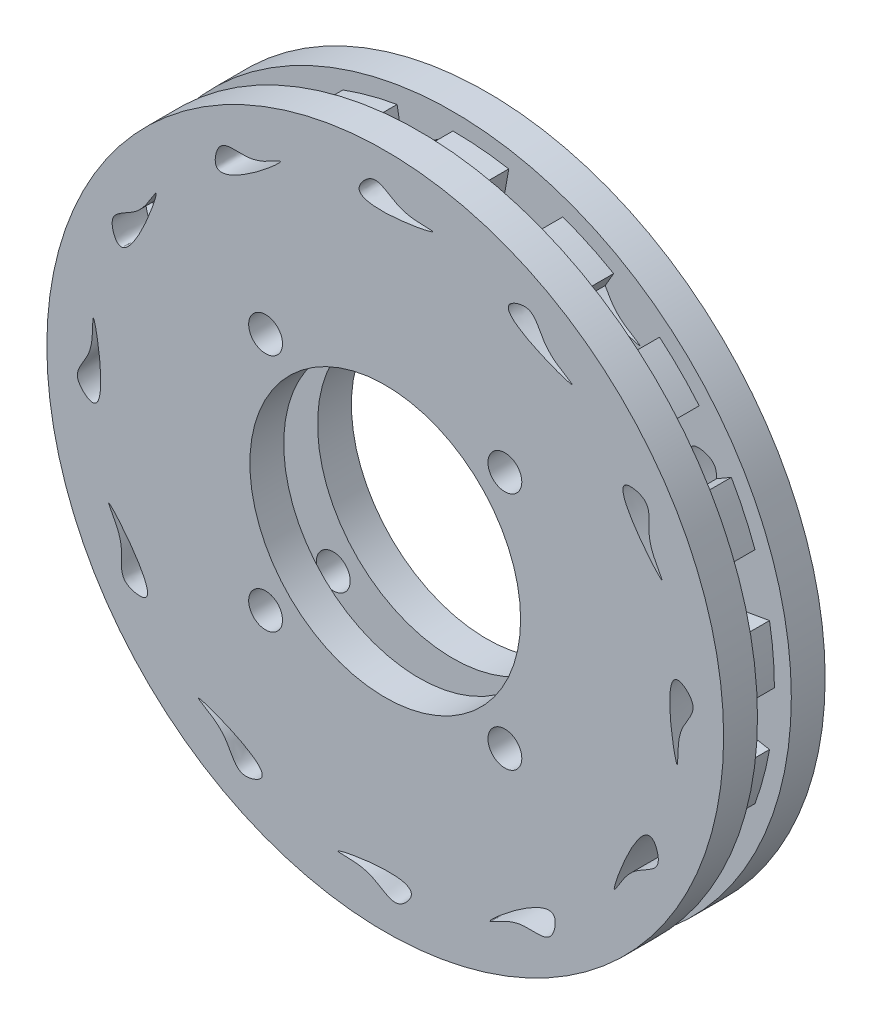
ISO-10303-21;
HEADER;
FILE_DESCRIPTION(('STEP AP214'),'2;1');
FILE_NAME('part.step','',(''),(''),'','','');
FILE_SCHEMA(('AUTOMOTIVE_DESIGN { 1 0 10303 214 1 1 1 1 }'));
ENDSEC;
DATA;
#1=APPLICATION_CONTEXT('core data for automotive mechanical design processes');
#2=APPLICATION_PROTOCOL_DEFINITION('international standard','automotive_design',2000,#1);
#3=PRODUCT_CONTEXT('',#1,'mechanical');
#4=PRODUCT('Part','Part','',(#3));
#5=PRODUCT_RELATED_PRODUCT_CATEGORY('part','',(#4));
#6=PRODUCT_DEFINITION_FORMATION('','',#4);
#7=PRODUCT_DEFINITION_CONTEXT('part definition',#1,'design');
#8=PRODUCT_DEFINITION('design','',#6,#7);
#9=PRODUCT_DEFINITION_SHAPE('','',#8);
#10=(LENGTH_UNIT() NAMED_UNIT(*) SI_UNIT(.MILLI.,.METRE.));
#11=(NAMED_UNIT(*) PLANE_ANGLE_UNIT() SI_UNIT($,.RADIAN.));
#12=(NAMED_UNIT(*) SI_UNIT($,.STERADIAN.) SOLID_ANGLE_UNIT());
#13=UNCERTAINTY_MEASURE_WITH_UNIT(LENGTH_MEASURE(1.E-05),#10,'distance_accuracy_value','');
#14=(GEOMETRIC_REPRESENTATION_CONTEXT(3) GLOBAL_UNCERTAINTY_ASSIGNED_CONTEXT((#13)) GLOBAL_UNIT_ASSIGNED_CONTEXT((#10,
#11,#12)) REPRESENTATION_CONTEXT('',''));
#15=CARTESIAN_POINT('',(0.,0.,0.));
#16=DIRECTION('',(0.,0.,1.));
#17=DIRECTION('',(1.,0.,0.));
#18=AXIS2_PLACEMENT_3D('',#15,#16,#17);
#19=CARTESIAN_POINT('',(30.0000000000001,51.9615242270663,20.));
#20=DIRECTION('',(-0.866025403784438,0.500000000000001,0.));
#21=DIRECTION('',(-0.500000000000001,-0.866025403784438,0.));
#22=AXIS2_PLACEMENT_3D('',#19,#20,#21);
#23=PLANE('',#22);
#24=DIRECTION('',(0.500000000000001,0.866025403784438,0.));
#25=VECTOR('',#24,1.);
#26=CARTESIAN_POINT('',(30.0000000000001,51.9615242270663,10.));
#27=LINE('',#26,#25);
#28=CARTESIAN_POINT('',(30.0000000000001,51.9615242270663,10.));
#29=VERTEX_POINT('',#28);
#30=CARTESIAN_POINT('',(42.0388314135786,72.8133918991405,10.));
#31=VERTEX_POINT('',#30);
#32=EDGE_CURVE('E959',#29,#31,#27,.T.);
#33=ORIENTED_EDGE('',*,*,#32,.T.);
#34=DIRECTION('',(0.,0.,-1.));
#35=VECTOR('',#34,1.);
#36=CARTESIAN_POINT('',(42.0388314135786,72.8133918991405,30.));
#37=LINE('',#36,#35);
#38=CARTESIAN_POINT('',(42.0388314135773,72.8133918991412,20.));
#39=VERTEX_POINT('',#38);
#40=EDGE_CURVE('E946',#31,#39,#37,.F.);
#41=ORIENTED_EDGE('',*,*,#40,.T.);
#42=DIRECTION('',(0.500000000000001,0.866025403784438,0.));
#43=VECTOR('',#42,1.);
#44=CARTESIAN_POINT('',(30.0000000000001,51.9615242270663,20.));
#45=LINE('',#44,#43);
#46=CARTESIAN_POINT('',(30.0000000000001,51.9615242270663,20.));
#47=VERTEX_POINT('',#46);
#48=EDGE_CURVE('E956',#47,#39,#45,.T.);
#49=ORIENTED_EDGE('',*,*,#48,.F.);
#50=DIRECTION('',(0.,0.,-1.));
#51=VECTOR('',#50,1.);
#52=CARTESIAN_POINT('',(30.0000000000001,51.9615242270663,20.));
#53=LINE('',#52,#51);
#54=EDGE_CURVE('E971',#47,#29,#53,.T.);
#55=ORIENTED_EDGE('',*,*,#54,.T.);
#56=EDGE_LOOP('',(#33,#41,#49,#55));
#57=FACE_BOUND('',#56,.T.);
#58=ADVANCED_FACE('F350',(#57),#23,.F.);
#59=CARTESIAN_POINT('',(51.9615242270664,29.9999999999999,20.));
#60=DIRECTION('',(0.499999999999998,-0.86602540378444,0.));
#61=DIRECTION('',(0.86602540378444,0.499999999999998,0.));
#62=AXIS2_PLACEMENT_3D('',#59,#60,#61);
#63=PLANE('',#62);
#64=DIRECTION('',(-0.86602540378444,-0.499999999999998,0.));
#65=VECTOR('',#64,1.);
#66=CARTESIAN_POINT('',(51.9615242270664,29.9999999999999,20.));
#67=LINE('',#66,#65);
#68=CARTESIAN_POINT('',(72.8133918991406,42.0388314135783,20.));
#69=VERTEX_POINT('',#68);
#70=CARTESIAN_POINT('',(51.9615242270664,29.9999999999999,20.));
#71=VERTEX_POINT('',#70);
#72=EDGE_CURVE('E1574',#69,#71,#67,.T.);
#73=ORIENTED_EDGE('',*,*,#72,.F.);
#74=DIRECTION('',(0.,0.,-1.));
#75=VECTOR('',#74,1.);
#76=CARTESIAN_POINT('',(72.8133918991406,42.0388314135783,30.));
#77=LINE('',#76,#75);
#78=CARTESIAN_POINT('',(72.8133918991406,42.0388314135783,10.));
#79=VERTEX_POINT('',#78);
#80=EDGE_CURVE('E375',#69,#79,#77,.T.);
#81=ORIENTED_EDGE('',*,*,#80,.T.);
#82=DIRECTION('',(-0.86602540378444,-0.499999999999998,0.));
#83=VECTOR('',#82,1.);
#84=CARTESIAN_POINT('',(51.9615242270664,29.9999999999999,10.));
#85=LINE('',#84,#83);
#86=CARTESIAN_POINT('',(51.9615242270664,29.9999999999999,10.));
#87=VERTEX_POINT('',#86);
#88=EDGE_CURVE('E1562',#79,#87,#85,.T.);
#89=ORIENTED_EDGE('',*,*,#88,.T.);
#90=DIRECTION('',(0.,0.,-1.));
#91=VECTOR('',#90,1.);
#92=CARTESIAN_POINT('',(51.9615242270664,29.9999999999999,20.));
#93=LINE('',#92,#91);
#94=EDGE_CURVE('E1589',#71,#87,#93,.T.);
#95=ORIENTED_EDGE('',*,*,#94,.F.);
#96=EDGE_LOOP('',(#73,#81,#89,#95));
#97=FACE_BOUND('',#96,.T.);
#98=ADVANCED_FACE('F2131',(#97),#63,.F.);
#99=CARTESIAN_POINT('',(60.,-2.04697370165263E-13,20.));
#100=DIRECTION('',(0.,1.,0.));
#101=DIRECTION('',(-1.,0.,0.));
#102=AXIS2_PLACEMENT_3D('',#99,#100,#101);
#103=PLANE('',#102);
#104=DIRECTION('',(1.,0.,0.));
#105=VECTOR('',#104,1.);
#106=CARTESIAN_POINT('',(60.,-2.04697370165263E-13,10.));
#107=LINE('',#106,#105);
#108=CARTESIAN_POINT('',(60.,-2.04697370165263E-13,10.));
#109=VERTEX_POINT('',#108);
#110=CARTESIAN_POINT('',(84.0776628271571,-2.85362011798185E-13,10.));
#111=VERTEX_POINT('',#110);
#112=EDGE_CURVE('E1533',#109,#111,#107,.T.);
#113=ORIENTED_EDGE('',*,*,#112,.T.);
#114=DIRECTION('',(0.,0.,-1.));
#115=VECTOR('',#114,1.);
#116=CARTESIAN_POINT('',(84.0776628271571,-2.85362011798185E-13,30.));
#117=LINE('',#116,#115);
#118=CARTESIAN_POINT('',(84.077662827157,1.15749423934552E-12,20.));
#119=VERTEX_POINT('',#118);
#120=EDGE_CURVE('E1723',#111,#119,#117,.F.);
#121=ORIENTED_EDGE('',*,*,#120,.T.);
#122=DIRECTION('',(1.,0.,0.));
#123=VECTOR('',#122,1.);
#124=CARTESIAN_POINT('',(60.,-2.04697370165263E-13,20.));
#125=LINE('',#124,#123);
#126=CARTESIAN_POINT('',(60.,-2.1316282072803E-13,20.));
#127=VERTEX_POINT('',#126);
#128=EDGE_CURVE('E1546',#127,#119,#125,.T.);
#129=ORIENTED_EDGE('',*,*,#128,.F.);
#130=DIRECTION('',(0.,0.,-1.));
#131=VECTOR('',#130,1.);
#132=CARTESIAN_POINT('',(60.,-2.1316282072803E-13,20.));
#133=LINE('',#132,#131);
#134=EDGE_CURVE('E1552',#127,#109,#133,.T.);
#135=ORIENTED_EDGE('',*,*,#134,.T.);
#136=EDGE_LOOP('',(#113,#121,#129,#135));
#137=FACE_BOUND('',#136,.T.);
#138=ADVANCED_FACE('F2138',(#137),#103,.F.);
#139=CARTESIAN_POINT('',(51.9615242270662,-30.0000000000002,20.));
#140=DIRECTION('',(-0.499999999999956,-0.866025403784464,0.));
#141=DIRECTION('',(0.866025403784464,-0.499999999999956,0.));
#142=AXIS2_PLACEMENT_3D('',#139,#140,#141);
#143=PLANE('',#142);
#144=DIRECTION('',(-0.866025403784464,0.499999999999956,0.));
#145=VECTOR('',#144,1.);
#146=CARTESIAN_POINT('',(51.9615242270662,-30.0000000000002,20.));
#147=LINE('',#146,#145);
#148=CARTESIAN_POINT('',(72.813391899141,-42.0388314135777,20.));
#149=VERTEX_POINT('',#148);
#150=CARTESIAN_POINT('',(51.9615242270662,-30.0000000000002,20.));
#151=VERTEX_POINT('',#150);
#152=EDGE_CURVE('E1472',#149,#151,#147,.T.);
#153=ORIENTED_EDGE('',*,*,#152,.F.);
#154=DIRECTION('',(0.,0.,-1.));
#155=VECTOR('',#154,1.);
#156=CARTESIAN_POINT('',(72.813391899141,-42.0388314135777,30.));
#157=LINE('',#156,#155);
#158=CARTESIAN_POINT('',(72.813391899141,-42.0388314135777,10.));
#159=VERTEX_POINT('',#158);
#160=EDGE_CURVE('E1760',#149,#159,#157,.T.);
#161=ORIENTED_EDGE('',*,*,#160,.T.);
#162=DIRECTION('',(-0.866025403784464,0.499999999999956,0.));
#163=VECTOR('',#162,1.);
#164=CARTESIAN_POINT('',(51.9615242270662,-30.0000000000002,10.));
#165=LINE('',#164,#163);
#166=CARTESIAN_POINT('',(51.9615242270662,-30.0000000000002,10.));
#167=VERTEX_POINT('',#166);
#168=EDGE_CURVE('E1460',#159,#167,#165,.T.);
#169=ORIENTED_EDGE('',*,*,#168,.T.);
#170=DIRECTION('',(0.,0.,-1.));
#171=VECTOR('',#170,1.);
#172=CARTESIAN_POINT('',(51.9615242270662,-30.0000000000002,20.));
#173=LINE('',#172,#171);
#174=EDGE_CURVE('E1487',#151,#167,#173,.T.);
#175=ORIENTED_EDGE('',*,*,#174,.F.);
#176=EDGE_LOOP('',(#153,#161,#169,#175));
#177=FACE_BOUND('',#176,.T.);
#178=ADVANCED_FACE('F2429',(#177),#143,.F.);
#179=CARTESIAN_POINT('',(30.000000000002,-51.9615242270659,20.));
#180=DIRECTION('',(0.866025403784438,0.5,0.));
#181=DIRECTION('',(-0.5,0.866025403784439,0.));
#182=AXIS2_PLACEMENT_3D('',#179,#180,#181);
#183=PLANE('',#182);
#184=DIRECTION('',(0.5,-0.866025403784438,0.));
#185=VECTOR('',#184,1.);
#186=CARTESIAN_POINT('',(30.000000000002,-51.9615242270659,10.));
#187=LINE('',#186,#185);
#188=CARTESIAN_POINT('',(30.000000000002,-51.961524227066,10.));
#189=VERTEX_POINT('',#188);
#190=CARTESIAN_POINT('',(42.0388314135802,-72.8133918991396,10.));
#191=VERTEX_POINT('',#190);
#192=EDGE_CURVE('E1431',#189,#191,#187,.T.);
#193=ORIENTED_EDGE('',*,*,#192,.T.);
#194=DIRECTION('',(0.,0.,-1.));
#195=VECTOR('',#194,1.);
#196=CARTESIAN_POINT('',(42.0388314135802,-72.8133918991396,30.));
#197=LINE('',#196,#195);
#198=CARTESIAN_POINT('',(42.0388314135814,-72.8133918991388,20.));
#199=VERTEX_POINT('',#198);
#200=EDGE_CURVE('E3112',#191,#199,#197,.F.);
#201=ORIENTED_EDGE('',*,*,#200,.T.);
#202=DIRECTION('',(0.5,-0.866025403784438,0.));
#203=VECTOR('',#202,1.);
#204=CARTESIAN_POINT('',(30.000000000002,-51.9615242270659,20.));
#205=LINE('',#204,#203);
#206=CARTESIAN_POINT('',(30.000000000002,-51.961524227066,20.));
#207=VERTEX_POINT('',#206);
#208=EDGE_CURVE('E1444',#207,#199,#205,.T.);
#209=ORIENTED_EDGE('',*,*,#208,.F.);
#210=DIRECTION('',(0.,0.,-1.));
#211=VECTOR('',#210,1.);
#212=CARTESIAN_POINT('',(30.000000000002,-51.961524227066,20.));
#213=LINE('',#212,#211);
#214=EDGE_CURVE('E1450',#207,#189,#213,.T.);
#215=ORIENTED_EDGE('',*,*,#214,.T.);
#216=EDGE_LOOP('',(#193,#201,#209,#215));
#217=FACE_BOUND('',#216,.T.);
#218=ADVANCED_FACE('F2478',(#217),#183,.F.);
#219=CARTESIAN_POINT('',(2.14689201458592E-12,-60.0000000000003,20.));
#220=DIRECTION('',(-1.,0.,0.));
#221=DIRECTION('',(0.,-1.,0.));
#222=AXIS2_PLACEMENT_3D('',#219,#220,#221);
#223=PLANE('',#222);
#224=DIRECTION('',(0.,1.,0.));
#225=VECTOR('',#224,1.);
#226=CARTESIAN_POINT('',(2.14689201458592E-12,-60.0000000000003,20.));
#227=LINE('',#226,#225);
#228=CARTESIAN_POINT('',(2.14031708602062E-12,-84.077662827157,20.));
#229=VERTEX_POINT('',#228);
#230=CARTESIAN_POINT('',(2.14689201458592E-12,-60.0000000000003,20.));
#231=VERTEX_POINT('',#230);
#232=EDGE_CURVE('E1370',#229,#231,#227,.T.);
#233=ORIENTED_EDGE('',*,*,#232,.F.);
#234=DIRECTION('',(0.,0.,-1.));
#235=VECTOR('',#234,1.);
#236=CARTESIAN_POINT('',(2.14021508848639E-12,-84.077662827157,30.));
#237=LINE('',#236,#235);
#238=CARTESIAN_POINT('',(2.14021508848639E-12,-84.077662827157,10.));
#239=VERTEX_POINT('',#238);
#240=EDGE_CURVE('E1828',#229,#239,#237,.T.);
#241=ORIENTED_EDGE('',*,*,#240,.T.);
#242=DIRECTION('',(0.,1.,0.));
#243=VECTOR('',#242,1.);
#244=CARTESIAN_POINT('',(2.14689201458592E-12,-60.0000000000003,10.));
#245=LINE('',#244,#243);
#246=CARTESIAN_POINT('',(2.14689201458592E-12,-60.0000000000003,10.));
#247=VERTEX_POINT('',#246);
#248=EDGE_CURVE('E1358',#239,#247,#245,.T.);
#249=ORIENTED_EDGE('',*,*,#248,.T.);
#250=DIRECTION('',(0.,0.,-1.));
#251=VECTOR('',#250,1.);
#252=CARTESIAN_POINT('',(2.14689201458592E-12,-60.0000000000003,20.));
#253=LINE('',#252,#251);
#254=EDGE_CURVE('E1385',#231,#247,#253,.T.);
#255=ORIENTED_EDGE('',*,*,#254,.F.);
#256=EDGE_LOOP('',(#233,#241,#249,#255));
#257=FACE_BOUND('',#256,.T.);
#258=ADVANCED_FACE('F2527',(#257),#223,.F.);
#259=CARTESIAN_POINT('',(-29.999999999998,-51.9615242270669,20.));
#260=DIRECTION('',(0.866025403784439,-0.5,0.));
#261=DIRECTION('',(0.5,0.866025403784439,0.));
#262=AXIS2_PLACEMENT_3D('',#259,#260,#261);
#263=PLANE('',#262);
#264=DIRECTION('',(-0.5,-0.866025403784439,0.));
#265=VECTOR('',#264,1.);
#266=CARTESIAN_POINT('',(-29.999999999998,-51.9615242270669,10.));
#267=LINE('',#266,#265);
#268=CARTESIAN_POINT('',(-29.9999999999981,-51.9615242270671,10.));
#269=VERTEX_POINT('',#268);
#270=CARTESIAN_POINT('',(-42.0388314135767,-72.8133918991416,10.));
#271=VERTEX_POINT('',#270);
#272=EDGE_CURVE('E1329',#269,#271,#267,.T.);
#273=ORIENTED_EDGE('',*,*,#272,.T.);
#274=DIRECTION('',(0.,0.,-1.));
#275=VECTOR('',#274,1.);
#276=CARTESIAN_POINT('',(-42.0388314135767,-72.8133918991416,30.));
#277=LINE('',#276,#275);
#278=CARTESIAN_POINT('',(-42.0388314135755,-72.8133918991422,20.));
#279=VERTEX_POINT('',#278);
#280=EDGE_CURVE('E1865',#271,#279,#277,.F.);
#281=ORIENTED_EDGE('',*,*,#280,.T.);
#282=DIRECTION('',(-0.5,-0.866025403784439,0.));
#283=VECTOR('',#282,1.);
#284=CARTESIAN_POINT('',(-29.999999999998,-51.9615242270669,20.));
#285=LINE('',#284,#283);
#286=CARTESIAN_POINT('',(-29.9999999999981,-51.9615242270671,20.));
#287=VERTEX_POINT('',#286);
#288=EDGE_CURVE('E1342',#287,#279,#285,.T.);
#289=ORIENTED_EDGE('',*,*,#288,.F.);
#290=DIRECTION('',(0.,0.,-1.));
#291=VECTOR('',#290,1.);
#292=CARTESIAN_POINT('',(-29.9999999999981,-51.9615242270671,20.));
#293=LINE('',#292,#291);
#294=EDGE_CURVE('E1348',#287,#269,#293,.T.);
#295=ORIENTED_EDGE('',*,*,#294,.T.);
#296=EDGE_LOOP('',(#273,#281,#289,#295));
#297=FACE_BOUND('',#296,.T.);
#298=ADVANCED_FACE('F2576',(#297),#263,.F.);
#299=CARTESIAN_POINT('',(-51.9615242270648,-30.0000000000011,20.));
#300=DIRECTION('',(-0.5,0.866025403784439,0.));
#301=DIRECTION('',(-0.866025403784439,-0.5,0.));
#302=AXIS2_PLACEMENT_3D('',#299,#300,#301);
#303=PLANE('',#302);
#304=DIRECTION('',(0.866025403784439,0.5,0.));
#305=VECTOR('',#304,1.);
#306=CARTESIAN_POINT('',(-51.9615242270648,-30.0000000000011,20.));
#307=LINE('',#306,#305);
#308=CARTESIAN_POINT('',(-72.8133918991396,-42.03883141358,20.));
#309=VERTEX_POINT('',#308);
#310=CARTESIAN_POINT('',(-51.9615242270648,-30.0000000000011,20.));
#311=VERTEX_POINT('',#310);
#312=EDGE_CURVE('E1268',#309,#311,#307,.T.);
#313=ORIENTED_EDGE('',*,*,#312,.F.);
#314=DIRECTION('',(0.,0.,-1.));
#315=VECTOR('',#314,1.);
#316=CARTESIAN_POINT('',(-72.8133918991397,-42.03883141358,30.));
#317=LINE('',#316,#315);
#318=CARTESIAN_POINT('',(-72.8133918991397,-42.03883141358,10.));
#319=VERTEX_POINT('',#318);
#320=EDGE_CURVE('E3041',#309,#319,#317,.T.);
#321=ORIENTED_EDGE('',*,*,#320,.T.);
#322=DIRECTION('',(0.866025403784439,0.5,0.));
#323=VECTOR('',#322,1.);
#324=CARTESIAN_POINT('',(-51.9615242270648,-30.0000000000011,10.));
#325=LINE('',#324,#323);
#326=CARTESIAN_POINT('',(-51.9615242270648,-30.0000000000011,10.));
#327=VERTEX_POINT('',#326);
#328=EDGE_CURVE('E1256',#319,#327,#325,.T.);
#329=ORIENTED_EDGE('',*,*,#328,.T.);
#330=DIRECTION('',(0.,0.,-1.));
#331=VECTOR('',#330,1.);
#332=CARTESIAN_POINT('',(-51.9615242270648,-30.0000000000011,20.));
#333=LINE('',#332,#331);
#334=EDGE_CURVE('E1283',#311,#327,#333,.T.);
#335=ORIENTED_EDGE('',*,*,#334,.F.);
#336=EDGE_LOOP('',(#313,#321,#329,#335));
#337=FACE_BOUND('',#336,.T.);
#338=ADVANCED_FACE('F2625',(#337),#303,.F.);
#339=CARTESIAN_POINT('',(-59.9999999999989,-1.18587517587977E-12,20.));
#340=DIRECTION('',(0.,-1.,0.));
#341=DIRECTION('',(1.,0.,0.));
#342=AXIS2_PLACEMENT_3D('',#339,#340,#341);
#343=PLANE('',#342);
#344=DIRECTION('',(-1.,0.,0.));
#345=VECTOR('',#344,1.);
#346=CARTESIAN_POINT('',(-59.9999999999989,-1.18587517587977E-12,10.));
#347=LINE('',#346,#345);
#348=CARTESIAN_POINT('',(-59.999999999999,-1.18587517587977E-12,10.));
#349=VERTEX_POINT('',#348);
#350=CARTESIAN_POINT('',(-84.077662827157,-1.18828558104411E-12,10.));
#351=VERTEX_POINT('',#350);
#352=EDGE_CURVE('E1227',#349,#351,#347,.T.);
#353=ORIENTED_EDGE('',*,*,#352,.T.);
#354=DIRECTION('',(0.,0.,-1.));
#355=VECTOR('',#354,1.);
#356=CARTESIAN_POINT('',(-84.077662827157,-1.18828558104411E-12,30.));
#357=LINE('',#356,#355);
#358=CARTESIAN_POINT('',(-84.077662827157,-2.61119251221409E-12,20.));
#359=VERTEX_POINT('',#358);
#360=EDGE_CURVE('E1933',#351,#359,#357,.F.);
#361=ORIENTED_EDGE('',*,*,#360,.T.);
#362=DIRECTION('',(-1.,0.,0.));
#363=VECTOR('',#362,1.);
#364=CARTESIAN_POINT('',(-59.9999999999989,-1.18587517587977E-12,20.));
#365=LINE('',#364,#363);
#366=CARTESIAN_POINT('',(-59.999999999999,-1.16504787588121E-12,20.));
#367=VERTEX_POINT('',#366);
#368=EDGE_CURVE('E1240',#367,#359,#365,.T.);
#369=ORIENTED_EDGE('',*,*,#368,.F.);
#370=DIRECTION('',(0.,0.,-1.));
#371=VECTOR('',#370,1.);
#372=CARTESIAN_POINT('',(-59.999999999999,-1.16504787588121E-12,20.));
#373=LINE('',#372,#371);
#374=EDGE_CURVE('E1246',#367,#349,#373,.T.);
#375=ORIENTED_EDGE('',*,*,#374,.T.);
#376=EDGE_LOOP('',(#353,#361,#369,#375));
#377=FACE_BOUND('',#376,.T.);
#378=ADVANCED_FACE('F2674',(#377),#343,.F.);
#379=CARTESIAN_POINT('',(-51.961524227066,30.0000000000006,20.));
#380=DIRECTION('',(0.50000000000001,0.866025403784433,0.));
#381=DIRECTION('',(-0.866025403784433,0.50000000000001,0.));
#382=AXIS2_PLACEMENT_3D('',#379,#380,#381);
#383=PLANE('',#382);
#384=DIRECTION('',(0.866025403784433,-0.50000000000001,0.));
#385=VECTOR('',#384,1.);
#386=CARTESIAN_POINT('',(-51.961524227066,30.0000000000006,20.));
#387=LINE('',#386,#385);
#388=CARTESIAN_POINT('',(-72.8133918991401,42.0388314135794,20.));
#389=VERTEX_POINT('',#388);
#390=CARTESIAN_POINT('',(-51.961524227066,30.0000000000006,20.));
#391=VERTEX_POINT('',#390);
#392=EDGE_CURVE('E1166',#389,#391,#387,.T.);
#393=ORIENTED_EDGE('',*,*,#392,.F.);
#394=DIRECTION('',(0.,0.,-1.));
#395=VECTOR('',#394,1.);
#396=CARTESIAN_POINT('',(-72.8133918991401,42.0388314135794,30.));
#397=LINE('',#396,#395);
#398=CARTESIAN_POINT('',(-72.8133918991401,42.0388314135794,10.));
#399=VERTEX_POINT('',#398);
#400=EDGE_CURVE('E1970',#389,#399,#397,.T.);
#401=ORIENTED_EDGE('',*,*,#400,.T.);
#402=DIRECTION('',(0.866025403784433,-0.50000000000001,0.));
#403=VECTOR('',#402,1.);
#404=CARTESIAN_POINT('',(-51.961524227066,30.0000000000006,10.));
#405=LINE('',#404,#403);
#406=CARTESIAN_POINT('',(-51.961524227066,30.0000000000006,10.));
#407=VERTEX_POINT('',#406);
#408=EDGE_CURVE('E1154',#399,#407,#405,.T.);
#409=ORIENTED_EDGE('',*,*,#408,.T.);
#410=DIRECTION('',(0.,0.,-1.));
#411=VECTOR('',#410,1.);
#412=CARTESIAN_POINT('',(-51.961524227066,30.0000000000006,20.));
#413=LINE('',#412,#411);
#414=EDGE_CURVE('E1181',#391,#407,#413,.T.);
#415=ORIENTED_EDGE('',*,*,#414,.F.);
#416=EDGE_LOOP('',(#393,#401,#409,#415));
#417=FACE_BOUND('',#416,.T.);
#418=ADVANCED_FACE('F2239',(#417),#383,.F.);
#419=CARTESIAN_POINT('',(-29.9999999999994,51.9615242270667,20.));
#420=DIRECTION('',(-0.866025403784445,-0.499999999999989,0.));
#421=DIRECTION('',(0.499999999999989,-0.866025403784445,0.));
#422=AXIS2_PLACEMENT_3D('',#419,#420,#421);
#423=PLANE('',#422);
#424=DIRECTION('',(-0.499999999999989,0.866025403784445,0.));
#425=VECTOR('',#424,1.);
#426=CARTESIAN_POINT('',(-29.9999999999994,51.9615242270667,10.));
#427=LINE('',#426,#425);
#428=CARTESIAN_POINT('',(-29.9999999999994,51.9615242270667,10.));
#429=VERTEX_POINT('',#428);
#430=CARTESIAN_POINT('',(-42.0388314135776,72.8133918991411,10.));
#431=VERTEX_POINT('',#430);
#432=EDGE_CURVE('E1125',#429,#431,#427,.T.);
#433=ORIENTED_EDGE('',*,*,#432,.T.);
#434=DIRECTION('',(0.,0.,-1.));
#435=VECTOR('',#434,1.);
#436=CARTESIAN_POINT('',(-42.0388314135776,72.8133918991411,30.));
#437=LINE('',#436,#435);
#438=CARTESIAN_POINT('',(-42.0388314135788,72.8133918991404,20.));
#439=VERTEX_POINT('',#438);
#440=EDGE_CURVE('E3012',#431,#439,#437,.F.);
#441=ORIENTED_EDGE('',*,*,#440,.T.);
#442=DIRECTION('',(-0.499999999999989,0.866025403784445,0.));
#443=VECTOR('',#442,1.);
#444=CARTESIAN_POINT('',(-29.9999999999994,51.9615242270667,20.));
#445=LINE('',#444,#443);
#446=CARTESIAN_POINT('',(-29.9999999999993,51.9615242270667,20.));
#447=VERTEX_POINT('',#446);
#448=EDGE_CURVE('E1138',#447,#439,#445,.T.);
#449=ORIENTED_EDGE('',*,*,#448,.F.);
#450=DIRECTION('',(0.,0.,-1.));
#451=VECTOR('',#450,1.);
#452=CARTESIAN_POINT('',(-29.9999999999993,51.9615242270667,20.));
#453=LINE('',#452,#451);
#454=EDGE_CURVE('E1144',#447,#429,#453,.T.);
#455=ORIENTED_EDGE('',*,*,#454,.T.);
#456=EDGE_LOOP('',(#433,#441,#449,#455));
#457=FACE_BOUND('',#456,.T.);
#458=ADVANCED_FACE('F2235',(#457),#423,.F.);
#459=CARTESIAN_POINT('',(0.,60.,20.));
#460=DIRECTION('',(1.,0.,0.));
#461=DIRECTION('',(0.,0.,-1.));
#462=AXIS2_PLACEMENT_3D('',#459,#460,#461);
#463=PLANE('',#462);
#464=DIRECTION('',(0.,-1.,0.));
#465=VECTOR('',#464,1.);
#466=CARTESIAN_POINT('',(0.,60.,20.));
#467=LINE('',#466,#465);
#468=CARTESIAN_POINT('',(0.,84.077662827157,20.));
#469=VERTEX_POINT('',#468);
#470=CARTESIAN_POINT('',(0.,60.,20.));
#471=VERTEX_POINT('',#470);
#472=EDGE_CURVE('E997',#469,#471,#467,.T.);
#473=ORIENTED_EDGE('',*,*,#472,.F.);
#474=DIRECTION('',(0.,0.,-1.));
#475=VECTOR('',#474,1.);
#476=CARTESIAN_POINT('',(0.,84.077662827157,30.));
#477=LINE('',#476,#475);
#478=CARTESIAN_POINT('',(0.,84.077662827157,10.));
#479=VERTEX_POINT('',#478);
#480=EDGE_CURVE('E2037',#469,#479,#477,.T.);
#481=ORIENTED_EDGE('',*,*,#480,.T.);
#482=DIRECTION('',(0.,-1.,0.));
#483=VECTOR('',#482,1.);
#484=CARTESIAN_POINT('',(0.,60.,10.));
#485=LINE('',#484,#483);
#486=CARTESIAN_POINT('',(0.,60.,10.));
#487=VERTEX_POINT('',#486);
#488=EDGE_CURVE('E985',#479,#487,#485,.T.);
#489=ORIENTED_EDGE('',*,*,#488,.T.);
#490=DIRECTION('',(0.,0.,-1.));
#491=VECTOR('',#490,1.);
#492=CARTESIAN_POINT('',(0.,60.,20.));
#493=LINE('',#492,#491);
#494=EDGE_CURVE('E1012',#471,#487,#493,.T.);
#495=ORIENTED_EDGE('',*,*,#494,.F.);
#496=EDGE_LOOP('',(#473,#481,#489,#495));
#497=FACE_BOUND('',#496,.T.);
#498=ADVANCED_FACE('F2114',(#497),#463,.F.);
#499=CARTESIAN_POINT('',(0.,0.,10.));
#500=DIRECTION('',(0.,0.,1.));
#501=DIRECTION('',(1.,0.,0.));
#502=AXIS2_PLACEMENT_3D('',#499,#500,#501);
#503=PLANE('',#502);
#504=CARTESIAN_POINT('',(48.2234495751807,72.9455360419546,10.));
#505=CARTESIAN_POINT('',(50.685966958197,70.2264104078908,10.));
#506=CARTESIAN_POINT('',(65.3488284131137,63.3542076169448,10.));
#507=CARTESIAN_POINT('',(27.6824499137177,76.6361774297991,10.));
#508=CARTESIAN_POINT('',(44.6018612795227,82.4406130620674,10.));
#509=CARTESIAN_POINT('',(45.3423016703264,76.1269158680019,10.));
#510=CARTESIAN_POINT('',(48.2234495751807,72.9455360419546,10.));
#511=B_SPLINE_CURVE_WITH_KNOTS('',3,(#504,#505,#506,#507,#508,#509,#510),.UNSPECIFIED.,.T.,.F.,
(4,1,1,1,4),(0.,0.190756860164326,0.664849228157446,0.776814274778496,1.),.UNSPECIFIED.);
#512=CARTESIAN_POINT('',(45.0027877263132,77.9471148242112,10.));
#513=VERTEX_POINT('',#512);
#514=EDGE_CURVE('E960',#31,#513,#511,.F.);
#515=ORIENTED_EDGE('',*,*,#514,.F.);
#516=ORIENTED_EDGE('',*,*,#32,.F.);
#517=CARTESIAN_POINT('',(0.,0.,10.));
#518=DIRECTION('',(0.,0.,-1.));
#519=DIRECTION('',(1.,0.,0.));
#520=AXIS2_PLACEMENT_3D('',#517,#518,#519);
#521=CIRCLE('',#520,60.);
#522=CARTESIAN_POINT('',(20.5212085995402,56.3815572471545,10.));
#523=VERTEX_POINT('',#522);
#524=EDGE_CURVE('E1631',#523,#29,#521,.T.);
#525=ORIENTED_EDGE('',*,*,#524,.F.);
#526=DIRECTION('',(-0.342020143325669,-0.939692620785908,0.));
#527=VECTOR('',#526,1.);
#528=CARTESIAN_POINT('',(20.5212085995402,56.3815572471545,10.));
#529=LINE('',#528,#527);
#530=CARTESIAN_POINT('',(32.4919136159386,89.2707989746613,10.));
#531=VERTEX_POINT('',#530);
#532=EDGE_CURVE('E1629',#531,#523,#529,.T.);
#533=ORIENTED_EDGE('',*,*,#532,.F.);
#534=CARTESIAN_POINT('',(0.,0.,10.));
#535=DIRECTION('',(0.,0.,1.));
#536=DIRECTION('',(1.,0.,0.));
#537=AXIS2_PLACEMENT_3D('',#534,#535,#536);
#538=CIRCLE('',#537,95.);
#539=CARTESIAN_POINT('',(47.5000000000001,82.2724133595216,10.));
#540=VERTEX_POINT('',#539);
#541=EDGE_CURVE('E1626',#540,#531,#538,.T.);
#542=ORIENTED_EDGE('',*,*,#541,.F.);
#543=EDGE_CURVE('E1634',#513,#540,#27,.T.);
#544=ORIENTED_EDGE('',*,*,#543,.F.);
#545=EDGE_LOOP('',(#515,#516,#525,#533,#542,#544));
#546=FACE_BOUND('',#545,.T.);
#547=CARTESIAN_POINT('',(78.2355004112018,39.0609625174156,10.));
#548=CARTESIAN_POINT('',(79.0085402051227,35.4748719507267,10.));
#549=CARTESIAN_POINT('',(88.2708493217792,22.1919390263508,10.));
#550=CARTESIAN_POINT('',(62.2917935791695,52.5276515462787,10.));
#551=CARTESIAN_POINT('',(79.8466514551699,49.0947345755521,10.));
#552=CARTESIAN_POINT('',(77.3310430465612,43.256692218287,10.));
#553=CARTESIAN_POINT('',(78.2355004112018,39.0609625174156,10.));
#554=B_SPLINE_CURVE_WITH_KNOTS('',3,(#547,#548,#549,#550,#551,#552,#553),.UNSPECIFIED.,.T.,.F.,
(4,1,1,1,4),(0.,0.190756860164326,0.664849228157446,0.776814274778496,1.),.UNSPECIFIED.);
#555=CARTESIAN_POINT('',(77.9471148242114,45.0027877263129,10.));
#556=VERTEX_POINT('',#555);
#557=EDGE_CURVE('E3202',#556,#79,#554,.F.);
#558=ORIENTED_EDGE('',*,*,#557,.F.);
#559=CARTESIAN_POINT('',(82.2724133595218,47.4999999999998,10.));
#560=VERTEX_POINT('',#559);
#561=EDGE_CURVE('E1563',#560,#556,#85,.T.);
#562=ORIENTED_EDGE('',*,*,#561,.F.);
#563=CARTESIAN_POINT('',(0.,0.,10.));
#564=DIRECTION('',(0.,0.,1.));
#565=DIRECTION('',(1.,0.,0.));
#566=AXIS2_PLACEMENT_3D('',#563,#564,#565);
#567=CIRCLE('',#566,95.);
#568=CARTESIAN_POINT('',(89.2707989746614,32.4919136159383,10.));
#569=VERTEX_POINT('',#568);
#570=EDGE_CURVE('E1559',#569,#560,#567,.T.);
#571=ORIENTED_EDGE('',*,*,#570,.F.);
#572=DIRECTION('',(0.939692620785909,0.342020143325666,0.));
#573=VECTOR('',#572,1.);
#574=CARTESIAN_POINT('',(56.3815572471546,20.52120859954,10.));
#575=LINE('',#574,#573);
#576=CARTESIAN_POINT('',(56.3815572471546,20.52120859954,10.));
#577=VERTEX_POINT('',#576);
#578=EDGE_CURVE('E1569',#577,#569,#575,.T.);
#579=ORIENTED_EDGE('',*,*,#578,.F.);
#580=CARTESIAN_POINT('',(0.,0.,10.));
#581=DIRECTION('',(0.,0.,-1.));
#582=DIRECTION('',(1.,0.,0.));
#583=AXIS2_PLACEMENT_3D('',#580,#581,#582);
#584=CIRCLE('',#583,60.);
#585=EDGE_CURVE('E1566',#87,#577,#584,.T.);
#586=ORIENTED_EDGE('',*,*,#585,.F.);
#587=ORIENTED_EDGE('',*,*,#88,.F.);
#588=EDGE_LOOP('',(#558,#562,#571,#579,#586,#587));
#589=FACE_BOUND('',#588,.T.);
#590=CARTESIAN_POINT('',(87.2844120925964,-5.28996436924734,10.));
#591=CARTESIAN_POINT('',(86.1608389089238,-8.78212979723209,10.));
#592=CARTESIAN_POINT('',(87.5407674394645,-24.9166417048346,10.));
#593=CARTESIAN_POINT('',(80.2101014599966,14.3443838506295,10.));
#594=CARTESIAN_POINT('',(93.6965958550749,2.59396160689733,10.));
#595=CARTESIAN_POINT('',(88.5989938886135,-1.20412717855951,10.));
#596=CARTESIAN_POINT('',(87.2844120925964,-5.28996436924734,10.));
#597=B_SPLINE_CURVE_WITH_KNOTS('',3,(#590,#591,#592,#593,#594,#595,#596),.UNSPECIFIED.,.T.,.F.,
(4,1,1,1,4),(0.,0.190756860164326,0.664849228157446,0.776814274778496,1.),.UNSPECIFIED.);
#598=CARTESIAN_POINT('',(90.0055754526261,-3.03251347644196E-13,10.));
#599=VERTEX_POINT('',#598);
#600=EDGE_CURVE('E1726',#111,#599,#597,.F.);
#601=ORIENTED_EDGE('',*,*,#600,.F.);
#602=ORIENTED_EDGE('',*,*,#112,.F.);
#603=CARTESIAN_POINT('',(0.,0.,10.));
#604=DIRECTION('',(0.,0.,-1.));
#605=DIRECTION('',(1.,0.,0.));
#606=AXIS2_PLACEMENT_3D('',#603,#604,#605);
#607=CIRCLE('',#606,60.);
#608=CARTESIAN_POINT('',(59.0884651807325,10.4188906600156,10.));
#609=VERTEX_POINT('',#608);
#610=EDGE_CURVE('E1529',#609,#109,#607,.T.);
#611=ORIENTED_EDGE('',*,*,#610,.F.);
#612=DIRECTION('',(-0.984807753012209,-0.173648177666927,0.));
#613=VECTOR('',#612,1.);
#614=CARTESIAN_POINT('',(59.0884651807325,10.4188906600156,10.));
#615=LINE('',#614,#613);
#616=CARTESIAN_POINT('',(93.5567365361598,16.4965768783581,10.));
#617=VERTEX_POINT('',#616);
#618=EDGE_CURVE('E1527',#617,#609,#615,.T.);
#619=ORIENTED_EDGE('',*,*,#618,.F.);
#620=CARTESIAN_POINT('',(0.,0.,10.));
#621=DIRECTION('',(0.,0.,1.));
#622=DIRECTION('',(1.,0.,0.));
#623=AXIS2_PLACEMENT_3D('',#620,#621,#622);
#624=CIRCLE('',#623,95.);
#625=CARTESIAN_POINT('',(95.,-3.22658566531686E-13,10.));
#626=VERTEX_POINT('',#625);
#627=EDGE_CURVE('E1524',#626,#617,#624,.T.);
#628=ORIENTED_EDGE('',*,*,#627,.F.);
#629=EDGE_CURVE('E1532',#599,#626,#107,.T.);
#630=ORIENTED_EDGE('',*,*,#629,.F.);
#631=EDGE_LOOP('',(#601,#602,#611,#619,#628,#630));
#632=FACE_BOUND('',#631,.T.);
#633=CARTESIAN_POINT('',(72.9455360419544,-48.223449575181,10.));
#634=CARTESIAN_POINT('',(70.2264104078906,-50.6859669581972,10.));
#635=CARTESIAN_POINT('',(63.3542076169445,-65.3488284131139,10.));
#636=CARTESIAN_POINT('',(76.636177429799,-27.682449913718,10.));
#637=CARTESIAN_POINT('',(82.4406130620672,-44.601861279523,10.));
#638=CARTESIAN_POINT('',(76.1269158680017,-45.3423016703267,10.));
#639=CARTESIAN_POINT('',(72.9455360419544,-48.223449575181,10.));
#640=B_SPLINE_CURVE_WITH_KNOTS('',3,(#633,#634,#635,#636,#637,#638,#639),.UNSPECIFIED.,.T.,.F.,
(4,1,1,1,4),(0.,0.190756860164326,0.664849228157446,0.776814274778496,1.),.UNSPECIFIED.);
#641=CARTESIAN_POINT('',(77.9471148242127,-45.0027877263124,10.));
#642=VERTEX_POINT('',#641);
#643=EDGE_CURVE('E1763',#642,#159,#640,.F.);
#644=ORIENTED_EDGE('',*,*,#643,.F.);
#645=CARTESIAN_POINT('',(82.2724133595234,-47.4999999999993,10.));
#646=VERTEX_POINT('',#645);
#647=EDGE_CURVE('E1461',#646,#642,#165,.T.);
#648=ORIENTED_EDGE('',*,*,#647,.F.);
#649=CARTESIAN_POINT('',(0.,0.,10.));
#650=DIRECTION('',(0.,0.,1.));
#651=DIRECTION('',(1.,0.,0.));
#652=AXIS2_PLACEMENT_3D('',#649,#650,#651);
#653=CIRCLE('',#652,95.000000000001);
#654=CARTESIAN_POINT('',(72.7742220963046,-61.0648229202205,10.));
#655=VERTEX_POINT('',#654);
#656=EDGE_CURVE('E1457',#655,#646,#653,.T.);
#657=ORIENTED_EDGE('',*,*,#656,.F.);
#658=DIRECTION('',(0.766044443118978,-0.642787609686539,0.));
#659=VECTOR('',#658,1.);
#660=CARTESIAN_POINT('',(45.9626665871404,-38.5672565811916,10.));
#661=LINE('',#660,#659);
#662=CARTESIAN_POINT('',(45.9626665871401,-38.5672565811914,10.));
#663=VERTEX_POINT('',#662);
#664=EDGE_CURVE('E1467',#663,#655,#661,.T.);
#665=ORIENTED_EDGE('',*,*,#664,.F.);
#666=CARTESIAN_POINT('',(0.,0.,10.));
#667=DIRECTION('',(0.,0.,-1.));
#668=DIRECTION('',(1.,0.,0.));
#669=AXIS2_PLACEMENT_3D('',#666,#667,#668);
#670=CIRCLE('',#669,60.0000000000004);
#671=EDGE_CURVE('E1464',#167,#663,#670,.T.);
#672=ORIENTED_EDGE('',*,*,#671,.F.);
#673=ORIENTED_EDGE('',*,*,#168,.F.);
#674=EDGE_LOOP('',(#644,#648,#657,#665,#672,#673));
#675=FACE_BOUND('',#674,.T.);
#676=CARTESIAN_POINT('',(39.0609625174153,-78.2355004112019,10.));
#677=CARTESIAN_POINT('',(35.4748719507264,-79.0085402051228,10.));
#678=CARTESIAN_POINT('',(22.1919390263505,-88.2708493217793,10.));
#679=CARTESIAN_POINT('',(52.5276515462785,-62.2917935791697,10.));
#680=CARTESIAN_POINT('',(49.0947345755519,-79.8466514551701,10.));
#681=CARTESIAN_POINT('',(43.2566922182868,-77.3310430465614,10.));
#682=CARTESIAN_POINT('',(39.0609625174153,-78.2355004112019,10.));
#683=B_SPLINE_CURVE_WITH_KNOTS('',3,(#676,#677,#678,#679,#680,#681,#682),.UNSPECIFIED.,.T.,.F.,
(4,1,1,1,4),(0.,0.190756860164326,0.664849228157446,0.776814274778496,1.),.UNSPECIFIED.);
#684=CARTESIAN_POINT('',(45.0027877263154,-77.9471148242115,10.));
#685=VERTEX_POINT('',#684);
#686=EDGE_CURVE('E3111',#191,#685,#683,.F.);
#687=ORIENTED_EDGE('',*,*,#686,.F.);
#688=ORIENTED_EDGE('',*,*,#192,.F.);
#689=CARTESIAN_POINT('',(0.,0.,10.));
#690=DIRECTION('',(0.,0.,-1.));
#691=DIRECTION('',(1.,0.,0.));
#692=AXIS2_PLACEMENT_3D('',#689,#690,#691);
#693=CIRCLE('',#692,60.0000000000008);
#694=CARTESIAN_POINT('',(38.5672565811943,-45.9626665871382,10.));
#695=VERTEX_POINT('',#694);
#696=EDGE_CURVE('E1427',#695,#189,#693,.T.);
#697=ORIENTED_EDGE('',*,*,#696,.F.);
#698=DIRECTION('',(-0.642787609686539,0.766044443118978,0.));
#699=VECTOR('',#698,1.);
#700=CARTESIAN_POINT('',(38.5672565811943,-45.9626665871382,10.));
#701=LINE('',#700,#699);
#702=CARTESIAN_POINT('',(61.0648229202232,-72.7742220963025,10.));
#703=VERTEX_POINT('',#702);
#704=EDGE_CURVE('E1425',#703,#695,#701,.T.);
#705=ORIENTED_EDGE('',*,*,#704,.F.);
#706=CARTESIAN_POINT('',(0.,0.,10.));
#707=DIRECTION('',(0.,0.,1.));
#708=DIRECTION('',(1.,0.,0.));
#709=AXIS2_PLACEMENT_3D('',#706,#707,#708);
#710=CIRCLE('',#709,95.0000000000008);
#711=CARTESIAN_POINT('',(47.500000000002,-82.2724133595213,10.));
#712=VERTEX_POINT('',#711);
#713=EDGE_CURVE('E1422',#712,#703,#710,.T.);
#714=ORIENTED_EDGE('',*,*,#713,.F.);
#715=EDGE_CURVE('E1430',#685,#712,#187,.T.);
#716=ORIENTED_EDGE('',*,*,#715,.F.);
#717=EDGE_LOOP('',(#687,#688,#697,#705,#714,#716));
#718=FACE_BOUND('',#717,.T.);
#719=CARTESIAN_POINT('',(-5.28996436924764,-87.2844120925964,10.));
#720=CARTESIAN_POINT('',(-8.78212979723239,-86.1608389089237,10.));
#721=CARTESIAN_POINT('',(-24.9166417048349,-87.5407674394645,10.));
#722=CARTESIAN_POINT('',(14.3443838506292,-80.2101014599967,10.));
#723=CARTESIAN_POINT('',(2.593961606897,-93.6965958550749,10.));
#724=CARTESIAN_POINT('',(-1.20412717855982,-88.5989938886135,10.));
#725=CARTESIAN_POINT('',(-5.28996436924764,-87.2844120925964,10.));
#726=B_SPLINE_CURVE_WITH_KNOTS('',3,(#719,#720,#721,#722,#723,#724,#725),.UNSPECIFIED.,.T.,.F.,
(4,1,1,1,4),(0.,0.190756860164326,0.664849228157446,0.776814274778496,1.),.UNSPECIFIED.);
#727=CARTESIAN_POINT('',(2.14010666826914E-12,-90.0055754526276,10.));
#728=VERTEX_POINT('',#727);
#729=EDGE_CURVE('E1831',#728,#239,#726,.F.);
#730=ORIENTED_EDGE('',*,*,#729,.F.);
#731=CARTESIAN_POINT('',(2.13733450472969E-12,-95.0000000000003,10.));
#732=VERTEX_POINT('',#731);
#733=EDGE_CURVE('E1359',#732,#728,#245,.T.);
#734=ORIENTED_EDGE('',*,*,#733,.F.);
#735=CARTESIAN_POINT('',(2.12677098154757E-12,-2.4980018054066E-13,10.));
#736=DIRECTION('',(0.,0.,1.));
#737=DIRECTION('',(1.,0.,0.));
#738=AXIS2_PLACEMENT_3D('',#735,#736,#737);
#739=CIRCLE('',#738,95.);
#740=CARTESIAN_POINT('',(-16.4965768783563,-93.5567365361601,10.));
#741=VERTEX_POINT('',#740);
#742=EDGE_CURVE('E1355',#741,#732,#739,.T.);
#743=ORIENTED_EDGE('',*,*,#742,.F.);
#744=DIRECTION('',(-0.17364817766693,-0.984807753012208,0.));
#745=VECTOR('',#744,1.);
#746=CARTESIAN_POINT('',(-10.4188906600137,-59.0884651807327,10.));
#747=LINE('',#746,#745);
#748=CARTESIAN_POINT('',(-10.4188906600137,-59.0884651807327,10.));
#749=VERTEX_POINT('',#748);
#750=EDGE_CURVE('E1365',#749,#741,#747,.T.);
#751=ORIENTED_EDGE('',*,*,#750,.F.);
#752=CARTESIAN_POINT('',(2.12677098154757E-12,-2.4980018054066E-13,10.));
#753=DIRECTION('',(0.,0.,-1.));
#754=DIRECTION('',(1.,0.,0.));
#755=AXIS2_PLACEMENT_3D('',#752,#753,#754);
#756=CIRCLE('',#755,60.);
#757=EDGE_CURVE('E1362',#247,#749,#756,.T.);
#758=ORIENTED_EDGE('',*,*,#757,.F.);
#759=ORIENTED_EDGE('',*,*,#248,.F.);
#760=EDGE_LOOP('',(#730,#734,#743,#751,#758,#759));
#761=FACE_BOUND('',#760,.T.);
#762=CARTESIAN_POINT('',(-48.2234495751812,-72.9455360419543,10.));
#763=CARTESIAN_POINT('',(-50.6859669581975,-70.2264104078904,10.));
#764=CARTESIAN_POINT('',(-65.3488284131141,-63.3542076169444,10.));
#765=CARTESIAN_POINT('',(-27.6824499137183,-76.636177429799,10.));
#766=CARTESIAN_POINT('',(-44.6018612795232,-82.440613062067,10.));
#767=CARTESIAN_POINT('',(-45.3423016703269,-76.1269158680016,10.));
#768=CARTESIAN_POINT('',(-48.2234495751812,-72.9455360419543,10.));
#769=B_SPLINE_CURVE_WITH_KNOTS('',3,(#762,#763,#764,#765,#766,#767,#768),.UNSPECIFIED.,.T.,.F.,
(4,1,1,1,4),(0.,0.190756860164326,0.664849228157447,0.776814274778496,1.),.UNSPECIFIED.);
#770=CARTESIAN_POINT('',(-45.002787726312,-77.9471148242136,10.));
#771=VERTEX_POINT('',#770);
#772=EDGE_CURVE('E1868',#271,#771,#769,.F.);
#773=ORIENTED_EDGE('',*,*,#772,.F.);
#774=ORIENTED_EDGE('',*,*,#272,.F.);
#775=CARTESIAN_POINT('',(0.,0.,10.));
#776=DIRECTION('',(0.,0.,-1.));
#777=DIRECTION('',(1.,0.,0.));
#778=AXIS2_PLACEMENT_3D('',#775,#776,#777);
#779=CIRCLE('',#778,59.9999999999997);
#780=CARTESIAN_POINT('',(-20.5212085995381,-56.3815572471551,10.));
#781=VERTEX_POINT('',#780);
#782=EDGE_CURVE('E1325',#781,#269,#779,.T.);
#783=ORIENTED_EDGE('',*,*,#782,.F.);
#784=DIRECTION('',(0.342020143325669,0.939692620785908,0.));
#785=VECTOR('',#784,1.);
#786=CARTESIAN_POINT('',(-20.5212085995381,-56.3815572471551,10.));
#787=LINE('',#786,#785);
#788=CARTESIAN_POINT('',(-32.4919136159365,-89.2707989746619,10.));
#789=VERTEX_POINT('',#788);
#790=EDGE_CURVE('E1323',#789,#781,#787,.T.);
#791=ORIENTED_EDGE('',*,*,#790,.F.);
#792=CARTESIAN_POINT('',(0.,0.,10.));
#793=DIRECTION('',(0.,0.,1.));
#794=DIRECTION('',(1.,0.,0.));
#795=AXIS2_PLACEMENT_3D('',#792,#793,#794);
#796=CIRCLE('',#795,94.9999999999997);
#797=CARTESIAN_POINT('',(-47.499999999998,-82.2724133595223,10.));
#798=VERTEX_POINT('',#797);
#799=EDGE_CURVE('E1320',#798,#789,#796,.T.);
#800=ORIENTED_EDGE('',*,*,#799,.F.);
#801=EDGE_CURVE('E1328',#771,#798,#267,.T.);
#802=ORIENTED_EDGE('',*,*,#801,.F.);
#803=EDGE_LOOP('',(#773,#774,#783,#791,#800,#802));
#804=FACE_BOUND('',#803,.T.);
#805=CARTESIAN_POINT('',(-78.235500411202,-39.060962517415,10.));
#806=CARTESIAN_POINT('',(-79.008540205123,-35.4748719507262,10.));
#807=CARTESIAN_POINT('',(-88.2708493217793,-22.1919390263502,10.));
#808=CARTESIAN_POINT('',(-62.2917935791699,-52.5276515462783,10.));
#809=CARTESIAN_POINT('',(-79.8466514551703,-49.0947345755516,10.));
#810=CARTESIAN_POINT('',(-77.3310430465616,-43.2566922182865,10.));
#811=CARTESIAN_POINT('',(-78.235500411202,-39.060962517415,10.));
#812=B_SPLINE_CURVE_WITH_KNOTS('',3,(#805,#806,#807,#808,#809,#810,#811),.UNSPECIFIED.,.T.,.F.,
(4,1,1,1,4),(0.,0.190756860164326,0.664849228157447,0.776814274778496,1.),.UNSPECIFIED.);
#813=CARTESIAN_POINT('',(-77.9471148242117,-45.0027877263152,10.));
#814=VERTEX_POINT('',#813);
#815=EDGE_CURVE('E3040',#814,#319,#812,.F.);
#816=ORIENTED_EDGE('',*,*,#815,.F.);
#817=CARTESIAN_POINT('',(-82.2724133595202,-47.5000000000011,10.));
#818=VERTEX_POINT('',#817);
#819=EDGE_CURVE('E1257',#818,#814,#325,.T.);
#820=ORIENTED_EDGE('',*,*,#819,.F.);
#821=CARTESIAN_POINT('',(0.,0.,10.));
#822=DIRECTION('',(0.,0.,1.));
#823=DIRECTION('',(1.,0.,0.));
#824=AXIS2_PLACEMENT_3D('',#821,#822,#823);
#825=CIRCLE('',#824,94.9999999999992);
#826=CARTESIAN_POINT('',(-89.2707989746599,-32.4919136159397,10.));
#827=VERTEX_POINT('',#826);
#828=EDGE_CURVE('E1253',#827,#818,#825,.T.);
#829=ORIENTED_EDGE('',*,*,#828,.F.);
#830=DIRECTION('',(-0.939692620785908,-0.342020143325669,0.));
#831=VECTOR('',#830,1.);
#832=CARTESIAN_POINT('',(-56.381557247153,-20.5212085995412,10.));
#833=LINE('',#832,#831);
#834=CARTESIAN_POINT('',(-56.3815572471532,-20.5212085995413,10.));
#835=VERTEX_POINT('',#834);
#836=EDGE_CURVE('E1263',#835,#827,#833,.T.);
#837=ORIENTED_EDGE('',*,*,#836,.F.);
#838=CARTESIAN_POINT('',(0.,0.,10.));
#839=DIRECTION('',(0.,0.,-1.));
#840=DIRECTION('',(1.,0.,0.));
#841=AXIS2_PLACEMENT_3D('',#838,#839,#840);
#842=CIRCLE('',#841,59.9999999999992);
#843=EDGE_CURVE('E1260',#327,#835,#842,.T.);
#844=ORIENTED_EDGE('',*,*,#843,.F.);
#845=ORIENTED_EDGE('',*,*,#328,.F.);
#846=EDGE_LOOP('',(#816,#820,#829,#837,#844,#845));
#847=FACE_BOUND('',#846,.T.);
#848=CARTESIAN_POINT('',(-87.2844120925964,5.28996436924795,10.));
#849=CARTESIAN_POINT('',(-86.1608389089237,8.78212979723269,10.));
#850=CARTESIAN_POINT('',(-87.5407674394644,24.9166417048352,10.));
#851=CARTESIAN_POINT('',(-80.2101014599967,-14.3443838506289,10.));
#852=CARTESIAN_POINT('',(-93.6965958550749,-2.59396160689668,10.));
#853=CARTESIAN_POINT('',(-88.5989938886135,1.20412717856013,10.));
#854=CARTESIAN_POINT('',(-87.2844120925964,5.28996436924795,10.));
#855=B_SPLINE_CURVE_WITH_KNOTS('',3,(#848,#849,#850,#851,#852,#853,#854),.UNSPECIFIED.,.T.,.F.,
(4,1,1,1,4),(0.,0.190756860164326,0.664849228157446,0.776814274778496,1.),.UNSPECIFIED.);
#856=CARTESIAN_POINT('',(-90.0055754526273,-1.19370659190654E-12,10.));
#857=VERTEX_POINT('',#856);
#858=EDGE_CURVE('E1936',#351,#857,#855,.F.);
#859=ORIENTED_EDGE('',*,*,#858,.F.);
#860=ORIENTED_EDGE('',*,*,#352,.F.);
#861=CARTESIAN_POINT('',(0.,0.,10.));
#862=DIRECTION('',(0.,0.,-1.));
#863=DIRECTION('',(1.,0.,0.));
#864=AXIS2_PLACEMENT_3D('',#861,#862,#863);
#865=CIRCLE('',#864,59.999999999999);
#866=CARTESIAN_POINT('',(-59.0884651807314,-10.418890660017,10.));
#867=VERTEX_POINT('',#866);
#868=EDGE_CURVE('E1223',#867,#349,#865,.T.);
#869=ORIENTED_EDGE('',*,*,#868,.F.);
#870=DIRECTION('',(0.984807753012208,0.17364817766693,0.));
#871=VECTOR('',#870,1.);
#872=CARTESIAN_POINT('',(-59.0884651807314,-10.418890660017,10.));
#873=LINE('',#872,#871);
#874=CARTESIAN_POINT('',(-93.5567365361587,-16.4965768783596,10.));
#875=VERTEX_POINT('',#874);
#876=EDGE_CURVE('E1221',#875,#867,#873,.T.);
#877=ORIENTED_EDGE('',*,*,#876,.F.);
#878=CARTESIAN_POINT('',(0.,0.,10.));
#879=DIRECTION('',(0.,0.,1.));
#880=DIRECTION('',(1.,0.,0.));
#881=AXIS2_PLACEMENT_3D('',#878,#879,#880);
#882=CIRCLE('',#881,94.999999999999);
#883=CARTESIAN_POINT('',(-94.9999999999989,-1.19562315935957E-12,10.));
#884=VERTEX_POINT('',#883);
#885=EDGE_CURVE('E1218',#884,#875,#882,.T.);
#886=ORIENTED_EDGE('',*,*,#885,.F.);
#887=EDGE_CURVE('E1226',#857,#884,#347,.T.);
#888=ORIENTED_EDGE('',*,*,#887,.F.);
#889=EDGE_LOOP('',(#859,#860,#869,#877,#886,#888));
#890=FACE_BOUND('',#889,.T.);
#891=CARTESIAN_POINT('',(-72.9455360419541,48.2234495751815,10.));
#892=CARTESIAN_POINT('',(-70.2264104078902,50.6859669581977,10.));
#893=CARTESIAN_POINT('',(-63.3542076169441,65.3488284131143,10.));
#894=CARTESIAN_POINT('',(-76.6361774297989,27.6824499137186,10.));
#895=CARTESIAN_POINT('',(-82.4406130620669,44.6018612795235,10.));
#896=CARTESIAN_POINT('',(-76.1269158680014,45.3423016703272,10.));
#897=CARTESIAN_POINT('',(-72.9455360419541,48.2234495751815,10.));
#898=B_SPLINE_CURVE_WITH_KNOTS('',3,(#891,#892,#893,#894,#895,#896,#897),.UNSPECIFIED.,.T.,.F.,
(4,1,1,1,4),(0.,0.190756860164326,0.664849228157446,0.776814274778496,1.),.UNSPECIFIED.);
#899=CARTESIAN_POINT('',(-77.9471148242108,45.002787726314,10.));
#900=VERTEX_POINT('',#899);
#901=EDGE_CURVE('E1973',#900,#399,#898,.F.);
#902=ORIENTED_EDGE('',*,*,#901,.F.);
#903=CARTESIAN_POINT('',(-82.2724133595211,47.500000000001,10.));
#904=VERTEX_POINT('',#903);
#905=EDGE_CURVE('E1155',#904,#900,#405,.T.);
#906=ORIENTED_EDGE('',*,*,#905,.F.);
#907=CARTESIAN_POINT('',(0.,0.,10.));
#908=DIRECTION('',(0.,0.,1.));
#909=DIRECTION('',(1.,0.,0.));
#910=AXIS2_PLACEMENT_3D('',#907,#908,#909);
#911=CIRCLE('',#910,95.);
#912=CARTESIAN_POINT('',(-72.7742220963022,61.0648229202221,10.));
#913=VERTEX_POINT('',#912);
#914=EDGE_CURVE('E1151',#913,#904,#911,.T.);
#915=ORIENTED_EDGE('',*,*,#914,.F.);
#916=DIRECTION('',(-0.76604444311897,0.642787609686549,0.));
#917=VECTOR('',#916,1.);
#918=CARTESIAN_POINT('',(-45.9626665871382,38.5672565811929,10.));
#919=LINE('',#918,#917);
#920=CARTESIAN_POINT('',(-45.9626665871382,38.5672565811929,10.));
#921=VERTEX_POINT('',#920);
#922=EDGE_CURVE('E1161',#921,#913,#919,.T.);
#923=ORIENTED_EDGE('',*,*,#922,.F.);
#924=CARTESIAN_POINT('',(0.,0.,10.));
#925=DIRECTION('',(0.,0.,-1.));
#926=DIRECTION('',(1.,0.,0.));
#927=AXIS2_PLACEMENT_3D('',#924,#925,#926);
#928=CIRCLE('',#927,60.);
#929=EDGE_CURVE('E1158',#407,#921,#928,.T.);
#930=ORIENTED_EDGE('',*,*,#929,.F.);
#931=ORIENTED_EDGE('',*,*,#408,.F.);
#932=EDGE_LOOP('',(#902,#906,#915,#923,#930,#931));
#933=FACE_BOUND('',#932,.T.);
#934=CARTESIAN_POINT('',(-39.0609625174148,78.2355004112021,10.));
#935=CARTESIAN_POINT('',(-35.4748719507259,79.008540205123,10.));
#936=CARTESIAN_POINT('',(-22.1919390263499,88.2708493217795,10.));
#937=CARTESIAN_POINT('',(-52.5276515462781,62.2917935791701,10.));
#938=CARTESIAN_POINT('',(-49.0947345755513,79.8466514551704,10.));
#939=CARTESIAN_POINT('',(-43.2566922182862,77.3310430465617,10.));
#940=CARTESIAN_POINT('',(-39.0609625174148,78.2355004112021,10.));
#941=B_SPLINE_CURVE_WITH_KNOTS('',3,(#934,#935,#936,#937,#938,#939,#940),.UNSPECIFIED.,.T.,.F.,
(4,1,1,1,4),(0.,0.190756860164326,0.664849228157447,0.776814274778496,1.),.UNSPECIFIED.);
#942=CARTESIAN_POINT('',(-45.0027877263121,77.9471148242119,10.));
#943=VERTEX_POINT('',#942);
#944=EDGE_CURVE('E3011',#431,#943,#941,.F.);
#945=ORIENTED_EDGE('',*,*,#944,.F.);
#946=ORIENTED_EDGE('',*,*,#432,.F.);
#947=CARTESIAN_POINT('',(0.,0.,10.));
#948=DIRECTION('',(0.,0.,-1.));
#949=DIRECTION('',(1.,0.,0.));
#950=AXIS2_PLACEMENT_3D('',#947,#948,#949);
#951=CIRCLE('',#950,60.);
#952=CARTESIAN_POINT('',(-38.5672565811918,45.9626665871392,10.));
#953=VERTEX_POINT('',#952);
#954=EDGE_CURVE('E1121',#953,#429,#951,.T.);
#955=ORIENTED_EDGE('',*,*,#954,.F.);
#956=DIRECTION('',(0.64278760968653,-0.766044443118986,0.));
#957=VECTOR('',#956,1.);
#958=CARTESIAN_POINT('',(-38.5672565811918,45.9626665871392,10.));
#959=LINE('',#958,#957);
#960=CARTESIAN_POINT('',(-61.0648229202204,72.7742220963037,10.));
#961=VERTEX_POINT('',#960);
#962=EDGE_CURVE('E1119',#961,#953,#959,.T.);
#963=ORIENTED_EDGE('',*,*,#962,.F.);
#964=CARTESIAN_POINT('',(0.,0.,10.));
#965=DIRECTION('',(0.,0.,1.));
#966=DIRECTION('',(1.,0.,0.));
#967=AXIS2_PLACEMENT_3D('',#964,#965,#966);
#968=CIRCLE('',#967,95.);
#969=CARTESIAN_POINT('',(-47.499999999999,82.2724133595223,10.));
#970=VERTEX_POINT('',#969);
#971=EDGE_CURVE('E1116',#970,#961,#968,.T.);
#972=ORIENTED_EDGE('',*,*,#971,.F.);
#973=EDGE_CURVE('E1124',#943,#970,#427,.T.);
#974=ORIENTED_EDGE('',*,*,#973,.F.);
#975=EDGE_LOOP('',(#945,#946,#955,#963,#972,#974));
#976=FACE_BOUND('',#975,.T.);
#977=CARTESIAN_POINT('',(5.28996436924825,87.2844120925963,10.));
#978=CARTESIAN_POINT('',(8.78212979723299,86.1608389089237,10.));
#979=CARTESIAN_POINT('',(24.9166417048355,87.5407674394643,10.));
#980=CARTESIAN_POINT('',(-14.3443838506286,80.2101014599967,10.));
#981=CARTESIAN_POINT('',(-2.59396160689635,93.6965958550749,10.));
#982=CARTESIAN_POINT('',(1.20412717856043,88.5989938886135,10.));
#983=CARTESIAN_POINT('',(5.28996436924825,87.2844120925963,10.));
#984=B_SPLINE_CURVE_WITH_KNOTS('',3,(#977,#978,#979,#980,#981,#982,#983),.UNSPECIFIED.,.T.,.F.,
(4,1,1,1,4),(0.,0.190756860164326,0.664849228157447,0.776814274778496,1.),.UNSPECIFIED.);
#985=CARTESIAN_POINT('',(0.,90.0055754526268,10.));
#986=VERTEX_POINT('',#985);
#987=EDGE_CURVE('E2040',#986,#479,#984,.F.);
#988=ORIENTED_EDGE('',*,*,#987,.F.);
#989=CARTESIAN_POINT('',(0.,95.,10.));
#990=VERTEX_POINT('',#989);
#991=EDGE_CURVE('E986',#990,#986,#485,.T.);
#992=ORIENTED_EDGE('',*,*,#991,.F.);
#993=CARTESIAN_POINT('',(0.,0.,10.));
#994=DIRECTION('',(0.,0.,1.));
#995=DIRECTION('',(1.,0.,0.));
#996=AXIS2_PLACEMENT_3D('',#993,#994,#995);
#997=CIRCLE('',#996,95.);
#998=CARTESIAN_POINT('',(16.4965768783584,93.5567365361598,10.));
#999=VERTEX_POINT('',#998);
#1000=EDGE_CURVE('E982',#999,#990,#997,.T.);
#1001=ORIENTED_EDGE('',*,*,#1000,.F.);
#1002=DIRECTION('',(0.173648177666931,0.984807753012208,0.));
#1003=VECTOR('',#1002,1.);
#1004=CARTESIAN_POINT('',(10.4188906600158,59.0884651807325,10.));
#1005=LINE('',#1004,#1003);
#1006=CARTESIAN_POINT('',(10.4188906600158,59.0884651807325,10.));
#1007=VERTEX_POINT('',#1006);
#1008=EDGE_CURVE('E992',#1007,#999,#1005,.T.);
#1009=ORIENTED_EDGE('',*,*,#1008,.F.);
#1010=CARTESIAN_POINT('',(0.,0.,10.));
#1011=DIRECTION('',(0.,0.,-1.));
#1012=DIRECTION('',(1.,0.,0.));
#1013=AXIS2_PLACEMENT_3D('',#1010,#1011,#1012);
#1014=CIRCLE('',#1013,60.);
#1015=EDGE_CURVE('E989',#487,#1007,#1014,.T.);
#1016=ORIENTED_EDGE('',*,*,#1015,.F.);
#1017=ORIENTED_EDGE('',*,*,#488,.F.);
#1018=EDGE_LOOP('',(#988,#992,#1001,#1009,#1016,#1017));
#1019=FACE_BOUND('',#1018,.T.);
#1020=CARTESIAN_POINT('',(-35.3553390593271,35.3553390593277,10.));
#1021=DIRECTION('',(0.,0.,1.));
#1022=DIRECTION('',(1.,0.,0.));
#1023=AXIS2_PLACEMENT_3D('',#1020,#1021,#1022);
#1024=CIRCLE('',#1023,5.);
#1025=CARTESIAN_POINT('',(-30.3553390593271,35.3553390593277,10.));
#1026=VERTEX_POINT('',#1025);
#1027=EDGE_CURVE('E1037',#1026,#1026,#1024,.T.);
#1028=ORIENTED_EDGE('',*,*,#1027,.F.);
#1029=EDGE_LOOP('',(#1028));
#1030=FACE_BOUND('',#1029,.T.);
#1031=CARTESIAN_POINT('',(-35.3553390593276,-35.3553390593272,10.));
#1032=DIRECTION('',(0.,0.,1.));
#1033=DIRECTION('',(1.,0.,0.));
#1034=AXIS2_PLACEMENT_3D('',#1031,#1032,#1033);
#1035=CIRCLE('',#1034,4.99999999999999);
#1036=CARTESIAN_POINT('',(-30.3553390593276,-35.3553390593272,10.));
#1037=VERTEX_POINT('',#1036);
#1038=EDGE_CURVE('E1033',#1037,#1037,#1035,.T.);
#1039=ORIENTED_EDGE('',*,*,#1038,.F.);
#1040=EDGE_LOOP('',(#1039));
#1041=FACE_BOUND('',#1040,.T.);
#1042=CARTESIAN_POINT('',(35.3553390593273,-35.3553390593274,10.));
#1043=DIRECTION('',(0.,0.,1.));
#1044=DIRECTION('',(1.,0.,0.));
#1045=AXIS2_PLACEMENT_3D('',#1042,#1043,#1044);
#1046=CIRCLE('',#1045,5.);
#1047=CARTESIAN_POINT('',(40.3553390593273,-35.3553390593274,10.));
#1048=VERTEX_POINT('',#1047);
#1049=EDGE_CURVE('E1029',#1048,#1048,#1046,.T.);
#1050=ORIENTED_EDGE('',*,*,#1049,.F.);
#1051=EDGE_LOOP('',(#1050));
#1052=FACE_BOUND('',#1051,.T.);
#1053=CARTESIAN_POINT('',(35.3553390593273,35.3553390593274,10.));
#1054=DIRECTION('',(0.,0.,1.));
#1055=DIRECTION('',(1.,0.,0.));
#1056=AXIS2_PLACEMENT_3D('',#1053,#1054,#1055);
#1057=CIRCLE('',#1056,5.);
#1058=CARTESIAN_POINT('',(40.3553390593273,35.3553390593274,10.));
#1059=VERTEX_POINT('',#1058);
#1060=EDGE_CURVE('E1069',#1059,#1059,#1057,.T.);
#1061=ORIENTED_EDGE('',*,*,#1060,.F.);
#1062=EDGE_LOOP('',(#1061));
#1063=FACE_BOUND('',#1062,.T.);
#1064=DIRECTION('',(0.984807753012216,-0.173648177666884,0.));
#1065=VECTOR('',#1064,1.);
#1066=CARTESIAN_POINT('',(-59.0884651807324,10.4188906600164,10.));
#1067=LINE('',#1066,#1065);
#1068=CARTESIAN_POINT('',(-93.556736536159,16.4965768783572,10.));
#1069=VERTEX_POINT('',#1068);
#1070=CARTESIAN_POINT('',(-59.0884651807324,10.4188906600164,10.));
#1071=VERTEX_POINT('',#1070);
#1072=EDGE_CURVE('E1189',#1069,#1071,#1067,.T.);
#1073=ORIENTED_EDGE('',*,*,#1072,.F.);
#1074=CARTESIAN_POINT('',(0.,0.,10.));
#1075=DIRECTION('',(0.,0.,1.));
#1076=DIRECTION('',(1.,0.,0.));
#1077=AXIS2_PLACEMENT_3D('',#1074,#1075,#1076);
#1078=CIRCLE('',#1077,94.999999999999);
#1079=CARTESIAN_POINT('',(-89.2707989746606,32.4919136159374,10.));
#1080=VERTEX_POINT('',#1079);
#1081=EDGE_CURVE('E1186',#1080,#1069,#1078,.T.);
#1082=ORIENTED_EDGE('',*,*,#1081,.F.);
#1083=DIRECTION('',(-0.939692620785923,0.342020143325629,0.));
#1084=VECTOR('',#1083,1.);
#1085=CARTESIAN_POINT('',(-56.3815572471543,20.5212085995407,10.));
#1086=LINE('',#1085,#1084);
#1087=CARTESIAN_POINT('',(-56.3815572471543,20.5212085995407,10.));
#1088=VERTEX_POINT('',#1087);
#1089=EDGE_CURVE('E1194',#1088,#1080,#1086,.T.);
#1090=ORIENTED_EDGE('',*,*,#1089,.F.);
#1091=CARTESIAN_POINT('',(0.,0.,10.));
#1092=DIRECTION('',(0.,0.,-1.));
#1093=DIRECTION('',(1.,0.,0.));
#1094=AXIS2_PLACEMENT_3D('',#1091,#1092,#1093);
#1095=CIRCLE('',#1094,60.);
#1096=EDGE_CURVE('E1191',#1071,#1088,#1095,.T.);
#1097=ORIENTED_EDGE('',*,*,#1096,.F.);
#1098=EDGE_LOOP('',(#1073,#1082,#1090,#1097));
#1099=FACE_BOUND('',#1098,.T.);
#1100=DIRECTION('',(-0.342020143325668,0.939692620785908,0.));
#1101=VECTOR('',#1100,1.);
#1102=CARTESIAN_POINT('',(20.5212085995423,-56.3815572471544,10.));
#1103=LINE('',#1102,#1101);
#1104=CARTESIAN_POINT('',(32.4919136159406,-89.2707989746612,10.));
#1105=VERTEX_POINT('',#1104);
#1106=CARTESIAN_POINT('',(20.5212085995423,-56.3815572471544,10.));
#1107=VERTEX_POINT('',#1106);
#1108=EDGE_CURVE('E1393',#1105,#1107,#1103,.T.);
#1109=ORIENTED_EDGE('',*,*,#1108,.F.);
#1110=CARTESIAN_POINT('',(0.,0.,10.));
#1111=DIRECTION('',(0.,0.,1.));
#1112=DIRECTION('',(1.,0.,0.));
#1113=AXIS2_PLACEMENT_3D('',#1110,#1111,#1112);
#1114=CIRCLE('',#1113,95.0000000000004);
#1115=CARTESIAN_POINT('',(16.4965768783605,-93.5567365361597,10.));
#1116=VERTEX_POINT('',#1115);
#1117=EDGE_CURVE('E1390',#1116,#1105,#1114,.T.);
#1118=ORIENTED_EDGE('',*,*,#1117,.F.);
#1119=DIRECTION('',(0.173648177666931,-0.984807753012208,0.));
#1120=VECTOR('',#1119,1.);
#1121=CARTESIAN_POINT('',(10.4188906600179,-59.0884651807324,10.));
#1122=LINE('',#1121,#1120);
#1123=CARTESIAN_POINT('',(10.418890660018,-59.0884651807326,10.));
#1124=VERTEX_POINT('',#1123);
#1125=EDGE_CURVE('E1398',#1124,#1116,#1122,.T.);
#1126=ORIENTED_EDGE('',*,*,#1125,.F.);
#1127=CARTESIAN_POINT('',(0.,0.,10.));
#1128=DIRECTION('',(0.,0.,-1.));
#1129=DIRECTION('',(1.,0.,0.));
#1130=AXIS2_PLACEMENT_3D('',#1127,#1128,#1129);
#1131=CIRCLE('',#1130,60.0000000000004);
#1132=EDGE_CURVE('E1395',#1107,#1124,#1131,.T.);
#1133=ORIENTED_EDGE('',*,*,#1132,.F.);
#1134=EDGE_LOOP('',(#1109,#1118,#1126,#1133));
#1135=FACE_BOUND('',#1134,.T.);
#1136=DIRECTION('',(-0.64278760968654,-0.766044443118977,0.));
#1137=VECTOR('',#1136,1.);
#1138=CARTESIAN_POINT('',(38.5672565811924,45.9626665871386,10.));
#1139=LINE('',#1138,#1137);
#1140=CARTESIAN_POINT('',(61.0648229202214,72.7742220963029,10.));
#1141=VERTEX_POINT('',#1140);
#1142=CARTESIAN_POINT('',(38.5672565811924,45.9626665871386,10.));
#1143=VERTEX_POINT('',#1142);
#1144=EDGE_CURVE('E1597',#1141,#1143,#1139,.T.);
#1145=ORIENTED_EDGE('',*,*,#1144,.F.);
#1146=CARTESIAN_POINT('',(0.,0.,10.));
#1147=DIRECTION('',(0.,0.,1.));
#1148=DIRECTION('',(1.,0.,0.));
#1149=AXIS2_PLACEMENT_3D('',#1146,#1147,#1148);
#1150=CIRCLE('',#1149,95.);
#1151=CARTESIAN_POINT('',(72.774222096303,61.0648229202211,10.));
#1152=VERTEX_POINT('',#1151);
#1153=EDGE_CURVE('E1594',#1152,#1141,#1150,.T.);
#1154=ORIENTED_EDGE('',*,*,#1153,.F.);
#1155=DIRECTION('',(0.766044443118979,0.642787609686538,0.));
#1156=VECTOR('',#1155,1.);
#1157=CARTESIAN_POINT('',(45.9626665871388,38.5672565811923,10.));
#1158=LINE('',#1157,#1156);
#1159=CARTESIAN_POINT('',(45.9626665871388,38.5672565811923,10.));
#1160=VERTEX_POINT('',#1159);
#1161=EDGE_CURVE('E1602',#1160,#1152,#1158,.T.);
#1162=ORIENTED_EDGE('',*,*,#1161,.F.);
#1163=CARTESIAN_POINT('',(0.,0.,10.));
#1164=DIRECTION('',(0.,0.,-1.));
#1165=DIRECTION('',(1.,0.,0.));
#1166=AXIS2_PLACEMENT_3D('',#1163,#1164,#1165);
#1167=CIRCLE('',#1166,60.);
#1168=EDGE_CURVE('E1599',#1143,#1160,#1167,.T.);
#1169=ORIENTED_EDGE('',*,*,#1168,.F.);
#1170=EDGE_LOOP('',(#1145,#1154,#1162,#1169));
#1171=FACE_BOUND('',#1170,.T.);
#1172=CARTESIAN_POINT('',(0.,0.,10.));
#1173=DIRECTION('',(0.,0.,1.));
#1174=DIRECTION('',(1.,0.,0.));
#1175=AXIS2_PLACEMENT_3D('',#1172,#1173,#1174);
#1176=CIRCLE('',#1175,100.);
#1177=CARTESIAN_POINT('',(100.,0.,10.));
#1178=VERTEX_POINT('',#1177);
#1179=EDGE_CURVE('E11',#1178,#1178,#1176,.T.);
#1180=ORIENTED_EDGE('',*,*,#1179,.T.);
#1181=EDGE_LOOP('',(#1180));
#1182=FACE_BOUND('',#1181,.T.);
#1183=CARTESIAN_POINT('',(0.,0.,10.));
#1184=DIRECTION('',(0.,0.,1.));
#1185=DIRECTION('',(1.,0.,0.));
#1186=AXIS2_PLACEMENT_3D('',#1183,#1184,#1185);
#1187=CIRCLE('',#1186,40.);
#1188=CARTESIAN_POINT('',(40.,0.,10.));
#1189=VERTEX_POINT('',#1188);
#1190=EDGE_CURVE('E1020',#1189,#1189,#1187,.T.);
#1191=ORIENTED_EDGE('',*,*,#1190,.F.);
#1192=EDGE_LOOP('',(#1191));
#1193=FACE_BOUND('',#1192,.T.);
#1194=DIRECTION('',(-0.984807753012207,0.173648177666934,0.));
#1195=VECTOR('',#1194,1.);
#1196=CARTESIAN_POINT('',(59.0884651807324,-10.418890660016,10.));
#1197=LINE('',#1196,#1195);
#1198=CARTESIAN_POINT('',(93.5567365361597,-16.4965768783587,10.));
#1199=VERTEX_POINT('',#1198);
#1200=CARTESIAN_POINT('',(59.0884651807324,-10.418890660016,10.));
#1201=VERTEX_POINT('',#1200);
#1202=EDGE_CURVE('E1495',#1199,#1201,#1197,.T.);
#1203=ORIENTED_EDGE('',*,*,#1202,.F.);
#1204=CARTESIAN_POINT('',(0.,0.,10.));
#1205=DIRECTION('',(0.,0.,1.));
#1206=DIRECTION('',(1.,0.,0.));
#1207=AXIS2_PLACEMENT_3D('',#1204,#1205,#1206);
#1208=CIRCLE('',#1207,95.);
#1209=CARTESIAN_POINT('',(89.2707989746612,-32.4919136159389,10.));
#1210=VERTEX_POINT('',#1209);
#1211=EDGE_CURVE('E1492',#1210,#1199,#1208,.T.);
#1212=ORIENTED_EDGE('',*,*,#1211,.F.);
#1213=DIRECTION('',(0.939692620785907,-0.342020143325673,0.));
#1214=VECTOR('',#1213,1.);
#1215=CARTESIAN_POINT('',(56.3815572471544,-20.5212085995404,10.));
#1216=LINE('',#1215,#1214);
#1217=CARTESIAN_POINT('',(56.3815572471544,-20.5212085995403,10.));
#1218=VERTEX_POINT('',#1217);
#1219=EDGE_CURVE('E1500',#1218,#1210,#1216,.T.);
#1220=ORIENTED_EDGE('',*,*,#1219,.F.);
#1221=CARTESIAN_POINT('',(0.,0.,10.));
#1222=DIRECTION('',(0.,0.,-1.));
#1223=DIRECTION('',(1.,0.,0.));
#1224=AXIS2_PLACEMENT_3D('',#1221,#1222,#1223);
#1225=CIRCLE('',#1224,60.);
#1226=EDGE_CURVE('E1497',#1201,#1218,#1225,.T.);
#1227=ORIENTED_EDGE('',*,*,#1226,.F.);
#1228=EDGE_LOOP('',(#1203,#1212,#1220,#1227));
#1229=FACE_BOUND('',#1228,.T.);
#1230=DIRECTION('',(0.64278760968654,0.766044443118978,0.));
#1231=VECTOR('',#1230,1.);
#1232=CARTESIAN_POINT('',(-38.5672565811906,-45.9626665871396,10.));
#1233=LINE('',#1232,#1231);
#1234=CARTESIAN_POINT('',(-61.0648229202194,-72.7742220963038,10.));
#1235=VERTEX_POINT('',#1234);
#1236=CARTESIAN_POINT('',(-38.5672565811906,-45.9626665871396,10.));
#1237=VERTEX_POINT('',#1236);
#1238=EDGE_CURVE('E1291',#1235,#1237,#1233,.T.);
#1239=ORIENTED_EDGE('',*,*,#1238,.F.);
#1240=CARTESIAN_POINT('',(0.,0.,10.));
#1241=DIRECTION('',(0.,0.,1.));
#1242=DIRECTION('',(1.,0.,0.));
#1243=AXIS2_PLACEMENT_3D('',#1240,#1241,#1242);
#1244=CIRCLE('',#1243,94.9999999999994);
#1245=CARTESIAN_POINT('',(-72.7742220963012,-61.0648229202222,10.));
#1246=VERTEX_POINT('',#1245);
#1247=EDGE_CURVE('E1288',#1246,#1235,#1244,.T.);
#1248=ORIENTED_EDGE('',*,*,#1247,.F.);
#1249=DIRECTION('',(-0.766044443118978,-0.642787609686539,0.));
#1250=VECTOR('',#1249,1.);
#1251=CARTESIAN_POINT('',(-45.9626665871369,-38.5672565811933,10.));
#1252=LINE('',#1251,#1250);
#1253=CARTESIAN_POINT('',(-45.9626665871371,-38.5672565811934,10.));
#1254=VERTEX_POINT('',#1253);
#1255=EDGE_CURVE('E1296',#1254,#1246,#1252,.T.);
#1256=ORIENTED_EDGE('',*,*,#1255,.F.);
#1257=CARTESIAN_POINT('',(0.,0.,10.));
#1258=DIRECTION('',(0.,0.,-1.));
#1259=DIRECTION('',(1.,0.,0.));
#1260=AXIS2_PLACEMENT_3D('',#1257,#1258,#1259);
#1261=CIRCLE('',#1260,59.9999999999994);
#1262=EDGE_CURVE('E1293',#1237,#1254,#1261,.T.);
#1263=ORIENTED_EDGE('',*,*,#1262,.F.);
#1264=EDGE_LOOP('',(#1239,#1248,#1256,#1263));
#1265=FACE_BOUND('',#1264,.T.);
#1266=DIRECTION('',(0.342020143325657,-0.939692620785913,0.));
#1267=VECTOR('',#1266,1.);
#1268=CARTESIAN_POINT('',(-20.5212085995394,56.3815572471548,10.));
#1269=LINE('',#1268,#1267);
#1270=CARTESIAN_POINT('',(-32.4919136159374,89.2707989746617,10.));
#1271=VERTEX_POINT('',#1270);
#1272=CARTESIAN_POINT('',(-20.5212085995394,56.3815572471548,10.));
#1273=VERTEX_POINT('',#1272);
#1274=EDGE_CURVE('E1087',#1271,#1273,#1269,.T.);
#1275=ORIENTED_EDGE('',*,*,#1274,.F.);
#1276=CARTESIAN_POINT('',(0.,0.,10.));
#1277=DIRECTION('',(0.,0.,1.));
#1278=DIRECTION('',(1.,0.,0.));
#1279=AXIS2_PLACEMENT_3D('',#1276,#1277,#1278);
#1280=CIRCLE('',#1279,95.);
#1281=CARTESIAN_POINT('',(-16.4965768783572,93.55673653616,10.));
#1282=VERTEX_POINT('',#1281);
#1283=EDGE_CURVE('E1084',#1282,#1271,#1280,.T.);
#1284=ORIENTED_EDGE('',*,*,#1283,.F.);
#1285=DIRECTION('',(-0.173648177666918,0.98480775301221,0.));
#1286=VECTOR('',#1285,1.);
#1287=CARTESIAN_POINT('',(-10.4188906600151,59.0884651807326,10.));
#1288=LINE('',#1287,#1286);
#1289=CARTESIAN_POINT('',(-10.4188906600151,59.0884651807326,10.));
#1290=VERTEX_POINT('',#1289);
#1291=EDGE_CURVE('E1092',#1290,#1282,#1288,.T.);
#1292=ORIENTED_EDGE('',*,*,#1291,.F.);
#1293=CARTESIAN_POINT('',(0.,0.,10.));
#1294=DIRECTION('',(0.,0.,-1.));
#1295=DIRECTION('',(1.,0.,0.));
#1296=AXIS2_PLACEMENT_3D('',#1293,#1294,#1295);
#1297=CIRCLE('',#1296,60.);
#1298=EDGE_CURVE('E1089',#1273,#1290,#1297,.T.);
#1299=ORIENTED_EDGE('',*,*,#1298,.F.);
#1300=EDGE_LOOP('',(#1275,#1284,#1292,#1299));
#1301=FACE_BOUND('',#1300,.T.);
#1302=ADVANCED_FACE('F1651',(#546,#589,#632,#675,#718,#761,#804,#847,#890,#933,#976,#1019,#1030,
#1041,#1052,#1063,#1099,#1135,#1171,#1182,#1193,#1229,#1265,#1301),#503,.T.);
#1303=CARTESIAN_POINT('',(0.,0.,0.));
#1304=DIRECTION('',(0.,0.,1.));
#1305=DIRECTION('',(1.,0.,0.));
#1306=AXIS2_PLACEMENT_3D('',#1303,#1304,#1305);
#1307=PLANE('',#1306);
#1308=CARTESIAN_POINT('',(48.2234495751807,72.9455360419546,0.));
#1309=CARTESIAN_POINT('',(50.685966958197,70.2264104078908,0.));
#1310=CARTESIAN_POINT('',(65.3488284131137,63.3542076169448,0.));
#1311=CARTESIAN_POINT('',(27.6824499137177,76.6361774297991,0.));
#1312=CARTESIAN_POINT('',(44.6018612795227,82.4406130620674,0.));
#1313=CARTESIAN_POINT('',(45.3423016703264,76.1269158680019,0.));
#1314=CARTESIAN_POINT('',(48.2234495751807,72.9455360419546,0.));
#1315=B_SPLINE_CURVE_WITH_KNOTS('',3,(#1308,#1309,#1310,#1311,#1312,#1313,#1314),.UNSPECIFIED.,
.T.,.F.,(4,1,1,1,4),(0.,0.190756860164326,0.664849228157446,0.776814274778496,1.),.UNSPECIFIED.);
#1316=CARTESIAN_POINT('',(48.2234495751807,72.9455360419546,0.));
#1317=VERTEX_POINT('',#1316);
#1318=EDGE_CURVE('E2165',#1317,#1317,#1315,.T.);
#1319=ORIENTED_EDGE('',*,*,#1318,.F.);
#1320=EDGE_LOOP('',(#1319));
#1321=FACE_BOUND('',#1320,.T.);
#1322=CARTESIAN_POINT('',(78.2355004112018,39.0609625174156,0.));
#1323=CARTESIAN_POINT('',(79.0085402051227,35.4748719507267,0.));
#1324=CARTESIAN_POINT('',(88.2708493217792,22.1919390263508,0.));
#1325=CARTESIAN_POINT('',(62.2917935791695,52.5276515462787,0.));
#1326=CARTESIAN_POINT('',(79.8466514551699,49.0947345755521,0.));
#1327=CARTESIAN_POINT('',(77.3310430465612,43.256692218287,0.));
#1328=CARTESIAN_POINT('',(78.2355004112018,39.0609625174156,0.));
#1329=B_SPLINE_CURVE_WITH_KNOTS('',3,(#1322,#1323,#1324,#1325,#1326,#1327,#1328),.UNSPECIFIED.,
.T.,.F.,(4,1,1,1,4),(0.,0.190756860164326,0.664849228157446,0.776814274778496,1.),.UNSPECIFIED.);
#1330=CARTESIAN_POINT('',(78.2355004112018,39.0609625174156,0.));
#1331=VERTEX_POINT('',#1330);
#1332=EDGE_CURVE('E1655',#1331,#1331,#1329,.T.);
#1333=ORIENTED_EDGE('',*,*,#1332,.F.);
#1334=EDGE_LOOP('',(#1333));
#1335=FACE_BOUND('',#1334,.T.);
#1336=CARTESIAN_POINT('',(87.2844120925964,-5.28996436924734,0.));
#1337=CARTESIAN_POINT('',(86.1608389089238,-8.78212979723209,0.));
#1338=CARTESIAN_POINT('',(87.5407674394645,-24.9166417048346,0.));
#1339=CARTESIAN_POINT('',(80.2101014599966,14.3443838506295,0.));
#1340=CARTESIAN_POINT('',(93.6965958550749,2.59396160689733,0.));
#1341=CARTESIAN_POINT('',(88.5989938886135,-1.20412717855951,0.));
#1342=CARTESIAN_POINT('',(87.2844120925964,-5.28996436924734,0.));
#1343=B_SPLINE_CURVE_WITH_KNOTS('',3,(#1336,#1337,#1338,#1339,#1340,#1341,#1342),.UNSPECIFIED.,
.T.,.F.,(4,1,1,1,4),(0.,0.190756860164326,0.664849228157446,0.776814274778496,1.),.UNSPECIFIED.);
#1344=CARTESIAN_POINT('',(87.2844120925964,-5.28996436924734,0.));
#1345=VERTEX_POINT('',#1344);
#1346=EDGE_CURVE('E1706',#1345,#1345,#1343,.T.);
#1347=ORIENTED_EDGE('',*,*,#1346,.F.);
#1348=EDGE_LOOP('',(#1347));
#1349=FACE_BOUND('',#1348,.T.);
#1350=CARTESIAN_POINT('',(72.9455360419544,-48.223449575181,0.));
#1351=CARTESIAN_POINT('',(70.2264104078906,-50.6859669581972,0.));
#1352=CARTESIAN_POINT('',(63.3542076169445,-65.3488284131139,0.));
#1353=CARTESIAN_POINT('',(76.636177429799,-27.682449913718,0.));
#1354=CARTESIAN_POINT('',(82.4406130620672,-44.601861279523,0.));
#1355=CARTESIAN_POINT('',(76.1269158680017,-45.3423016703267,0.));
#1356=CARTESIAN_POINT('',(72.9455360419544,-48.223449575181,0.));
#1357=B_SPLINE_CURVE_WITH_KNOTS('',3,(#1350,#1351,#1352,#1353,#1354,#1355,#1356),.UNSPECIFIED.,
.T.,.F.,(4,1,1,1,4),(0.,0.190756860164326,0.664849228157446,0.776814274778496,1.),.UNSPECIFIED.);
#1358=CARTESIAN_POINT('',(72.9455360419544,-48.223449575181,0.));
#1359=VERTEX_POINT('',#1358);
#1360=EDGE_CURVE('E1730',#1359,#1359,#1357,.T.);
#1361=ORIENTED_EDGE('',*,*,#1360,.F.);
#1362=EDGE_LOOP('',(#1361));
#1363=FACE_BOUND('',#1362,.T.);
#1364=CARTESIAN_POINT('',(39.0609625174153,-78.2355004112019,0.));
#1365=CARTESIAN_POINT('',(35.4748719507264,-79.0085402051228,0.));
#1366=CARTESIAN_POINT('',(22.1919390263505,-88.2708493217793,0.));
#1367=CARTESIAN_POINT('',(52.5276515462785,-62.2917935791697,0.));
#1368=CARTESIAN_POINT('',(49.0947345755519,-79.8466514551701,0.));
#1369=CARTESIAN_POINT('',(43.2566922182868,-77.3310430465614,0.));
#1370=CARTESIAN_POINT('',(39.0609625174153,-78.2355004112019,0.));
#1371=B_SPLINE_CURVE_WITH_KNOTS('',3,(#1364,#1365,#1366,#1367,#1368,#1369,#1370),.UNSPECIFIED.,
.T.,.F.,(4,1,1,1,4),(0.,0.190756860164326,0.664849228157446,0.776814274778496,1.),.UNSPECIFIED.);
#1372=CARTESIAN_POINT('',(39.0609625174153,-78.2355004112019,0.));
#1373=VERTEX_POINT('',#1372);
#1374=EDGE_CURVE('E1767',#1373,#1373,#1371,.T.);
#1375=ORIENTED_EDGE('',*,*,#1374,.F.);
#1376=EDGE_LOOP('',(#1375));
#1377=FACE_BOUND('',#1376,.T.);
#1378=CARTESIAN_POINT('',(-5.28996436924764,-87.2844120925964,0.));
#1379=CARTESIAN_POINT('',(-8.78212979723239,-86.1608389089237,0.));
#1380=CARTESIAN_POINT('',(-24.9166417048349,-87.5407674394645,0.));
#1381=CARTESIAN_POINT('',(14.3443838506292,-80.2101014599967,0.));
#1382=CARTESIAN_POINT('',(2.593961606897,-93.6965958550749,0.));
#1383=CARTESIAN_POINT('',(-1.20412717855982,-88.5989938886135,0.));
#1384=CARTESIAN_POINT('',(-5.28996436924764,-87.2844120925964,0.));
#1385=B_SPLINE_CURVE_WITH_KNOTS('',3,(#1378,#1379,#1380,#1381,#1382,#1383,#1384),.UNSPECIFIED.,
.T.,.F.,(4,1,1,1,4),(0.,0.190756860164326,0.664849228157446,0.776814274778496,1.),.UNSPECIFIED.);
#1386=CARTESIAN_POINT('',(-5.28996436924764,-87.2844120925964,0.));
#1387=VERTEX_POINT('',#1386);
#1388=EDGE_CURVE('E1811',#1387,#1387,#1385,.T.);
#1389=ORIENTED_EDGE('',*,*,#1388,.F.);
#1390=EDGE_LOOP('',(#1389));
#1391=FACE_BOUND('',#1390,.T.);
#1392=CARTESIAN_POINT('',(-48.2234495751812,-72.9455360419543,0.));
#1393=CARTESIAN_POINT('',(-50.6859669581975,-70.2264104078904,0.));
#1394=CARTESIAN_POINT('',(-65.3488284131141,-63.3542076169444,0.));
#1395=CARTESIAN_POINT('',(-27.6824499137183,-76.636177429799,0.));
#1396=CARTESIAN_POINT('',(-44.6018612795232,-82.440613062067,0.));
#1397=CARTESIAN_POINT('',(-45.3423016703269,-76.1269158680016,0.));
#1398=CARTESIAN_POINT('',(-48.2234495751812,-72.9455360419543,0.));
#1399=B_SPLINE_CURVE_WITH_KNOTS('',3,(#1392,#1393,#1394,#1395,#1396,#1397,#1398),.UNSPECIFIED.,
.T.,.F.,(4,1,1,1,4),(0.,0.190756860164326,0.664849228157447,0.776814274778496,1.),.UNSPECIFIED.);
#1400=CARTESIAN_POINT('',(-48.2234495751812,-72.9455360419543,0.));
#1401=VERTEX_POINT('',#1400);
#1402=EDGE_CURVE('E1835',#1401,#1401,#1399,.T.);
#1403=ORIENTED_EDGE('',*,*,#1402,.F.);
#1404=EDGE_LOOP('',(#1403));
#1405=FACE_BOUND('',#1404,.T.);
#1406=CARTESIAN_POINT('',(-78.235500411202,-39.060962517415,0.));
#1407=CARTESIAN_POINT('',(-79.008540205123,-35.4748719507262,0.));
#1408=CARTESIAN_POINT('',(-88.2708493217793,-22.1919390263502,0.));
#1409=CARTESIAN_POINT('',(-62.2917935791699,-52.5276515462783,0.));
#1410=CARTESIAN_POINT('',(-79.8466514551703,-49.0947345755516,0.));
#1411=CARTESIAN_POINT('',(-77.3310430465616,-43.2566922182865,0.));
#1412=CARTESIAN_POINT('',(-78.235500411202,-39.060962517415,0.));
#1413=B_SPLINE_CURVE_WITH_KNOTS('',3,(#1406,#1407,#1408,#1409,#1410,#1411,#1412),.UNSPECIFIED.,
.T.,.F.,(4,1,1,1,4),(0.,0.190756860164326,0.664849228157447,0.776814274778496,1.),.UNSPECIFIED.);
#1414=CARTESIAN_POINT('',(-78.235500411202,-39.060962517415,0.));
#1415=VERTEX_POINT('',#1414);
#1416=EDGE_CURVE('E1872',#1415,#1415,#1413,.T.);
#1417=ORIENTED_EDGE('',*,*,#1416,.F.);
#1418=EDGE_LOOP('',(#1417));
#1419=FACE_BOUND('',#1418,.T.);
#1420=CARTESIAN_POINT('',(-87.2844120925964,5.28996436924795,0.));
#1421=CARTESIAN_POINT('',(-86.1608389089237,8.78212979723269,0.));
#1422=CARTESIAN_POINT('',(-87.5407674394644,24.9166417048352,0.));
#1423=CARTESIAN_POINT('',(-80.2101014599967,-14.3443838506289,0.));
#1424=CARTESIAN_POINT('',(-93.6965958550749,-2.59396160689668,0.));
#1425=CARTESIAN_POINT('',(-88.5989938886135,1.20412717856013,0.));
#1426=CARTESIAN_POINT('',(-87.2844120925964,5.28996436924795,0.));
#1427=B_SPLINE_CURVE_WITH_KNOTS('',3,(#1420,#1421,#1422,#1423,#1424,#1425,#1426),.UNSPECIFIED.,
.T.,.F.,(4,1,1,1,4),(0.,0.190756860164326,0.664849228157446,0.776814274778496,1.),.UNSPECIFIED.);
#1428=CARTESIAN_POINT('',(-87.2844120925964,5.28996436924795,0.));
#1429=VERTEX_POINT('',#1428);
#1430=EDGE_CURVE('E1916',#1429,#1429,#1427,.T.);
#1431=ORIENTED_EDGE('',*,*,#1430,.F.);
#1432=EDGE_LOOP('',(#1431));
#1433=FACE_BOUND('',#1432,.T.);
#1434=CARTESIAN_POINT('',(-72.9455360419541,48.2234495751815,0.));
#1435=CARTESIAN_POINT('',(-70.2264104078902,50.6859669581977,0.));
#1436=CARTESIAN_POINT('',(-63.3542076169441,65.3488284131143,0.));
#1437=CARTESIAN_POINT('',(-76.6361774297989,27.6824499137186,0.));
#1438=CARTESIAN_POINT('',(-82.4406130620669,44.6018612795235,0.));
#1439=CARTESIAN_POINT('',(-76.1269158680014,45.3423016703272,0.));
#1440=CARTESIAN_POINT('',(-72.9455360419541,48.2234495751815,0.));
#1441=B_SPLINE_CURVE_WITH_KNOTS('',3,(#1434,#1435,#1436,#1437,#1438,#1439,#1440),.UNSPECIFIED.,
.T.,.F.,(4,1,1,1,4),(0.,0.190756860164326,0.664849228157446,0.776814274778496,1.),.UNSPECIFIED.);
#1442=CARTESIAN_POINT('',(-72.9455360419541,48.2234495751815,0.));
#1443=VERTEX_POINT('',#1442);
#1444=EDGE_CURVE('E1940',#1443,#1443,#1441,.T.);
#1445=ORIENTED_EDGE('',*,*,#1444,.F.);
#1446=EDGE_LOOP('',(#1445));
#1447=FACE_BOUND('',#1446,.T.);
#1448=CARTESIAN_POINT('',(-39.0609625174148,78.2355004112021,0.));
#1449=CARTESIAN_POINT('',(-35.4748719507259,79.008540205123,0.));
#1450=CARTESIAN_POINT('',(-22.1919390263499,88.2708493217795,0.));
#1451=CARTESIAN_POINT('',(-52.5276515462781,62.2917935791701,0.));
#1452=CARTESIAN_POINT('',(-49.0947345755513,79.8466514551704,0.));
#1453=CARTESIAN_POINT('',(-43.2566922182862,77.3310430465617,0.));
#1454=CARTESIAN_POINT('',(-39.0609625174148,78.2355004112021,0.));
#1455=B_SPLINE_CURVE_WITH_KNOTS('',3,(#1448,#1449,#1450,#1451,#1452,#1453,#1454),.UNSPECIFIED.,
.T.,.F.,(4,1,1,1,4),(0.,0.190756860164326,0.664849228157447,0.776814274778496,1.),.UNSPECIFIED.);
#1456=CARTESIAN_POINT('',(-39.0609625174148,78.2355004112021,0.));
#1457=VERTEX_POINT('',#1456);
#1458=EDGE_CURVE('E1977',#1457,#1457,#1455,.T.);
#1459=ORIENTED_EDGE('',*,*,#1458,.F.);
#1460=EDGE_LOOP('',(#1459));
#1461=FACE_BOUND('',#1460,.T.);
#1462=CARTESIAN_POINT('',(5.28996436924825,87.2844120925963,0.));
#1463=CARTESIAN_POINT('',(8.78212979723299,86.1608389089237,0.));
#1464=CARTESIAN_POINT('',(24.9166417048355,87.5407674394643,0.));
#1465=CARTESIAN_POINT('',(-14.3443838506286,80.2101014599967,0.));
#1466=CARTESIAN_POINT('',(-2.59396160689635,93.6965958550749,0.));
#1467=CARTESIAN_POINT('',(1.20412717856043,88.5989938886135,0.));
#1468=CARTESIAN_POINT('',(5.28996436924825,87.2844120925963,0.));
#1469=B_SPLINE_CURVE_WITH_KNOTS('',3,(#1462,#1463,#1464,#1465,#1466,#1467,#1468),.UNSPECIFIED.,
.T.,.F.,(4,1,1,1,4),(0.,0.190756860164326,0.664849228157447,0.776814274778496,1.),.UNSPECIFIED.);
#1470=CARTESIAN_POINT('',(5.28996436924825,87.2844120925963,0.));
#1471=VERTEX_POINT('',#1470);
#1472=EDGE_CURVE('E2020',#1471,#1471,#1469,.T.);
#1473=ORIENTED_EDGE('',*,*,#1472,.F.);
#1474=EDGE_LOOP('',(#1473));
#1475=FACE_BOUND('',#1474,.T.);
#1476=CARTESIAN_POINT('',(-35.3553390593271,35.3553390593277,0.));
#1477=DIRECTION('',(0.,0.,1.));
#1478=DIRECTION('',(1.,0.,0.));
#1479=AXIS2_PLACEMENT_3D('',#1476,#1477,#1478);
#1480=CIRCLE('',#1479,5.);
#1481=CARTESIAN_POINT('',(-30.3553390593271,35.3553390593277,0.));
#1482=VERTEX_POINT('',#1481);
#1483=EDGE_CURVE('E1044',#1482,#1482,#1480,.T.);
#1484=ORIENTED_EDGE('',*,*,#1483,.T.);
#1485=EDGE_LOOP('',(#1484));
#1486=FACE_BOUND('',#1485,.T.);
#1487=CARTESIAN_POINT('',(-35.3553390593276,-35.3553390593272,0.));
#1488=DIRECTION('',(0.,0.,1.));
#1489=DIRECTION('',(1.,0.,0.));
#1490=AXIS2_PLACEMENT_3D('',#1487,#1488,#1489);
#1491=CIRCLE('',#1490,4.99999999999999);
#1492=CARTESIAN_POINT('',(-30.3553390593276,-35.3553390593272,0.));
#1493=VERTEX_POINT('',#1492);
#1494=EDGE_CURVE('E1041',#1493,#1493,#1491,.T.);
#1495=ORIENTED_EDGE('',*,*,#1494,.T.);
#1496=EDGE_LOOP('',(#1495));
#1497=FACE_BOUND('',#1496,.T.);
#1498=CARTESIAN_POINT('',(35.3553390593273,-35.3553390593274,0.));
#1499=DIRECTION('',(0.,0.,1.));
#1500=DIRECTION('',(1.,0.,0.));
#1501=AXIS2_PLACEMENT_3D('',#1498,#1499,#1500);
#1502=CIRCLE('',#1501,5.);
#1503=CARTESIAN_POINT('',(40.3553390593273,-35.3553390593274,0.));
#1504=VERTEX_POINT('',#1503);
#1505=EDGE_CURVE('E1059',#1504,#1504,#1502,.T.);
#1506=ORIENTED_EDGE('',*,*,#1505,.T.);
#1507=EDGE_LOOP('',(#1506));
#1508=FACE_BOUND('',#1507,.T.);
#1509=CARTESIAN_POINT('',(35.3553390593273,35.3553390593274,0.));
#1510=DIRECTION('',(0.,0.,1.));
#1511=DIRECTION('',(1.,0.,0.));
#1512=AXIS2_PLACEMENT_3D('',#1509,#1510,#1511);
#1513=CIRCLE('',#1512,5.);
#1514=CARTESIAN_POINT('',(40.3553390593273,35.3553390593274,0.));
#1515=VERTEX_POINT('',#1514);
#1516=EDGE_CURVE('E1066',#1515,#1515,#1513,.T.);
#1517=ORIENTED_EDGE('',*,*,#1516,.T.);
#1518=EDGE_LOOP('',(#1517));
#1519=FACE_BOUND('',#1518,.T.);
#1520=CARTESIAN_POINT('',(0.,0.,0.));
#1521=DIRECTION('',(0.,0.,1.));
#1522=DIRECTION('',(1.,0.,0.));
#1523=AXIS2_PLACEMENT_3D('',#1520,#1521,#1522);
#1524=CIRCLE('',#1523,100.);
#1525=CARTESIAN_POINT('',(100.,0.,0.));
#1526=VERTEX_POINT('',#1525);
#1527=EDGE_CURVE('E359',#1526,#1526,#1524,.T.);
#1528=ORIENTED_EDGE('',*,*,#1527,.F.);
#1529=EDGE_LOOP('',(#1528));
#1530=FACE_BOUND('',#1529,.T.);
#1531=CARTESIAN_POINT('',(0.,0.,0.));
#1532=DIRECTION('',(0.,0.,1.));
#1533=DIRECTION('',(1.,0.,0.));
#1534=AXIS2_PLACEMENT_3D('',#1531,#1532,#1533);
#1535=CIRCLE('',#1534,40.);
#1536=CARTESIAN_POINT('',(40.,0.,0.));
#1537=VERTEX_POINT('',#1536);
#1538=EDGE_CURVE('E1017',#1537,#1537,#1535,.T.);
#1539=ORIENTED_EDGE('',*,*,#1538,.T.);
#1540=EDGE_LOOP('',(#1539));
#1541=FACE_BOUND('',#1540,.T.);
#1542=ADVANCED_FACE('F2178',(#1321,#1335,#1349,#1363,#1377,#1391,#1405,#1419,#1433,#1447,#1461,
#1475,#1486,#1497,#1508,#1519,#1530,#1541),#1307,.F.);
#1543=CARTESIAN_POINT('',(0.,0.,10.));
#1544=DIRECTION('',(0.,0.,-1.));
#1545=DIRECTION('',(-1.,0.,0.));
#1546=AXIS2_PLACEMENT_3D('',#1543,#1544,#1545);
#1547=CYLINDRICAL_SURFACE('',#1546,100.);
#1548=ORIENTED_EDGE('',*,*,#1179,.F.);
#1549=EDGE_LOOP('',(#1548));
#1550=FACE_BOUND('',#1549,.T.);
#1551=ORIENTED_EDGE('',*,*,#1527,.T.);
#1552=EDGE_LOOP('',(#1551));
#1553=FACE_BOUND('',#1552,.T.);
#1554=ADVANCED_FACE('F352',(#1550,#1553),#1547,.T.);
#1555=CARTESIAN_POINT('',(0.,0.,10.));
#1556=DIRECTION('',(0.,0.,-1.));
#1557=DIRECTION('',(-1.,0.,0.));
#1558=AXIS2_PLACEMENT_3D('',#1555,#1556,#1557);
#1559=CYLINDRICAL_SURFACE('',#1558,40.);
#1560=ORIENTED_EDGE('',*,*,#1190,.T.);
#1561=EDGE_LOOP('',(#1560));
#1562=FACE_BOUND('',#1561,.T.);
#1563=ORIENTED_EDGE('',*,*,#1538,.F.);
#1564=EDGE_LOOP('',(#1563));
#1565=FACE_BOUND('',#1564,.T.);
#1566=ADVANCED_FACE('F2220',(#1562,#1565),#1559,.F.);
#1567=CARTESIAN_POINT('',(0.,0.,20.));
#1568=DIRECTION('',(0.,0.,-1.));
#1569=DIRECTION('',(-1.,0.,0.));
#1570=AXIS2_PLACEMENT_3D('',#1567,#1568,#1569);
#1571=CYLINDRICAL_SURFACE('',#1570,95.);
#1572=ORIENTED_EDGE('',*,*,#1000,.T.);
#1573=DIRECTION('',(0.,0.,-1.));
#1574=VECTOR('',#1573,1.);
#1575=CARTESIAN_POINT('',(0.,95.,20.));
#1576=LINE('',#1575,#1574);
#1577=CARTESIAN_POINT('',(0.,95.,20.));
#1578=VERTEX_POINT('',#1577);
#1579=EDGE_CURVE('E1015',#1578,#990,#1576,.T.);
#1580=ORIENTED_EDGE('',*,*,#1579,.F.);
#1581=CARTESIAN_POINT('',(0.,0.,20.));
#1582=DIRECTION('',(0.,0.,1.));
#1583=DIRECTION('',(1.,0.,0.));
#1584=AXIS2_PLACEMENT_3D('',#1581,#1582,#1583);
#1585=CIRCLE('',#1584,95.);
#1586=CARTESIAN_POINT('',(16.4965768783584,93.5567365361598,20.));
#1587=VERTEX_POINT('',#1586);
#1588=EDGE_CURVE('E994',#1587,#1578,#1585,.T.);
#1589=ORIENTED_EDGE('',*,*,#1588,.F.);
#1590=DIRECTION('',(0.,0.,-1.));
#1591=VECTOR('',#1590,1.);
#1592=CARTESIAN_POINT('',(16.4965768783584,93.5567365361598,20.));
#1593=LINE('',#1592,#1591);
#1594=EDGE_CURVE('E1007',#1587,#999,#1593,.T.);
#1595=ORIENTED_EDGE('',*,*,#1594,.T.);
#1596=EDGE_LOOP('',(#1572,#1580,#1589,#1595));
#1597=FACE_BOUND('',#1596,.T.);
#1598=ADVANCED_FACE('F2102',(#1597),#1571,.T.);
#1599=ORIENTED_EDGE('',*,*,#991,.T.);
#1600=DIRECTION('',(0.,0.,-1.));
#1601=VECTOR('',#1600,1.);
#1602=CARTESIAN_POINT('',(0.,90.0055754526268,30.));
#1603=LINE('',#1602,#1601);
#1604=CARTESIAN_POINT('',(-1.36113170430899E-08,90.0055754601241,20.));
#1605=VERTEX_POINT('',#1604);
#1606=EDGE_CURVE('E2031',#986,#1605,#1603,.F.);
#1607=ORIENTED_EDGE('',*,*,#1606,.T.);
#1608=EDGE_CURVE('E998',#1578,#1605,#467,.T.);
#1609=ORIENTED_EDGE('',*,*,#1608,.F.);
#1610=ORIENTED_EDGE('',*,*,#1579,.T.);
#1611=EDGE_LOOP('',(#1599,#1607,#1609,#1610));
#1612=FACE_BOUND('',#1611,.T.);
#1613=ADVANCED_FACE('F2100',(#1612),#463,.F.);
#1614=CARTESIAN_POINT('',(0.,0.,20.));
#1615=DIRECTION('',(0.,0.,-1.));
#1616=DIRECTION('',(-1.,0.,0.));
#1617=AXIS2_PLACEMENT_3D('',#1614,#1615,#1616);
#1618=CYLINDRICAL_SURFACE('',#1617,60.);
#1619=ORIENTED_EDGE('',*,*,#1015,.T.);
#1620=DIRECTION('',(0.,0.,-1.));
#1621=VECTOR('',#1620,1.);
#1622=CARTESIAN_POINT('',(10.4188906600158,59.0884651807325,20.));
#1623=LINE('',#1622,#1621);
#1624=CARTESIAN_POINT('',(10.4188906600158,59.0884651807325,20.));
#1625=VERTEX_POINT('',#1624);
#1626=EDGE_CURVE('E1010',#1625,#1007,#1623,.T.);
#1627=ORIENTED_EDGE('',*,*,#1626,.F.);
#1628=CARTESIAN_POINT('',(0.,0.,20.));
#1629=DIRECTION('',(0.,0.,-1.));
#1630=DIRECTION('',(1.,0.,0.));
#1631=AXIS2_PLACEMENT_3D('',#1628,#1629,#1630);
#1632=CIRCLE('',#1631,60.);
#1633=EDGE_CURVE('E1001',#471,#1625,#1632,.T.);
#1634=ORIENTED_EDGE('',*,*,#1633,.F.);
#1635=ORIENTED_EDGE('',*,*,#494,.T.);
#1636=EDGE_LOOP('',(#1619,#1627,#1634,#1635));
#1637=FACE_BOUND('',#1636,.T.);
#1638=ADVANCED_FACE('F2119',(#1637),#1618,.F.);
#1639=CARTESIAN_POINT('',(10.4188906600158,59.0884651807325,20.));
#1640=DIRECTION('',(-0.984807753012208,0.173648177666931,0.));
#1641=DIRECTION('',(-0.173648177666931,-0.984807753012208,0.));
#1642=AXIS2_PLACEMENT_3D('',#1639,#1640,#1641);
#1643=PLANE('',#1642);
#1644=ORIENTED_EDGE('',*,*,#1008,.T.);
#1645=ORIENTED_EDGE('',*,*,#1594,.F.);
#1646=DIRECTION('',(0.173648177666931,0.984807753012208,0.));
#1647=VECTOR('',#1646,1.);
#1648=CARTESIAN_POINT('',(10.4188906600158,59.0884651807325,20.));
#1649=LINE('',#1648,#1647);
#1650=EDGE_CURVE('E1004',#1625,#1587,#1649,.T.);
#1651=ORIENTED_EDGE('',*,*,#1650,.F.);
#1652=ORIENTED_EDGE('',*,*,#1626,.T.);
#1653=EDGE_LOOP('',(#1644,#1645,#1651,#1652));
#1654=FACE_BOUND('',#1653,.T.);
#1655=ADVANCED_FACE('F2121',(#1654),#1643,.F.);
#1656=CARTESIAN_POINT('',(0.,0.,20.));
#1657=DIRECTION('',(0.,0.,-1.));
#1658=DIRECTION('',(-1.,0.,0.));
#1659=AXIS2_PLACEMENT_3D('',#1656,#1657,#1658);
#1660=CYLINDRICAL_SURFACE('',#1659,95.);
#1661=ORIENTED_EDGE('',*,*,#541,.T.);
#1662=DIRECTION('',(0.,0.,-1.));
#1663=VECTOR('',#1662,1.);
#1664=CARTESIAN_POINT('',(32.4919136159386,89.2707989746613,20.));
#1665=LINE('',#1664,#1663);
#1666=CARTESIAN_POINT('',(32.4919136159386,89.2707989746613,20.));
#1667=VERTEX_POINT('',#1666);
#1668=EDGE_CURVE('E980',#1667,#531,#1665,.T.);
#1669=ORIENTED_EDGE('',*,*,#1668,.F.);
#1670=CARTESIAN_POINT('',(0.,0.,20.));
#1671=DIRECTION('',(0.,0.,1.));
#1672=DIRECTION('',(1.,0.,0.));
#1673=AXIS2_PLACEMENT_3D('',#1670,#1671,#1672);
#1674=CIRCLE('',#1673,95.);
#1675=CARTESIAN_POINT('',(47.5000000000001,82.2724133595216,20.));
#1676=VERTEX_POINT('',#1675);
#1677=EDGE_CURVE('E1636',#1676,#1667,#1674,.T.);
#1678=ORIENTED_EDGE('',*,*,#1677,.F.);
#1679=DIRECTION('',(0.,0.,-1.));
#1680=VECTOR('',#1679,1.);
#1681=CARTESIAN_POINT('',(47.5000000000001,82.2724133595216,20.));
#1682=LINE('',#1681,#1680);
#1683=EDGE_CURVE('E967',#1676,#540,#1682,.T.);
#1684=ORIENTED_EDGE('',*,*,#1683,.T.);
#1685=EDGE_LOOP('',(#1661,#1669,#1678,#1684));
#1686=FACE_BOUND('',#1685,.T.);
#1687=ADVANCED_FACE('F1644',(#1686),#1660,.T.);
#1688=CARTESIAN_POINT('',(20.5212085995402,56.3815572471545,20.));
#1689=DIRECTION('',(0.939692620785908,-0.342020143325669,0.));
#1690=DIRECTION('',(0.342020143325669,0.939692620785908,0.));
#1691=AXIS2_PLACEMENT_3D('',#1688,#1689,#1690);
#1692=PLANE('',#1691);
#1693=ORIENTED_EDGE('',*,*,#532,.T.);
#1694=DIRECTION('',(0.,0.,-1.));
#1695=VECTOR('',#1694,1.);
#1696=CARTESIAN_POINT('',(20.5212085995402,56.3815572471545,20.));
#1697=LINE('',#1696,#1695);
#1698=CARTESIAN_POINT('',(20.5212085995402,56.3815572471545,20.));
#1699=VERTEX_POINT('',#1698);
#1700=EDGE_CURVE('E977',#1699,#523,#1697,.T.);
#1701=ORIENTED_EDGE('',*,*,#1700,.F.);
#1702=DIRECTION('',(-0.342020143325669,-0.939692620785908,0.));
#1703=VECTOR('',#1702,1.);
#1704=CARTESIAN_POINT('',(20.5212085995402,56.3815572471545,20.));
#1705=LINE('',#1704,#1703);
#1706=EDGE_CURVE('E1638',#1667,#1699,#1705,.T.);
#1707=ORIENTED_EDGE('',*,*,#1706,.F.);
#1708=ORIENTED_EDGE('',*,*,#1668,.T.);
#1709=EDGE_LOOP('',(#1693,#1701,#1707,#1708));
#1710=FACE_BOUND('',#1709,.T.);
#1711=ADVANCED_FACE('F1642',(#1710),#1692,.F.);
#1712=CARTESIAN_POINT('',(0.,0.,20.));
#1713=DIRECTION('',(0.,0.,-1.));
#1714=DIRECTION('',(-1.,0.,0.));
#1715=AXIS2_PLACEMENT_3D('',#1712,#1713,#1714);
#1716=CYLINDRICAL_SURFACE('',#1715,60.);
#1717=ORIENTED_EDGE('',*,*,#524,.T.);
#1718=ORIENTED_EDGE('',*,*,#54,.F.);
#1719=CARTESIAN_POINT('',(0.,0.,20.));
#1720=DIRECTION('',(0.,0.,-1.));
#1721=DIRECTION('',(1.,0.,0.));
#1722=AXIS2_PLACEMENT_3D('',#1719,#1720,#1721);
#1723=CIRCLE('',#1722,60.);
#1724=EDGE_CURVE('E966',#1699,#47,#1723,.T.);
#1725=ORIENTED_EDGE('',*,*,#1724,.F.);
#1726=ORIENTED_EDGE('',*,*,#1700,.T.);
#1727=EDGE_LOOP('',(#1717,#1718,#1725,#1726));
#1728=FACE_BOUND('',#1727,.T.);
#1729=ADVANCED_FACE('F1654',(#1728),#1716,.F.);
#1730=CARTESIAN_POINT('',(45.0027877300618,77.9471148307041,20.));
#1731=VERTEX_POINT('',#1730);
#1732=EDGE_CURVE('E968',#1731,#1676,#45,.T.);
#1733=ORIENTED_EDGE('',*,*,#1732,.F.);
#1734=DIRECTION('',(0.,0.,-1.));
#1735=VECTOR('',#1734,1.);
#1736=CARTESIAN_POINT('',(45.0027877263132,77.9471148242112,30.));
#1737=LINE('',#1736,#1735);
#1738=EDGE_CURVE('E367',#1731,#513,#1737,.T.);
#1739=ORIENTED_EDGE('',*,*,#1738,.T.);
#1740=ORIENTED_EDGE('',*,*,#543,.T.);
#1741=ORIENTED_EDGE('',*,*,#1683,.F.);
#1742=EDGE_LOOP('',(#1733,#1739,#1740,#1741));
#1743=FACE_BOUND('',#1742,.T.);
#1744=ADVANCED_FACE('F2133',(#1743),#23,.F.);
#1745=CARTESIAN_POINT('',(0.,0.,20.));
#1746=DIRECTION('',(0.,0.,-1.));
#1747=DIRECTION('',(-1.,0.,0.));
#1748=AXIS2_PLACEMENT_3D('',#1745,#1746,#1747);
#1749=CYLINDRICAL_SURFACE('',#1748,95.);
#1750=ORIENTED_EDGE('',*,*,#1153,.T.);
#1751=DIRECTION('',(0.,0.,-1.));
#1752=VECTOR('',#1751,1.);
#1753=CARTESIAN_POINT('',(61.0648229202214,72.7742220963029,20.));
#1754=LINE('',#1753,#1752);
#1755=CARTESIAN_POINT('',(61.0648229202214,72.7742220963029,20.));
#1756=VERTEX_POINT('',#1755);
#1757=EDGE_CURVE('E1624',#1756,#1141,#1754,.T.);
#1758=ORIENTED_EDGE('',*,*,#1757,.F.);
#1759=CARTESIAN_POINT('',(0.,0.,20.));
#1760=DIRECTION('',(0.,0.,1.));
#1761=DIRECTION('',(1.,0.,0.));
#1762=AXIS2_PLACEMENT_3D('',#1759,#1760,#1761);
#1763=CIRCLE('',#1762,95.);
#1764=CARTESIAN_POINT('',(72.774222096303,61.0648229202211,20.));
#1765=VERTEX_POINT('',#1764);
#1766=EDGE_CURVE('E1604',#1765,#1756,#1763,.T.);
#1767=ORIENTED_EDGE('',*,*,#1766,.F.);
#1768=DIRECTION('',(0.,0.,-1.));
#1769=VECTOR('',#1768,1.);
#1770=CARTESIAN_POINT('',(72.774222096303,61.0648229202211,20.));
#1771=LINE('',#1770,#1769);
#1772=EDGE_CURVE('E1616',#1765,#1152,#1771,.T.);
#1773=ORIENTED_EDGE('',*,*,#1772,.T.);
#1774=EDGE_LOOP('',(#1750,#1758,#1767,#1773));
#1775=FACE_BOUND('',#1774,.T.);
#1776=ADVANCED_FACE('F2145',(#1775),#1749,.T.);
#1777=CARTESIAN_POINT('',(38.5672565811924,45.9626665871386,20.));
#1778=DIRECTION('',(0.766044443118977,-0.64278760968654,0.));
#1779=DIRECTION('',(0.64278760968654,0.766044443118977,0.));
#1780=AXIS2_PLACEMENT_3D('',#1777,#1778,#1779);
#1781=PLANE('',#1780);
#1782=ORIENTED_EDGE('',*,*,#1144,.T.);
#1783=DIRECTION('',(0.,0.,-1.));
#1784=VECTOR('',#1783,1.);
#1785=CARTESIAN_POINT('',(38.5672565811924,45.9626665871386,20.));
#1786=LINE('',#1785,#1784);
#1787=CARTESIAN_POINT('',(38.5672565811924,45.9626665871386,20.));
#1788=VERTEX_POINT('',#1787);
#1789=EDGE_CURVE('E1621',#1788,#1143,#1786,.T.);
#1790=ORIENTED_EDGE('',*,*,#1789,.F.);
#1791=DIRECTION('',(-0.64278760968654,-0.766044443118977,0.));
#1792=VECTOR('',#1791,1.);
#1793=CARTESIAN_POINT('',(38.5672565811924,45.9626665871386,20.));
#1794=LINE('',#1793,#1792);
#1795=EDGE_CURVE('E1607',#1756,#1788,#1794,.T.);
#1796=ORIENTED_EDGE('',*,*,#1795,.F.);
#1797=ORIENTED_EDGE('',*,*,#1757,.T.);
#1798=EDGE_LOOP('',(#1782,#1790,#1796,#1797));
#1799=FACE_BOUND('',#1798,.T.);
#1800=ADVANCED_FACE('F2152',(#1799),#1781,.F.);
#1801=CARTESIAN_POINT('',(0.,0.,20.));
#1802=DIRECTION('',(0.,0.,-1.));
#1803=DIRECTION('',(-1.,0.,0.));
#1804=AXIS2_PLACEMENT_3D('',#1801,#1802,#1803);
#1805=CYLINDRICAL_SURFACE('',#1804,60.);
#1806=ORIENTED_EDGE('',*,*,#1168,.T.);
#1807=DIRECTION('',(0.,0.,-1.));
#1808=VECTOR('',#1807,1.);
#1809=CARTESIAN_POINT('',(45.9626665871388,38.5672565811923,20.));
#1810=LINE('',#1809,#1808);
#1811=CARTESIAN_POINT('',(45.9626665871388,38.5672565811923,20.));
#1812=VERTEX_POINT('',#1811);
#1813=EDGE_CURVE('E1619',#1812,#1160,#1810,.T.);
#1814=ORIENTED_EDGE('',*,*,#1813,.F.);
#1815=CARTESIAN_POINT('',(0.,0.,20.));
#1816=DIRECTION('',(0.,0.,-1.));
#1817=DIRECTION('',(1.,0.,0.));
#1818=AXIS2_PLACEMENT_3D('',#1815,#1816,#1817);
#1819=CIRCLE('',#1818,60.);
#1820=EDGE_CURVE('E1610',#1788,#1812,#1819,.T.);
#1821=ORIENTED_EDGE('',*,*,#1820,.F.);
#1822=ORIENTED_EDGE('',*,*,#1789,.T.);
#1823=EDGE_LOOP('',(#1806,#1814,#1821,#1822));
#1824=FACE_BOUND('',#1823,.T.);
#1825=ADVANCED_FACE('F2300',(#1824),#1805,.F.);
#1826=CARTESIAN_POINT('',(45.9626665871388,38.5672565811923,20.));
#1827=DIRECTION('',(-0.642787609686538,0.766044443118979,0.));
#1828=DIRECTION('',(-0.766044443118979,-0.642787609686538,0.));
#1829=AXIS2_PLACEMENT_3D('',#1826,#1827,#1828);
#1830=PLANE('',#1829);
#1831=ORIENTED_EDGE('',*,*,#1161,.T.);
#1832=ORIENTED_EDGE('',*,*,#1772,.F.);
#1833=DIRECTION('',(0.766044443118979,0.642787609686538,0.));
#1834=VECTOR('',#1833,1.);
#1835=CARTESIAN_POINT('',(45.9626665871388,38.5672565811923,20.));
#1836=LINE('',#1835,#1834);
#1837=EDGE_CURVE('E1613',#1812,#1765,#1836,.T.);
#1838=ORIENTED_EDGE('',*,*,#1837,.F.);
#1839=ORIENTED_EDGE('',*,*,#1813,.T.);
#1840=EDGE_LOOP('',(#1831,#1832,#1838,#1839));
#1841=FACE_BOUND('',#1840,.T.);
#1842=ADVANCED_FACE('F2308',(#1841),#1830,.F.);
#1843=CARTESIAN_POINT('',(0.,0.,20.));
#1844=DIRECTION('',(0.,0.,-1.));
#1845=DIRECTION('',(-1.,0.,0.));
#1846=AXIS2_PLACEMENT_3D('',#1843,#1844,#1845);
#1847=CYLINDRICAL_SURFACE('',#1846,95.);
#1848=ORIENTED_EDGE('',*,*,#570,.T.);
#1849=DIRECTION('',(0.,0.,-1.));
#1850=VECTOR('',#1849,1.);
#1851=CARTESIAN_POINT('',(82.2724133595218,47.4999999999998,20.));
#1852=LINE('',#1851,#1850);
#1853=CARTESIAN_POINT('',(82.2724133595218,47.4999999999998,20.));
#1854=VERTEX_POINT('',#1853);
#1855=EDGE_CURVE('E1592',#1854,#560,#1852,.T.);
#1856=ORIENTED_EDGE('',*,*,#1855,.F.);
#1857=CARTESIAN_POINT('',(0.,0.,20.));
#1858=DIRECTION('',(0.,0.,1.));
#1859=DIRECTION('',(1.,0.,0.));
#1860=AXIS2_PLACEMENT_3D('',#1857,#1858,#1859);
#1861=CIRCLE('',#1860,95.);
#1862=CARTESIAN_POINT('',(89.2707989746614,32.4919136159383,20.));
#1863=VERTEX_POINT('',#1862);
#1864=EDGE_CURVE('E1571',#1863,#1854,#1861,.T.);
#1865=ORIENTED_EDGE('',*,*,#1864,.F.);
#1866=DIRECTION('',(0.,0.,-1.));
#1867=VECTOR('',#1866,1.);
#1868=CARTESIAN_POINT('',(89.2707989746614,32.4919136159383,20.));
#1869=LINE('',#1868,#1867);
#1870=EDGE_CURVE('E1584',#1863,#569,#1869,.T.);
#1871=ORIENTED_EDGE('',*,*,#1870,.T.);
#1872=EDGE_LOOP('',(#1848,#1856,#1865,#1871));
#1873=FACE_BOUND('',#1872,.T.);
#1874=ADVANCED_FACE('F2316',(#1873),#1847,.T.);
#1875=ORIENTED_EDGE('',*,*,#561,.T.);
#1876=DIRECTION('',(0.,0.,-1.));
#1877=VECTOR('',#1876,1.);
#1878=CARTESIAN_POINT('',(77.9471148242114,45.0027877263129,30.));
#1879=LINE('',#1878,#1877);
#1880=CARTESIAN_POINT('',(77.9471148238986,45.0027877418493,20.));
#1881=VERTEX_POINT('',#1880);
#1882=EDGE_CURVE('E3204',#556,#1881,#1879,.F.);
#1883=ORIENTED_EDGE('',*,*,#1882,.T.);
#1884=EDGE_CURVE('E1575',#1854,#1881,#67,.T.);
#1885=ORIENTED_EDGE('',*,*,#1884,.F.);
#1886=ORIENTED_EDGE('',*,*,#1855,.T.);
#1887=EDGE_LOOP('',(#1875,#1883,#1885,#1886));
#1888=FACE_BOUND('',#1887,.T.);
#1889=ADVANCED_FACE('F2141',(#1888),#63,.F.);
#1890=CARTESIAN_POINT('',(0.,0.,20.));
#1891=DIRECTION('',(0.,0.,-1.));
#1892=DIRECTION('',(-1.,0.,0.));
#1893=AXIS2_PLACEMENT_3D('',#1890,#1891,#1892);
#1894=CYLINDRICAL_SURFACE('',#1893,60.);
#1895=ORIENTED_EDGE('',*,*,#585,.T.);
#1896=DIRECTION('',(0.,0.,-1.));
#1897=VECTOR('',#1896,1.);
#1898=CARTESIAN_POINT('',(56.3815572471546,20.52120859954,20.));
#1899=LINE('',#1898,#1897);
#1900=CARTESIAN_POINT('',(56.3815572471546,20.52120859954,20.));
#1901=VERTEX_POINT('',#1900);
#1902=EDGE_CURVE('E1587',#1901,#577,#1899,.T.);
#1903=ORIENTED_EDGE('',*,*,#1902,.F.);
#1904=CARTESIAN_POINT('',(0.,0.,20.));
#1905=DIRECTION('',(0.,0.,-1.));
#1906=DIRECTION('',(1.,0.,0.));
#1907=AXIS2_PLACEMENT_3D('',#1904,#1905,#1906);
#1908=CIRCLE('',#1907,60.);
#1909=EDGE_CURVE('E1578',#71,#1901,#1908,.T.);
#1910=ORIENTED_EDGE('',*,*,#1909,.F.);
#1911=ORIENTED_EDGE('',*,*,#94,.T.);
#1912=EDGE_LOOP('',(#1895,#1903,#1910,#1911));
#1913=FACE_BOUND('',#1912,.T.);
#1914=ADVANCED_FACE('F2331',(#1913),#1894,.F.);
#1915=CARTESIAN_POINT('',(56.3815572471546,20.52120859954,20.));
#1916=DIRECTION('',(-0.342020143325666,0.939692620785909,0.));
#1917=DIRECTION('',(-0.939692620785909,-0.342020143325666,0.));
#1918=AXIS2_PLACEMENT_3D('',#1915,#1916,#1917);
#1919=PLANE('',#1918);
#1920=ORIENTED_EDGE('',*,*,#578,.T.);
#1921=ORIENTED_EDGE('',*,*,#1870,.F.);
#1922=DIRECTION('',(0.939692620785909,0.342020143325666,0.));
#1923=VECTOR('',#1922,1.);
#1924=CARTESIAN_POINT('',(56.3815572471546,20.52120859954,20.));
#1925=LINE('',#1924,#1923);
#1926=EDGE_CURVE('E1581',#1901,#1863,#1925,.T.);
#1927=ORIENTED_EDGE('',*,*,#1926,.F.);
#1928=ORIENTED_EDGE('',*,*,#1902,.T.);
#1929=EDGE_LOOP('',(#1920,#1921,#1927,#1928));
#1930=FACE_BOUND('',#1929,.T.);
#1931=ADVANCED_FACE('F2338',(#1930),#1919,.F.);
#1932=CARTESIAN_POINT('',(0.,0.,20.));
#1933=DIRECTION('',(0.,0.,-1.));
#1934=DIRECTION('',(-1.,0.,0.));
#1935=AXIS2_PLACEMENT_3D('',#1932,#1933,#1934);
#1936=CYLINDRICAL_SURFACE('',#1935,95.);
#1937=ORIENTED_EDGE('',*,*,#627,.T.);
#1938=DIRECTION('',(0.,0.,-1.));
#1939=VECTOR('',#1938,1.);
#1940=CARTESIAN_POINT('',(93.5567365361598,16.4965768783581,20.));
#1941=LINE('',#1940,#1939);
#1942=CARTESIAN_POINT('',(93.5567365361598,16.4965768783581,20.));
#1943=VERTEX_POINT('',#1942);
#1944=EDGE_CURVE('E1557',#1943,#617,#1941,.T.);
#1945=ORIENTED_EDGE('',*,*,#1944,.F.);
#1946=CARTESIAN_POINT('',(0.,0.,20.));
#1947=DIRECTION('',(0.,0.,1.));
#1948=DIRECTION('',(1.,0.,0.));
#1949=AXIS2_PLACEMENT_3D('',#1946,#1947,#1948);
#1950=CIRCLE('',#1949,95.);
#1951=CARTESIAN_POINT('',(95.,-3.22658566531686E-13,20.));
#1952=VERTEX_POINT('',#1951);
#1953=EDGE_CURVE('E1536',#1952,#1943,#1950,.T.);
#1954=ORIENTED_EDGE('',*,*,#1953,.F.);
#1955=DIRECTION('',(0.,0.,-1.));
#1956=VECTOR('',#1955,1.);
#1957=CARTESIAN_POINT('',(95.,-3.22658566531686E-13,20.));
#1958=LINE('',#1957,#1956);
#1959=EDGE_CURVE('E1549',#1952,#626,#1958,.T.);
#1960=ORIENTED_EDGE('',*,*,#1959,.T.);
#1961=EDGE_LOOP('',(#1937,#1945,#1954,#1960));
#1962=FACE_BOUND('',#1961,.T.);
#1963=ADVANCED_FACE('F2346',(#1962),#1936,.T.);
#1964=CARTESIAN_POINT('',(59.0884651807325,10.4188906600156,20.));
#1965=DIRECTION('',(0.173648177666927,-0.984807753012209,0.));
#1966=DIRECTION('',(0.984807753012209,0.173648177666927,0.));
#1967=AXIS2_PLACEMENT_3D('',#1964,#1965,#1966);
#1968=PLANE('',#1967);
#1969=ORIENTED_EDGE('',*,*,#618,.T.);
#1970=DIRECTION('',(0.,0.,-1.));
#1971=VECTOR('',#1970,1.);
#1972=CARTESIAN_POINT('',(59.0884651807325,10.4188906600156,20.));
#1973=LINE('',#1972,#1971);
#1974=CARTESIAN_POINT('',(59.0884651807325,10.4188906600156,20.));
#1975=VERTEX_POINT('',#1974);
#1976=EDGE_CURVE('E1554',#1975,#609,#1973,.T.);
#1977=ORIENTED_EDGE('',*,*,#1976,.F.);
#1978=DIRECTION('',(-0.984807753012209,-0.173648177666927,0.));
#1979=VECTOR('',#1978,1.);
#1980=CARTESIAN_POINT('',(59.0884651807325,10.4188906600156,20.));
#1981=LINE('',#1980,#1979);
#1982=EDGE_CURVE('E1539',#1943,#1975,#1981,.T.);
#1983=ORIENTED_EDGE('',*,*,#1982,.F.);
#1984=ORIENTED_EDGE('',*,*,#1944,.T.);
#1985=EDGE_LOOP('',(#1969,#1977,#1983,#1984));
#1986=FACE_BOUND('',#1985,.T.);
#1987=ADVANCED_FACE('F2354',(#1986),#1968,.F.);
#1988=CARTESIAN_POINT('',(0.,0.,20.));
#1989=DIRECTION('',(0.,0.,-1.));
#1990=DIRECTION('',(-1.,0.,0.));
#1991=AXIS2_PLACEMENT_3D('',#1988,#1989,#1990);
#1992=CYLINDRICAL_SURFACE('',#1991,60.);
#1993=ORIENTED_EDGE('',*,*,#610,.T.);
#1994=ORIENTED_EDGE('',*,*,#134,.F.);
#1995=CARTESIAN_POINT('',(0.,0.,20.));
#1996=DIRECTION('',(0.,0.,-1.));
#1997=DIRECTION('',(1.,0.,0.));
#1998=AXIS2_PLACEMENT_3D('',#1995,#1996,#1997);
#1999=CIRCLE('',#1998,60.);
#2000=EDGE_CURVE('E1542',#1975,#127,#1999,.T.);
#2001=ORIENTED_EDGE('',*,*,#2000,.F.);
#2002=ORIENTED_EDGE('',*,*,#1976,.T.);
#2003=EDGE_LOOP('',(#1993,#1994,#2001,#2002));
#2004=FACE_BOUND('',#2003,.T.);
#2005=ADVANCED_FACE('F2362',(#2004),#1992,.F.);
#2006=CARTESIAN_POINT('',(90.0055754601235,-3.05825758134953E-13,20.));
#2007=VERTEX_POINT('',#2006);
#2008=EDGE_CURVE('E1545',#2007,#1952,#125,.T.);
#2009=ORIENTED_EDGE('',*,*,#2008,.F.);
#2010=DIRECTION('',(0.,0.,-1.));
#2011=VECTOR('',#2010,1.);
#2012=CARTESIAN_POINT('',(90.0055754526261,-3.03251347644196E-13,30.));
#2013=LINE('',#2012,#2011);
#2014=EDGE_CURVE('E1717',#2007,#599,#2013,.T.);
#2015=ORIENTED_EDGE('',*,*,#2014,.T.);
#2016=ORIENTED_EDGE('',*,*,#629,.T.);
#2017=ORIENTED_EDGE('',*,*,#1959,.F.);
#2018=EDGE_LOOP('',(#2009,#2015,#2016,#2017));
#2019=FACE_BOUND('',#2018,.T.);
#2020=ADVANCED_FACE('F2370',(#2019),#103,.F.);
#2021=CARTESIAN_POINT('',(0.,0.,20.));
#2022=DIRECTION('',(0.,0.,-1.));
#2023=DIRECTION('',(-1.,0.,0.));
#2024=AXIS2_PLACEMENT_3D('',#2021,#2022,#2023);
#2025=CYLINDRICAL_SURFACE('',#2024,95.);
#2026=ORIENTED_EDGE('',*,*,#1211,.T.);
#2027=DIRECTION('',(0.,0.,-1.));
#2028=VECTOR('',#2027,1.);
#2029=CARTESIAN_POINT('',(93.5567365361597,-16.4965768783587,20.));
#2030=LINE('',#2029,#2028);
#2031=CARTESIAN_POINT('',(93.5567365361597,-16.4965768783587,20.));
#2032=VERTEX_POINT('',#2031);
#2033=EDGE_CURVE('E1522',#2032,#1199,#2030,.T.);
#2034=ORIENTED_EDGE('',*,*,#2033,.F.);
#2035=CARTESIAN_POINT('',(0.,0.,20.));
#2036=DIRECTION('',(0.,0.,1.));
#2037=DIRECTION('',(1.,0.,0.));
#2038=AXIS2_PLACEMENT_3D('',#2035,#2036,#2037);
#2039=CIRCLE('',#2038,95.);
#2040=CARTESIAN_POINT('',(89.2707989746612,-32.4919136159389,20.));
#2041=VERTEX_POINT('',#2040);
#2042=EDGE_CURVE('E1502',#2041,#2032,#2039,.T.);
#2043=ORIENTED_EDGE('',*,*,#2042,.F.);
#2044=DIRECTION('',(0.,0.,-1.));
#2045=VECTOR('',#2044,1.);
#2046=CARTESIAN_POINT('',(89.2707989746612,-32.4919136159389,20.));
#2047=LINE('',#2046,#2045);
#2048=EDGE_CURVE('E1514',#2041,#1210,#2047,.T.);
#2049=ORIENTED_EDGE('',*,*,#2048,.T.);
#2050=EDGE_LOOP('',(#2026,#2034,#2043,#2049));
#2051=FACE_BOUND('',#2050,.T.);
#2052=ADVANCED_FACE('F2378',(#2051),#2025,.T.);
#2053=CARTESIAN_POINT('',(59.0884651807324,-10.418890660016,20.));
#2054=DIRECTION('',(-0.173648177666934,-0.984807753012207,0.));
#2055=DIRECTION('',(0.984807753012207,-0.173648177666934,0.));
#2056=AXIS2_PLACEMENT_3D('',#2053,#2054,#2055);
#2057=PLANE('',#2056);
#2058=ORIENTED_EDGE('',*,*,#1202,.T.);
#2059=DIRECTION('',(0.,0.,-1.));
#2060=VECTOR('',#2059,1.);
#2061=CARTESIAN_POINT('',(59.0884651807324,-10.418890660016,20.));
#2062=LINE('',#2061,#2060);
#2063=CARTESIAN_POINT('',(59.0884651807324,-10.418890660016,20.));
#2064=VERTEX_POINT('',#2063);
#2065=EDGE_CURVE('E1519',#2064,#1201,#2062,.T.);
#2066=ORIENTED_EDGE('',*,*,#2065,.F.);
#2067=DIRECTION('',(-0.984807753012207,0.173648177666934,0.));
#2068=VECTOR('',#2067,1.);
#2069=CARTESIAN_POINT('',(59.0884651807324,-10.418890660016,20.));
#2070=LINE('',#2069,#2068);
#2071=EDGE_CURVE('E1505',#2032,#2064,#2070,.T.);
#2072=ORIENTED_EDGE('',*,*,#2071,.F.);
#2073=ORIENTED_EDGE('',*,*,#2033,.T.);
#2074=EDGE_LOOP('',(#2058,#2066,#2072,#2073));
#2075=FACE_BOUND('',#2074,.T.);
#2076=ADVANCED_FACE('F2386',(#2075),#2057,.F.);
#2077=CARTESIAN_POINT('',(0.,0.,20.));
#2078=DIRECTION('',(0.,0.,-1.));
#2079=DIRECTION('',(-1.,0.,0.));
#2080=AXIS2_PLACEMENT_3D('',#2077,#2078,#2079);
#2081=CYLINDRICAL_SURFACE('',#2080,60.);
#2082=ORIENTED_EDGE('',*,*,#1226,.T.);
#2083=DIRECTION('',(0.,0.,-1.));
#2084=VECTOR('',#2083,1.);
#2085=CARTESIAN_POINT('',(56.3815572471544,-20.5212085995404,20.));
#2086=LINE('',#2085,#2084);
#2087=CARTESIAN_POINT('',(56.3815572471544,-20.5212085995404,20.));
#2088=VERTEX_POINT('',#2087);
#2089=EDGE_CURVE('E1517',#2088,#1218,#2086,.T.);
#2090=ORIENTED_EDGE('',*,*,#2089,.F.);
#2091=CARTESIAN_POINT('',(0.,0.,20.));
#2092=DIRECTION('',(0.,0.,-1.));
#2093=DIRECTION('',(1.,0.,0.));
#2094=AXIS2_PLACEMENT_3D('',#2091,#2092,#2093);
#2095=CIRCLE('',#2094,60.);
#2096=EDGE_CURVE('E1508',#2064,#2088,#2095,.T.);
#2097=ORIENTED_EDGE('',*,*,#2096,.F.);
#2098=ORIENTED_EDGE('',*,*,#2065,.T.);
#2099=EDGE_LOOP('',(#2082,#2090,#2097,#2098));
#2100=FACE_BOUND('',#2099,.T.);
#2101=ADVANCED_FACE('F2394',(#2100),#2081,.F.);
#2102=CARTESIAN_POINT('',(56.3815572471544,-20.5212085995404,20.));
#2103=DIRECTION('',(0.342020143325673,0.939692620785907,0.));
#2104=DIRECTION('',(-0.939692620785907,0.342020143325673,0.));
#2105=AXIS2_PLACEMENT_3D('',#2102,#2103,#2104);
#2106=PLANE('',#2105);
#2107=ORIENTED_EDGE('',*,*,#1219,.T.);
#2108=ORIENTED_EDGE('',*,*,#2048,.F.);
#2109=DIRECTION('',(0.939692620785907,-0.342020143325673,0.));
#2110=VECTOR('',#2109,1.);
#2111=CARTESIAN_POINT('',(56.3815572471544,-20.5212085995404,20.));
#2112=LINE('',#2111,#2110);
#2113=EDGE_CURVE('E1511',#2088,#2041,#2112,.T.);
#2114=ORIENTED_EDGE('',*,*,#2113,.F.);
#2115=ORIENTED_EDGE('',*,*,#2089,.T.);
#2116=EDGE_LOOP('',(#2107,#2108,#2114,#2115));
#2117=FACE_BOUND('',#2116,.T.);
#2118=ADVANCED_FACE('F2402',(#2117),#2106,.F.);
#2119=CARTESIAN_POINT('',(0.,0.,20.));
#2120=DIRECTION('',(0.,0.,-1.));
#2121=DIRECTION('',(-1.,0.,0.));
#2122=AXIS2_PLACEMENT_3D('',#2119,#2120,#2121);
#2123=CYLINDRICAL_SURFACE('',#2122,95.000000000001);
#2124=ORIENTED_EDGE('',*,*,#656,.T.);
#2125=DIRECTION('',(0.,0.,-1.));
#2126=VECTOR('',#2125,1.);
#2127=CARTESIAN_POINT('',(82.2724133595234,-47.4999999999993,20.));
#2128=LINE('',#2127,#2126);
#2129=CARTESIAN_POINT('',(82.2724133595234,-47.4999999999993,20.));
#2130=VERTEX_POINT('',#2129);
#2131=EDGE_CURVE('E1490',#2130,#646,#2128,.T.);
#2132=ORIENTED_EDGE('',*,*,#2131,.F.);
#2133=CARTESIAN_POINT('',(0.,0.,20.));
#2134=DIRECTION('',(0.,0.,1.));
#2135=DIRECTION('',(1.,0.,0.));
#2136=AXIS2_PLACEMENT_3D('',#2133,#2134,#2135);
#2137=CIRCLE('',#2136,95.000000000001);
#2138=CARTESIAN_POINT('',(72.7742220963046,-61.0648229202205,20.));
#2139=VERTEX_POINT('',#2138);
#2140=EDGE_CURVE('E1469',#2139,#2130,#2137,.T.);
#2141=ORIENTED_EDGE('',*,*,#2140,.F.);
#2142=DIRECTION('',(0.,0.,-1.));
#2143=VECTOR('',#2142,1.);
#2144=CARTESIAN_POINT('',(72.7742220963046,-61.0648229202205,20.));
#2145=LINE('',#2144,#2143);
#2146=EDGE_CURVE('E1482',#2139,#655,#2145,.T.);
#2147=ORIENTED_EDGE('',*,*,#2146,.T.);
#2148=EDGE_LOOP('',(#2124,#2132,#2141,#2147));
#2149=FACE_BOUND('',#2148,.T.);
#2150=ADVANCED_FACE('F2410',(#2149),#2123,.T.);
#2151=ORIENTED_EDGE('',*,*,#647,.T.);
#2152=DIRECTION('',(0.,0.,-1.));
#2153=VECTOR('',#2152,1.);
#2154=CARTESIAN_POINT('',(77.9471148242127,-45.0027877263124,30.));
#2155=LINE('',#2154,#2153);
#2156=CARTESIAN_POINT('',(77.9471148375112,-45.0027877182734,20.));
#2157=VERTEX_POINT('',#2156);
#2158=EDGE_CURVE('E1754',#642,#2157,#2155,.F.);
#2159=ORIENTED_EDGE('',*,*,#2158,.T.);
#2160=EDGE_CURVE('E1473',#2130,#2157,#147,.T.);
#2161=ORIENTED_EDGE('',*,*,#2160,.F.);
#2162=ORIENTED_EDGE('',*,*,#2131,.T.);
#2163=EDGE_LOOP('',(#2151,#2159,#2161,#2162));
#2164=FACE_BOUND('',#2163,.T.);
#2165=ADVANCED_FACE('F2418',(#2164),#143,.F.);
#2166=CARTESIAN_POINT('',(0.,0.,20.));
#2167=DIRECTION('',(0.,0.,-1.));
#2168=DIRECTION('',(-1.,0.,0.));
#2169=AXIS2_PLACEMENT_3D('',#2166,#2167,#2168);
#2170=CYLINDRICAL_SURFACE('',#2169,60.0000000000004);
#2171=ORIENTED_EDGE('',*,*,#671,.T.);
#2172=DIRECTION('',(0.,0.,-1.));
#2173=VECTOR('',#2172,1.);
#2174=CARTESIAN_POINT('',(45.9626665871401,-38.5672565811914,20.));
#2175=LINE('',#2174,#2173);
#2176=CARTESIAN_POINT('',(45.9626665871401,-38.5672565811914,20.));
#2177=VERTEX_POINT('',#2176);
#2178=EDGE_CURVE('E1485',#2177,#663,#2175,.T.);
#2179=ORIENTED_EDGE('',*,*,#2178,.F.);
#2180=CARTESIAN_POINT('',(0.,0.,20.));
#2181=DIRECTION('',(0.,0.,-1.));
#2182=DIRECTION('',(1.,0.,0.));
#2183=AXIS2_PLACEMENT_3D('',#2180,#2181,#2182);
#2184=CIRCLE('',#2183,60.0000000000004);
#2185=EDGE_CURVE('E1476',#151,#2177,#2184,.T.);
#2186=ORIENTED_EDGE('',*,*,#2185,.F.);
#2187=ORIENTED_EDGE('',*,*,#174,.T.);
#2188=EDGE_LOOP('',(#2171,#2179,#2186,#2187));
#2189=FACE_BOUND('',#2188,.T.);
#2190=ADVANCED_FACE('F2426',(#2189),#2170,.F.);
#2191=CARTESIAN_POINT('',(45.9626665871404,-38.5672565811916,20.));
#2192=DIRECTION('',(0.642787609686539,0.766044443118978,0.));
#2193=DIRECTION('',(-0.766044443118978,0.642787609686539,0.));
#2194=AXIS2_PLACEMENT_3D('',#2191,#2192,#2193);
#2195=PLANE('',#2194);
#2196=ORIENTED_EDGE('',*,*,#664,.T.);
#2197=ORIENTED_EDGE('',*,*,#2146,.F.);
#2198=DIRECTION('',(0.766044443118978,-0.642787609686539,0.));
#2199=VECTOR('',#2198,1.);
#2200=CARTESIAN_POINT('',(45.9626665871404,-38.5672565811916,20.));
#2201=LINE('',#2200,#2199);
#2202=EDGE_CURVE('E1479',#2177,#2139,#2201,.T.);
#2203=ORIENTED_EDGE('',*,*,#2202,.F.);
#2204=ORIENTED_EDGE('',*,*,#2178,.T.);
#2205=EDGE_LOOP('',(#2196,#2197,#2203,#2204));
#2206=FACE_BOUND('',#2205,.T.);
#2207=ADVANCED_FACE('F2435',(#2206),#2195,.F.);
#2208=CARTESIAN_POINT('',(0.,0.,20.));
#2209=DIRECTION('',(0.,0.,-1.));
#2210=DIRECTION('',(-1.,0.,0.));
#2211=AXIS2_PLACEMENT_3D('',#2208,#2209,#2210);
#2212=CYLINDRICAL_SURFACE('',#2211,95.0000000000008);
#2213=ORIENTED_EDGE('',*,*,#713,.T.);
#2214=DIRECTION('',(0.,0.,-1.));
#2215=VECTOR('',#2214,1.);
#2216=CARTESIAN_POINT('',(61.0648229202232,-72.7742220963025,20.));
#2217=LINE('',#2216,#2215);
#2218=CARTESIAN_POINT('',(61.0648229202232,-72.7742220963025,20.));
#2219=VERTEX_POINT('',#2218);
#2220=EDGE_CURVE('E1455',#2219,#703,#2217,.T.);
#2221=ORIENTED_EDGE('',*,*,#2220,.F.);
#2222=CARTESIAN_POINT('',(0.,0.,20.));
#2223=DIRECTION('',(0.,0.,1.));
#2224=DIRECTION('',(1.,0.,0.));
#2225=AXIS2_PLACEMENT_3D('',#2222,#2223,#2224);
#2226=CIRCLE('',#2225,95.0000000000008);
#2227=CARTESIAN_POINT('',(47.500000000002,-82.2724133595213,20.));
#2228=VERTEX_POINT('',#2227);
#2229=EDGE_CURVE('E1434',#2228,#2219,#2226,.T.);
#2230=ORIENTED_EDGE('',*,*,#2229,.F.);
#2231=DIRECTION('',(0.,0.,-1.));
#2232=VECTOR('',#2231,1.);
#2233=CARTESIAN_POINT('',(47.500000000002,-82.2724133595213,20.));
#2234=LINE('',#2233,#2232);
#2235=EDGE_CURVE('E1447',#2228,#712,#2234,.T.);
#2236=ORIENTED_EDGE('',*,*,#2235,.T.);
#2237=EDGE_LOOP('',(#2213,#2221,#2230,#2236));
#2238=FACE_BOUND('',#2237,.T.);
#2239=ADVANCED_FACE('F2443',(#2238),#2212,.T.);
#2240=CARTESIAN_POINT('',(38.5672565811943,-45.9626665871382,20.));
#2241=DIRECTION('',(-0.766044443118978,-0.642787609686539,0.));
#2242=DIRECTION('',(0.642787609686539,-0.766044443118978,0.));
#2243=AXIS2_PLACEMENT_3D('',#2240,#2241,#2242);
#2244=PLANE('',#2243);
#2245=ORIENTED_EDGE('',*,*,#704,.T.);
#2246=DIRECTION('',(0.,0.,-1.));
#2247=VECTOR('',#2246,1.);
#2248=CARTESIAN_POINT('',(38.5672565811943,-45.9626665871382,20.));
#2249=LINE('',#2248,#2247);
#2250=CARTESIAN_POINT('',(38.5672565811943,-45.9626665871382,20.));
#2251=VERTEX_POINT('',#2250);
#2252=EDGE_CURVE('E1452',#2251,#695,#2249,.T.);
#2253=ORIENTED_EDGE('',*,*,#2252,.F.);
#2254=DIRECTION('',(-0.642787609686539,0.766044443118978,0.));
#2255=VECTOR('',#2254,1.);
#2256=CARTESIAN_POINT('',(38.5672565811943,-45.9626665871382,20.));
#2257=LINE('',#2256,#2255);
#2258=EDGE_CURVE('E1437',#2219,#2251,#2257,.T.);
#2259=ORIENTED_EDGE('',*,*,#2258,.F.);
#2260=ORIENTED_EDGE('',*,*,#2220,.T.);
#2261=EDGE_LOOP('',(#2245,#2253,#2259,#2260));
#2262=FACE_BOUND('',#2261,.T.);
#2263=ADVANCED_FACE('F2451',(#2262),#2244,.F.);
#2264=CARTESIAN_POINT('',(0.,0.,20.));
#2265=DIRECTION('',(0.,0.,-1.));
#2266=DIRECTION('',(-1.,0.,0.));
#2267=AXIS2_PLACEMENT_3D('',#2264,#2265,#2266);
#2268=CYLINDRICAL_SURFACE('',#2267,60.0000000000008);
#2269=ORIENTED_EDGE('',*,*,#696,.T.);
#2270=ORIENTED_EDGE('',*,*,#214,.F.);
#2271=CARTESIAN_POINT('',(0.,0.,20.));
#2272=DIRECTION('',(0.,0.,-1.));
#2273=DIRECTION('',(1.,0.,0.));
#2274=AXIS2_PLACEMENT_3D('',#2271,#2272,#2273);
#2275=CIRCLE('',#2274,60.0000000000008);
#2276=EDGE_CURVE('E1440',#2251,#207,#2275,.T.);
#2277=ORIENTED_EDGE('',*,*,#2276,.F.);
#2278=ORIENTED_EDGE('',*,*,#2252,.T.);
#2279=EDGE_LOOP('',(#2269,#2270,#2277,#2278));
#2280=FACE_BOUND('',#2279,.T.);
#2281=ADVANCED_FACE('F2459',(#2280),#2268,.F.);
#2282=CARTESIAN_POINT('',(45.0027877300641,-77.9471148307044,20.));
#2283=VERTEX_POINT('',#2282);
#2284=EDGE_CURVE('E1443',#2283,#2228,#205,.T.);
#2285=ORIENTED_EDGE('',*,*,#2284,.F.);
#2286=DIRECTION('',(0.,0.,-1.));
#2287=VECTOR('',#2286,1.);
#2288=CARTESIAN_POINT('',(45.0027877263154,-77.9471148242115,30.));
#2289=LINE('',#2288,#2287);
#2290=EDGE_CURVE('E3116',#2283,#685,#2289,.T.);
#2291=ORIENTED_EDGE('',*,*,#2290,.T.);
#2292=ORIENTED_EDGE('',*,*,#715,.T.);
#2293=ORIENTED_EDGE('',*,*,#2235,.F.);
#2294=EDGE_LOOP('',(#2285,#2291,#2292,#2293));
#2295=FACE_BOUND('',#2294,.T.);
#2296=ADVANCED_FACE('F2467',(#2295),#183,.F.);
#2297=CARTESIAN_POINT('',(0.,0.,20.));
#2298=DIRECTION('',(0.,0.,-1.));
#2299=DIRECTION('',(-1.,0.,0.));
#2300=AXIS2_PLACEMENT_3D('',#2297,#2298,#2299);
#2301=CYLINDRICAL_SURFACE('',#2300,95.0000000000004);
#2302=ORIENTED_EDGE('',*,*,#1117,.T.);
#2303=DIRECTION('',(0.,0.,-1.));
#2304=VECTOR('',#2303,1.);
#2305=CARTESIAN_POINT('',(32.4919136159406,-89.2707989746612,20.));
#2306=LINE('',#2305,#2304);
#2307=CARTESIAN_POINT('',(32.4919136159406,-89.2707989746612,20.));
#2308=VERTEX_POINT('',#2307);
#2309=EDGE_CURVE('E1420',#2308,#1105,#2306,.T.);
#2310=ORIENTED_EDGE('',*,*,#2309,.F.);
#2311=CARTESIAN_POINT('',(0.,0.,20.));
#2312=DIRECTION('',(0.,0.,1.));
#2313=DIRECTION('',(1.,0.,0.));
#2314=AXIS2_PLACEMENT_3D('',#2311,#2312,#2313);
#2315=CIRCLE('',#2314,95.0000000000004);
#2316=CARTESIAN_POINT('',(16.4965768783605,-93.5567365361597,20.));
#2317=VERTEX_POINT('',#2316);
#2318=EDGE_CURVE('E1400',#2317,#2308,#2315,.T.);
#2319=ORIENTED_EDGE('',*,*,#2318,.F.);
#2320=DIRECTION('',(0.,0.,-1.));
#2321=VECTOR('',#2320,1.);
#2322=CARTESIAN_POINT('',(16.4965768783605,-93.5567365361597,20.));
#2323=LINE('',#2322,#2321);
#2324=EDGE_CURVE('E1412',#2317,#1116,#2323,.T.);
#2325=ORIENTED_EDGE('',*,*,#2324,.T.);
#2326=EDGE_LOOP('',(#2302,#2310,#2319,#2325));
#2327=FACE_BOUND('',#2326,.T.);
#2328=ADVANCED_FACE('F2475',(#2327),#2301,.T.);
#2329=CARTESIAN_POINT('',(20.5212085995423,-56.3815572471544,20.));
#2330=DIRECTION('',(-0.939692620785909,-0.342020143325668,0.));
#2331=DIRECTION('',(0.342020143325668,-0.939692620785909,0.));
#2332=AXIS2_PLACEMENT_3D('',#2329,#2330,#2331);
#2333=PLANE('',#2332);
#2334=ORIENTED_EDGE('',*,*,#1108,.T.);
#2335=DIRECTION('',(0.,0.,-1.));
#2336=VECTOR('',#2335,1.);
#2337=CARTESIAN_POINT('',(20.5212085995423,-56.3815572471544,20.));
#2338=LINE('',#2337,#2336);
#2339=CARTESIAN_POINT('',(20.5212085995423,-56.3815572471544,20.));
#2340=VERTEX_POINT('',#2339);
#2341=EDGE_CURVE('E1417',#2340,#1107,#2338,.T.);
#2342=ORIENTED_EDGE('',*,*,#2341,.F.);
#2343=DIRECTION('',(-0.342020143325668,0.939692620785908,0.));
#2344=VECTOR('',#2343,1.);
#2345=CARTESIAN_POINT('',(20.5212085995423,-56.3815572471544,20.));
#2346=LINE('',#2345,#2344);
#2347=EDGE_CURVE('E1403',#2308,#2340,#2346,.T.);
#2348=ORIENTED_EDGE('',*,*,#2347,.F.);
#2349=ORIENTED_EDGE('',*,*,#2309,.T.);
#2350=EDGE_LOOP('',(#2334,#2342,#2348,#2349));
#2351=FACE_BOUND('',#2350,.T.);
#2352=ADVANCED_FACE('F2484',(#2351),#2333,.F.);
#2353=CARTESIAN_POINT('',(0.,0.,20.));
#2354=DIRECTION('',(0.,0.,-1.));
#2355=DIRECTION('',(-1.,0.,0.));
#2356=AXIS2_PLACEMENT_3D('',#2353,#2354,#2355);
#2357=CYLINDRICAL_SURFACE('',#2356,60.0000000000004);
#2358=ORIENTED_EDGE('',*,*,#1132,.T.);
#2359=DIRECTION('',(0.,0.,-1.));
#2360=VECTOR('',#2359,1.);
#2361=CARTESIAN_POINT('',(10.4188906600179,-59.0884651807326,20.));
#2362=LINE('',#2361,#2360);
#2363=CARTESIAN_POINT('',(10.4188906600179,-59.0884651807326,20.));
#2364=VERTEX_POINT('',#2363);
#2365=EDGE_CURVE('E1415',#2364,#1124,#2362,.T.);
#2366=ORIENTED_EDGE('',*,*,#2365,.F.);
#2367=CARTESIAN_POINT('',(0.,0.,20.));
#2368=DIRECTION('',(0.,0.,-1.));
#2369=DIRECTION('',(1.,0.,0.));
#2370=AXIS2_PLACEMENT_3D('',#2367,#2368,#2369);
#2371=CIRCLE('',#2370,60.0000000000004);
#2372=EDGE_CURVE('E1406',#2340,#2364,#2371,.T.);
#2373=ORIENTED_EDGE('',*,*,#2372,.F.);
#2374=ORIENTED_EDGE('',*,*,#2341,.T.);
#2375=EDGE_LOOP('',(#2358,#2366,#2373,#2374));
#2376=FACE_BOUND('',#2375,.T.);
#2377=ADVANCED_FACE('F2492',(#2376),#2357,.F.);
#2378=CARTESIAN_POINT('',(10.4188906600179,-59.0884651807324,20.));
#2379=DIRECTION('',(0.984807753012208,0.173648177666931,0.));
#2380=DIRECTION('',(-0.173648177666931,0.984807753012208,0.));
#2381=AXIS2_PLACEMENT_3D('',#2378,#2379,#2380);
#2382=PLANE('',#2381);
#2383=ORIENTED_EDGE('',*,*,#1125,.T.);
#2384=ORIENTED_EDGE('',*,*,#2324,.F.);
#2385=DIRECTION('',(0.173648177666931,-0.984807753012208,0.));
#2386=VECTOR('',#2385,1.);
#2387=CARTESIAN_POINT('',(10.4188906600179,-59.0884651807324,20.));
#2388=LINE('',#2387,#2386);
#2389=EDGE_CURVE('E1409',#2364,#2317,#2388,.T.);
#2390=ORIENTED_EDGE('',*,*,#2389,.F.);
#2391=ORIENTED_EDGE('',*,*,#2365,.T.);
#2392=EDGE_LOOP('',(#2383,#2384,#2390,#2391));
#2393=FACE_BOUND('',#2392,.T.);
#2394=ADVANCED_FACE('F2500',(#2393),#2382,.F.);
#2395=CARTESIAN_POINT('',(2.12677098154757E-12,-2.4980018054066E-13,20.));
#2396=DIRECTION('',(0.,0.,-1.));
#2397=DIRECTION('',(-1.,0.,0.));
#2398=AXIS2_PLACEMENT_3D('',#2395,#2396,#2397);
#2399=CYLINDRICAL_SURFACE('',#2398,95.);
#2400=ORIENTED_EDGE('',*,*,#742,.T.);
#2401=DIRECTION('',(0.,0.,-1.));
#2402=VECTOR('',#2401,1.);
#2403=CARTESIAN_POINT('',(2.13733450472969E-12,-95.0000000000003,20.));
#2404=LINE('',#2403,#2402);
#2405=CARTESIAN_POINT('',(2.13733450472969E-12,-95.0000000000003,20.));
#2406=VERTEX_POINT('',#2405);
#2407=EDGE_CURVE('E1388',#2406,#732,#2404,.T.);
#2408=ORIENTED_EDGE('',*,*,#2407,.F.);
#2409=CARTESIAN_POINT('',(2.12677098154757E-12,-2.4980018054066E-13,20.));
#2410=DIRECTION('',(0.,0.,1.));
#2411=DIRECTION('',(1.,0.,0.));
#2412=AXIS2_PLACEMENT_3D('',#2409,#2410,#2411);
#2413=CIRCLE('',#2412,95.);
#2414=CARTESIAN_POINT('',(-16.4965768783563,-93.5567365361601,20.));
#2415=VERTEX_POINT('',#2414);
#2416=EDGE_CURVE('E1367',#2415,#2406,#2413,.T.);
#2417=ORIENTED_EDGE('',*,*,#2416,.F.);
#2418=DIRECTION('',(0.,0.,-1.));
#2419=VECTOR('',#2418,1.);
#2420=CARTESIAN_POINT('',(-16.4965768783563,-93.5567365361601,20.));
#2421=LINE('',#2420,#2419);
#2422=EDGE_CURVE('E1380',#2415,#741,#2421,.T.);
#2423=ORIENTED_EDGE('',*,*,#2422,.T.);
#2424=EDGE_LOOP('',(#2400,#2408,#2417,#2423));
#2425=FACE_BOUND('',#2424,.T.);
#2426=ADVANCED_FACE('F2508',(#2425),#2399,.T.);
#2427=ORIENTED_EDGE('',*,*,#733,.T.);
#2428=DIRECTION('',(0.,0.,-1.));
#2429=VECTOR('',#2428,1.);
#2430=CARTESIAN_POINT('',(2.14010666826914E-12,-90.0055754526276,30.));
#2431=LINE('',#2430,#2429);
#2432=CARTESIAN_POINT('',(1.36134549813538E-08,-90.005575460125,20.));
#2433=VERTEX_POINT('',#2432);
#2434=EDGE_CURVE('E1822',#728,#2433,#2431,.F.);
#2435=ORIENTED_EDGE('',*,*,#2434,.T.);
#2436=EDGE_CURVE('E1371',#2406,#2433,#227,.T.);
#2437=ORIENTED_EDGE('',*,*,#2436,.F.);
#2438=ORIENTED_EDGE('',*,*,#2407,.T.);
#2439=EDGE_LOOP('',(#2427,#2435,#2437,#2438));
#2440=FACE_BOUND('',#2439,.T.);
#2441=ADVANCED_FACE('F2516',(#2440),#223,.F.);
#2442=CARTESIAN_POINT('',(2.12677098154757E-12,-2.4980018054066E-13,20.));
#2443=DIRECTION('',(0.,0.,-1.));
#2444=DIRECTION('',(-1.,0.,0.));
#2445=AXIS2_PLACEMENT_3D('',#2442,#2443,#2444);
#2446=CYLINDRICAL_SURFACE('',#2445,60.);
#2447=ORIENTED_EDGE('',*,*,#757,.T.);
#2448=DIRECTION('',(0.,0.,-1.));
#2449=VECTOR('',#2448,1.);
#2450=CARTESIAN_POINT('',(-10.4188906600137,-59.0884651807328,20.));
#2451=LINE('',#2450,#2449);
#2452=CARTESIAN_POINT('',(-10.4188906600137,-59.0884651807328,20.));
#2453=VERTEX_POINT('',#2452);
#2454=EDGE_CURVE('E1383',#2453,#749,#2451,.T.);
#2455=ORIENTED_EDGE('',*,*,#2454,.F.);
#2456=CARTESIAN_POINT('',(2.12677098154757E-12,-2.4980018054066E-13,20.));
#2457=DIRECTION('',(0.,0.,-1.));
#2458=DIRECTION('',(1.,0.,0.));
#2459=AXIS2_PLACEMENT_3D('',#2456,#2457,#2458);
#2460=CIRCLE('',#2459,60.);
#2461=EDGE_CURVE('E1374',#231,#2453,#2460,.T.);
#2462=ORIENTED_EDGE('',*,*,#2461,.F.);
#2463=ORIENTED_EDGE('',*,*,#254,.T.);
#2464=EDGE_LOOP('',(#2447,#2455,#2462,#2463));
#2465=FACE_BOUND('',#2464,.T.);
#2466=ADVANCED_FACE('F2524',(#2465),#2446,.F.);
#2467=CARTESIAN_POINT('',(-10.4188906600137,-59.0884651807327,20.));
#2468=DIRECTION('',(0.984807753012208,-0.17364817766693,0.));
#2469=DIRECTION('',(0.17364817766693,0.984807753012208,0.));
#2470=AXIS2_PLACEMENT_3D('',#2467,#2468,#2469);
#2471=PLANE('',#2470);
#2472=ORIENTED_EDGE('',*,*,#750,.T.);
#2473=ORIENTED_EDGE('',*,*,#2422,.F.);
#2474=DIRECTION('',(-0.17364817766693,-0.984807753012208,0.));
#2475=VECTOR('',#2474,1.);
#2476=CARTESIAN_POINT('',(-10.4188906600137,-59.0884651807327,20.));
#2477=LINE('',#2476,#2475);
#2478=EDGE_CURVE('E1377',#2453,#2415,#2477,.T.);
#2479=ORIENTED_EDGE('',*,*,#2478,.F.);
#2480=ORIENTED_EDGE('',*,*,#2454,.T.);
#2481=EDGE_LOOP('',(#2472,#2473,#2479,#2480));
#2482=FACE_BOUND('',#2481,.T.);
#2483=ADVANCED_FACE('F2533',(#2482),#2471,.F.);
#2484=CARTESIAN_POINT('',(0.,0.,20.));
#2485=DIRECTION('',(0.,0.,-1.));
#2486=DIRECTION('',(-1.,0.,0.));
#2487=AXIS2_PLACEMENT_3D('',#2484,#2485,#2486);
#2488=CYLINDRICAL_SURFACE('',#2487,94.9999999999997);
#2489=ORIENTED_EDGE('',*,*,#799,.T.);
#2490=DIRECTION('',(0.,0.,-1.));
#2491=VECTOR('',#2490,1.);
#2492=CARTESIAN_POINT('',(-32.4919136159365,-89.2707989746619,20.));
#2493=LINE('',#2492,#2491);
#2494=CARTESIAN_POINT('',(-32.4919136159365,-89.2707989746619,20.));
#2495=VERTEX_POINT('',#2494);
#2496=EDGE_CURVE('E1353',#2495,#789,#2493,.T.);
#2497=ORIENTED_EDGE('',*,*,#2496,.F.);
#2498=CARTESIAN_POINT('',(0.,0.,20.));
#2499=DIRECTION('',(0.,0.,1.));
#2500=DIRECTION('',(1.,0.,0.));
#2501=AXIS2_PLACEMENT_3D('',#2498,#2499,#2500);
#2502=CIRCLE('',#2501,94.9999999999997);
#2503=CARTESIAN_POINT('',(-47.499999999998,-82.2724133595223,20.));
#2504=VERTEX_POINT('',#2503);
#2505=EDGE_CURVE('E1332',#2504,#2495,#2502,.T.);
#2506=ORIENTED_EDGE('',*,*,#2505,.F.);
#2507=DIRECTION('',(0.,0.,-1.));
#2508=VECTOR('',#2507,1.);
#2509=CARTESIAN_POINT('',(-47.499999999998,-82.2724133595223,20.));
#2510=LINE('',#2509,#2508);
#2511=EDGE_CURVE('E1345',#2504,#798,#2510,.T.);
#2512=ORIENTED_EDGE('',*,*,#2511,.T.);
#2513=EDGE_LOOP('',(#2489,#2497,#2506,#2512));
#2514=FACE_BOUND('',#2513,.T.);
#2515=ADVANCED_FACE('F2541',(#2514),#2488,.T.);
#2516=CARTESIAN_POINT('',(-20.5212085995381,-56.3815572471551,20.));
#2517=DIRECTION('',(-0.939692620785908,0.342020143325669,0.));
#2518=DIRECTION('',(-0.342020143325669,-0.939692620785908,0.));
#2519=AXIS2_PLACEMENT_3D('',#2516,#2517,#2518);
#2520=PLANE('',#2519);
#2521=ORIENTED_EDGE('',*,*,#790,.T.);
#2522=DIRECTION('',(0.,0.,-1.));
#2523=VECTOR('',#2522,1.);
#2524=CARTESIAN_POINT('',(-20.5212085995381,-56.3815572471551,20.));
#2525=LINE('',#2524,#2523);
#2526=CARTESIAN_POINT('',(-20.5212085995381,-56.3815572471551,20.));
#2527=VERTEX_POINT('',#2526);
#2528=EDGE_CURVE('E1350',#2527,#781,#2525,.T.);
#2529=ORIENTED_EDGE('',*,*,#2528,.F.);
#2530=DIRECTION('',(0.342020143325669,0.939692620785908,0.));
#2531=VECTOR('',#2530,1.);
#2532=CARTESIAN_POINT('',(-20.5212085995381,-56.3815572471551,20.));
#2533=LINE('',#2532,#2531);
#2534=EDGE_CURVE('E1335',#2495,#2527,#2533,.T.);
#2535=ORIENTED_EDGE('',*,*,#2534,.F.);
#2536=ORIENTED_EDGE('',*,*,#2496,.T.);
#2537=EDGE_LOOP('',(#2521,#2529,#2535,#2536));
#2538=FACE_BOUND('',#2537,.T.);
#2539=ADVANCED_FACE('F2549',(#2538),#2520,.F.);
#2540=CARTESIAN_POINT('',(0.,0.,20.));
#2541=DIRECTION('',(0.,0.,-1.));
#2542=DIRECTION('',(-1.,0.,0.));
#2543=AXIS2_PLACEMENT_3D('',#2540,#2541,#2542);
#2544=CYLINDRICAL_SURFACE('',#2543,59.9999999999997);
#2545=ORIENTED_EDGE('',*,*,#782,.T.);
#2546=ORIENTED_EDGE('',*,*,#294,.F.);
#2547=CARTESIAN_POINT('',(0.,0.,20.));
#2548=DIRECTION('',(0.,0.,-1.));
#2549=DIRECTION('',(1.,0.,0.));
#2550=AXIS2_PLACEMENT_3D('',#2547,#2548,#2549);
#2551=CIRCLE('',#2550,59.9999999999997);
#2552=EDGE_CURVE('E1338',#2527,#287,#2551,.T.);
#2553=ORIENTED_EDGE('',*,*,#2552,.F.);
#2554=ORIENTED_EDGE('',*,*,#2528,.T.);
#2555=EDGE_LOOP('',(#2545,#2546,#2553,#2554));
#2556=FACE_BOUND('',#2555,.T.);
#2557=ADVANCED_FACE('F2557',(#2556),#2544,.F.);
#2558=CARTESIAN_POINT('',(-45.0027877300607,-77.9471148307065,20.));
#2559=VERTEX_POINT('',#2558);
#2560=EDGE_CURVE('E1341',#2559,#2504,#285,.T.);
#2561=ORIENTED_EDGE('',*,*,#2560,.F.);
#2562=DIRECTION('',(0.,0.,-1.));
#2563=VECTOR('',#2562,1.);
#2564=CARTESIAN_POINT('',(-45.002787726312,-77.9471148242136,30.));
#2565=LINE('',#2564,#2563);
#2566=EDGE_CURVE('E1859',#2559,#771,#2565,.T.);
#2567=ORIENTED_EDGE('',*,*,#2566,.T.);
#2568=ORIENTED_EDGE('',*,*,#801,.T.);
#2569=ORIENTED_EDGE('',*,*,#2511,.F.);
#2570=EDGE_LOOP('',(#2561,#2567,#2568,#2569));
#2571=FACE_BOUND('',#2570,.T.);
#2572=ADVANCED_FACE('F2565',(#2571),#263,.F.);
#2573=CARTESIAN_POINT('',(0.,0.,20.));
#2574=DIRECTION('',(0.,0.,-1.));
#2575=DIRECTION('',(-1.,0.,0.));
#2576=AXIS2_PLACEMENT_3D('',#2573,#2574,#2575);
#2577=CYLINDRICAL_SURFACE('',#2576,94.9999999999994);
#2578=ORIENTED_EDGE('',*,*,#1247,.T.);
#2579=DIRECTION('',(0.,0.,-1.));
#2580=VECTOR('',#2579,1.);
#2581=CARTESIAN_POINT('',(-61.0648229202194,-72.7742220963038,20.));
#2582=LINE('',#2581,#2580);
#2583=CARTESIAN_POINT('',(-61.0648229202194,-72.7742220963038,20.));
#2584=VERTEX_POINT('',#2583);
#2585=EDGE_CURVE('E1318',#2584,#1235,#2582,.T.);
#2586=ORIENTED_EDGE('',*,*,#2585,.F.);
#2587=CARTESIAN_POINT('',(0.,0.,20.));
#2588=DIRECTION('',(0.,0.,1.));
#2589=DIRECTION('',(1.,0.,0.));
#2590=AXIS2_PLACEMENT_3D('',#2587,#2588,#2589);
#2591=CIRCLE('',#2590,94.9999999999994);
#2592=CARTESIAN_POINT('',(-72.7742220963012,-61.0648229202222,20.));
#2593=VERTEX_POINT('',#2592);
#2594=EDGE_CURVE('E1298',#2593,#2584,#2591,.T.);
#2595=ORIENTED_EDGE('',*,*,#2594,.F.);
#2596=DIRECTION('',(0.,0.,-1.));
#2597=VECTOR('',#2596,1.);
#2598=CARTESIAN_POINT('',(-72.7742220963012,-61.0648229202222,20.));
#2599=LINE('',#2598,#2597);
#2600=EDGE_CURVE('E1310',#2593,#1246,#2599,.T.);
#2601=ORIENTED_EDGE('',*,*,#2600,.T.);
#2602=EDGE_LOOP('',(#2578,#2586,#2595,#2601));
#2603=FACE_BOUND('',#2602,.T.);
#2604=ADVANCED_FACE('F2573',(#2603),#2577,.T.);
#2605=CARTESIAN_POINT('',(-38.5672565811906,-45.9626665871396,20.));
#2606=DIRECTION('',(-0.766044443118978,0.64278760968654,0.));
#2607=DIRECTION('',(-0.64278760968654,-0.766044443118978,0.));
#2608=AXIS2_PLACEMENT_3D('',#2605,#2606,#2607);
#2609=PLANE('',#2608);
#2610=ORIENTED_EDGE('',*,*,#1238,.T.);
#2611=DIRECTION('',(0.,0.,-1.));
#2612=VECTOR('',#2611,1.);
#2613=CARTESIAN_POINT('',(-38.5672565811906,-45.9626665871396,20.));
#2614=LINE('',#2613,#2612);
#2615=CARTESIAN_POINT('',(-38.5672565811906,-45.9626665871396,20.));
#2616=VERTEX_POINT('',#2615);
#2617=EDGE_CURVE('E1315',#2616,#1237,#2614,.T.);
#2618=ORIENTED_EDGE('',*,*,#2617,.F.);
#2619=DIRECTION('',(0.64278760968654,0.766044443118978,0.));
#2620=VECTOR('',#2619,1.);
#2621=CARTESIAN_POINT('',(-38.5672565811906,-45.9626665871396,20.));
#2622=LINE('',#2621,#2620);
#2623=EDGE_CURVE('E1301',#2584,#2616,#2622,.T.);
#2624=ORIENTED_EDGE('',*,*,#2623,.F.);
#2625=ORIENTED_EDGE('',*,*,#2585,.T.);
#2626=EDGE_LOOP('',(#2610,#2618,#2624,#2625));
#2627=FACE_BOUND('',#2626,.T.);
#2628=ADVANCED_FACE('F2582',(#2627),#2609,.F.);
#2629=CARTESIAN_POINT('',(0.,0.,20.));
#2630=DIRECTION('',(0.,0.,-1.));
#2631=DIRECTION('',(-1.,0.,0.));
#2632=AXIS2_PLACEMENT_3D('',#2629,#2630,#2631);
#2633=CYLINDRICAL_SURFACE('',#2632,59.9999999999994);
#2634=ORIENTED_EDGE('',*,*,#1262,.T.);
#2635=DIRECTION('',(0.,0.,-1.));
#2636=VECTOR('',#2635,1.);
#2637=CARTESIAN_POINT('',(-45.9626665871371,-38.5672565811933,20.));
#2638=LINE('',#2637,#2636);
#2639=CARTESIAN_POINT('',(-45.9626665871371,-38.5672565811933,20.));
#2640=VERTEX_POINT('',#2639);
#2641=EDGE_CURVE('E1313',#2640,#1254,#2638,.T.);
#2642=ORIENTED_EDGE('',*,*,#2641,.F.);
#2643=CARTESIAN_POINT('',(0.,0.,20.));
#2644=DIRECTION('',(0.,0.,-1.));
#2645=DIRECTION('',(1.,0.,0.));
#2646=AXIS2_PLACEMENT_3D('',#2643,#2644,#2645);
#2647=CIRCLE('',#2646,59.9999999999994);
#2648=EDGE_CURVE('E1304',#2616,#2640,#2647,.T.);
#2649=ORIENTED_EDGE('',*,*,#2648,.F.);
#2650=ORIENTED_EDGE('',*,*,#2617,.T.);
#2651=EDGE_LOOP('',(#2634,#2642,#2649,#2650));
#2652=FACE_BOUND('',#2651,.T.);
#2653=ADVANCED_FACE('F2590',(#2652),#2633,.F.);
#2654=CARTESIAN_POINT('',(-45.9626665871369,-38.5672565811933,20.));
#2655=DIRECTION('',(0.642787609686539,-0.766044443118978,0.));
#2656=DIRECTION('',(0.766044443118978,0.642787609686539,0.));
#2657=AXIS2_PLACEMENT_3D('',#2654,#2655,#2656);
#2658=PLANE('',#2657);
#2659=ORIENTED_EDGE('',*,*,#1255,.T.);
#2660=ORIENTED_EDGE('',*,*,#2600,.F.);
#2661=DIRECTION('',(-0.766044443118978,-0.642787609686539,0.));
#2662=VECTOR('',#2661,1.);
#2663=CARTESIAN_POINT('',(-45.9626665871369,-38.5672565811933,20.));
#2664=LINE('',#2663,#2662);
#2665=EDGE_CURVE('E1307',#2640,#2593,#2664,.T.);
#2666=ORIENTED_EDGE('',*,*,#2665,.F.);
#2667=ORIENTED_EDGE('',*,*,#2641,.T.);
#2668=EDGE_LOOP('',(#2659,#2660,#2666,#2667));
#2669=FACE_BOUND('',#2668,.T.);
#2670=ADVANCED_FACE('F2598',(#2669),#2658,.F.);
#2671=CARTESIAN_POINT('',(0.,0.,20.));
#2672=DIRECTION('',(0.,0.,-1.));
#2673=DIRECTION('',(-1.,0.,0.));
#2674=AXIS2_PLACEMENT_3D('',#2671,#2672,#2673);
#2675=CYLINDRICAL_SURFACE('',#2674,94.9999999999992);
#2676=ORIENTED_EDGE('',*,*,#828,.T.);
#2677=DIRECTION('',(0.,0.,-1.));
#2678=VECTOR('',#2677,1.);
#2679=CARTESIAN_POINT('',(-82.2724133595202,-47.5000000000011,20.));
#2680=LINE('',#2679,#2678);
#2681=CARTESIAN_POINT('',(-82.2724133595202,-47.5000000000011,20.));
#2682=VERTEX_POINT('',#2681);
#2683=EDGE_CURVE('E1286',#2682,#818,#2680,.T.);
#2684=ORIENTED_EDGE('',*,*,#2683,.F.);
#2685=CARTESIAN_POINT('',(0.,0.,20.));
#2686=DIRECTION('',(0.,0.,1.));
#2687=DIRECTION('',(1.,0.,0.));
#2688=AXIS2_PLACEMENT_3D('',#2685,#2686,#2687);
#2689=CIRCLE('',#2688,94.9999999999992);
#2690=CARTESIAN_POINT('',(-89.2707989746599,-32.4919136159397,20.));
#2691=VERTEX_POINT('',#2690);
#2692=EDGE_CURVE('E1265',#2691,#2682,#2689,.T.);
#2693=ORIENTED_EDGE('',*,*,#2692,.F.);
#2694=DIRECTION('',(0.,0.,-1.));
#2695=VECTOR('',#2694,1.);
#2696=CARTESIAN_POINT('',(-89.2707989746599,-32.4919136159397,20.));
#2697=LINE('',#2696,#2695);
#2698=EDGE_CURVE('E1278',#2691,#827,#2697,.T.);
#2699=ORIENTED_EDGE('',*,*,#2698,.T.);
#2700=EDGE_LOOP('',(#2676,#2684,#2693,#2699));
#2701=FACE_BOUND('',#2700,.T.);
#2702=ADVANCED_FACE('F2606',(#2701),#2675,.T.);
#2703=ORIENTED_EDGE('',*,*,#819,.T.);
#2704=DIRECTION('',(0.,0.,-1.));
#2705=VECTOR('',#2704,1.);
#2706=CARTESIAN_POINT('',(-77.9471148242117,-45.0027877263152,30.));
#2707=LINE('',#2706,#2705);
#2708=CARTESIAN_POINT('',(-77.9471148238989,-45.0027877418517,20.));
#2709=VERTEX_POINT('',#2708);
#2710=EDGE_CURVE('E3044',#814,#2709,#2707,.F.);
#2711=ORIENTED_EDGE('',*,*,#2710,.T.);
#2712=EDGE_CURVE('E1269',#2682,#2709,#307,.T.);
#2713=ORIENTED_EDGE('',*,*,#2712,.F.);
#2714=ORIENTED_EDGE('',*,*,#2683,.T.);
#2715=EDGE_LOOP('',(#2703,#2711,#2713,#2714));
#2716=FACE_BOUND('',#2715,.T.);
#2717=ADVANCED_FACE('F2614',(#2716),#303,.F.);
#2718=CARTESIAN_POINT('',(0.,0.,20.));
#2719=DIRECTION('',(0.,0.,-1.));
#2720=DIRECTION('',(-1.,0.,0.));
#2721=AXIS2_PLACEMENT_3D('',#2718,#2719,#2720);
#2722=CYLINDRICAL_SURFACE('',#2721,59.9999999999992);
#2723=ORIENTED_EDGE('',*,*,#843,.T.);
#2724=DIRECTION('',(0.,0.,-1.));
#2725=VECTOR('',#2724,1.);
#2726=CARTESIAN_POINT('',(-56.3815572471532,-20.5212085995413,20.));
#2727=LINE('',#2726,#2725);
#2728=CARTESIAN_POINT('',(-56.3815572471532,-20.5212085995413,20.));
#2729=VERTEX_POINT('',#2728);
#2730=EDGE_CURVE('E1281',#2729,#835,#2727,.T.);
#2731=ORIENTED_EDGE('',*,*,#2730,.F.);
#2732=CARTESIAN_POINT('',(0.,0.,20.));
#2733=DIRECTION('',(0.,0.,-1.));
#2734=DIRECTION('',(1.,0.,0.));
#2735=AXIS2_PLACEMENT_3D('',#2732,#2733,#2734);
#2736=CIRCLE('',#2735,59.9999999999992);
#2737=EDGE_CURVE('E1272',#311,#2729,#2736,.T.);
#2738=ORIENTED_EDGE('',*,*,#2737,.F.);
#2739=ORIENTED_EDGE('',*,*,#334,.T.);
#2740=EDGE_LOOP('',(#2723,#2731,#2738,#2739));
#2741=FACE_BOUND('',#2740,.T.);
#2742=ADVANCED_FACE('F2622',(#2741),#2722,.F.);
#2743=CARTESIAN_POINT('',(-56.381557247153,-20.5212085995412,20.));
#2744=DIRECTION('',(0.342020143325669,-0.939692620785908,0.));
#2745=DIRECTION('',(0.939692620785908,0.342020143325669,0.));
#2746=AXIS2_PLACEMENT_3D('',#2743,#2744,#2745);
#2747=PLANE('',#2746);
#2748=ORIENTED_EDGE('',*,*,#836,.T.);
#2749=ORIENTED_EDGE('',*,*,#2698,.F.);
#2750=DIRECTION('',(-0.939692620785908,-0.342020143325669,0.));
#2751=VECTOR('',#2750,1.);
#2752=CARTESIAN_POINT('',(-56.381557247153,-20.5212085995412,20.));
#2753=LINE('',#2752,#2751);
#2754=EDGE_CURVE('E1275',#2729,#2691,#2753,.T.);
#2755=ORIENTED_EDGE('',*,*,#2754,.F.);
#2756=ORIENTED_EDGE('',*,*,#2730,.T.);
#2757=EDGE_LOOP('',(#2748,#2749,#2755,#2756));
#2758=FACE_BOUND('',#2757,.T.);
#2759=ADVANCED_FACE('F2631',(#2758),#2747,.F.);
#2760=CARTESIAN_POINT('',(0.,0.,20.));
#2761=DIRECTION('',(0.,0.,-1.));
#2762=DIRECTION('',(-1.,0.,0.));
#2763=AXIS2_PLACEMENT_3D('',#2760,#2761,#2762);
#2764=CYLINDRICAL_SURFACE('',#2763,94.999999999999);
#2765=ORIENTED_EDGE('',*,*,#885,.T.);
#2766=DIRECTION('',(0.,0.,-1.));
#2767=VECTOR('',#2766,1.);
#2768=CARTESIAN_POINT('',(-93.5567365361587,-16.4965768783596,20.));
#2769=LINE('',#2768,#2767);
#2770=CARTESIAN_POINT('',(-93.5567365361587,-16.4965768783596,20.));
#2771=VERTEX_POINT('',#2770);
#2772=EDGE_CURVE('E1251',#2771,#875,#2769,.T.);
#2773=ORIENTED_EDGE('',*,*,#2772,.F.);
#2774=CARTESIAN_POINT('',(0.,0.,20.));
#2775=DIRECTION('',(0.,0.,1.));
#2776=DIRECTION('',(1.,0.,0.));
#2777=AXIS2_PLACEMENT_3D('',#2774,#2775,#2776);
#2778=CIRCLE('',#2777,94.999999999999);
#2779=CARTESIAN_POINT('',(-94.9999999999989,-1.19562315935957E-12,20.));
#2780=VERTEX_POINT('',#2779);
#2781=EDGE_CURVE('E1230',#2780,#2771,#2778,.T.);
#2782=ORIENTED_EDGE('',*,*,#2781,.F.);
#2783=DIRECTION('',(0.,0.,-1.));
#2784=VECTOR('',#2783,1.);
#2785=CARTESIAN_POINT('',(-94.9999999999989,-1.19562315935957E-12,20.));
#2786=LINE('',#2785,#2784);
#2787=EDGE_CURVE('E1243',#2780,#884,#2786,.T.);
#2788=ORIENTED_EDGE('',*,*,#2787,.T.);
#2789=EDGE_LOOP('',(#2765,#2773,#2782,#2788));
#2790=FACE_BOUND('',#2789,.T.);
#2791=ADVANCED_FACE('F2639',(#2790),#2764,.T.);
#2792=CARTESIAN_POINT('',(-59.0884651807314,-10.418890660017,20.));
#2793=DIRECTION('',(-0.17364817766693,0.984807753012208,0.));
#2794=DIRECTION('',(-0.984807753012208,-0.17364817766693,0.));
#2795=AXIS2_PLACEMENT_3D('',#2792,#2793,#2794);
#2796=PLANE('',#2795);
#2797=ORIENTED_EDGE('',*,*,#876,.T.);
#2798=DIRECTION('',(0.,0.,-1.));
#2799=VECTOR('',#2798,1.);
#2800=CARTESIAN_POINT('',(-59.0884651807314,-10.418890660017,20.));
#2801=LINE('',#2800,#2799);
#2802=CARTESIAN_POINT('',(-59.0884651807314,-10.418890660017,20.));
#2803=VERTEX_POINT('',#2802);
#2804=EDGE_CURVE('E1248',#2803,#867,#2801,.T.);
#2805=ORIENTED_EDGE('',*,*,#2804,.F.);
#2806=DIRECTION('',(0.984807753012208,0.17364817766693,0.));
#2807=VECTOR('',#2806,1.);
#2808=CARTESIAN_POINT('',(-59.0884651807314,-10.418890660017,20.));
#2809=LINE('',#2808,#2807);
#2810=EDGE_CURVE('E1233',#2771,#2803,#2809,.T.);
#2811=ORIENTED_EDGE('',*,*,#2810,.F.);
#2812=ORIENTED_EDGE('',*,*,#2772,.T.);
#2813=EDGE_LOOP('',(#2797,#2805,#2811,#2812));
#2814=FACE_BOUND('',#2813,.T.);
#2815=ADVANCED_FACE('F2647',(#2814),#2796,.F.);
#2816=CARTESIAN_POINT('',(0.,0.,20.));
#2817=DIRECTION('',(0.,0.,-1.));
#2818=DIRECTION('',(-1.,0.,0.));
#2819=AXIS2_PLACEMENT_3D('',#2816,#2817,#2818);
#2820=CYLINDRICAL_SURFACE('',#2819,59.999999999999);
#2821=ORIENTED_EDGE('',*,*,#868,.T.);
#2822=ORIENTED_EDGE('',*,*,#374,.F.);
#2823=CARTESIAN_POINT('',(0.,0.,20.));
#2824=DIRECTION('',(0.,0.,-1.));
#2825=DIRECTION('',(1.,0.,0.));
#2826=AXIS2_PLACEMENT_3D('',#2823,#2824,#2825);
#2827=CIRCLE('',#2826,59.999999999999);
#2828=EDGE_CURVE('E1236',#2803,#367,#2827,.T.);
#2829=ORIENTED_EDGE('',*,*,#2828,.F.);
#2830=ORIENTED_EDGE('',*,*,#2804,.T.);
#2831=EDGE_LOOP('',(#2821,#2822,#2829,#2830));
#2832=FACE_BOUND('',#2831,.T.);
#2833=ADVANCED_FACE('F2655',(#2832),#2820,.F.);
#2834=CARTESIAN_POINT('',(-90.0055754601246,-1.19423214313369E-12,20.));
#2835=VERTEX_POINT('',#2834);
#2836=EDGE_CURVE('E1239',#2835,#2780,#365,.T.);
#2837=ORIENTED_EDGE('',*,*,#2836,.F.);
#2838=DIRECTION('',(0.,0.,-1.));
#2839=VECTOR('',#2838,1.);
#2840=CARTESIAN_POINT('',(-90.0055754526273,-1.19370659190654E-12,30.));
#2841=LINE('',#2840,#2839);
#2842=EDGE_CURVE('E1927',#2835,#857,#2841,.T.);
#2843=ORIENTED_EDGE('',*,*,#2842,.T.);
#2844=ORIENTED_EDGE('',*,*,#887,.T.);
#2845=ORIENTED_EDGE('',*,*,#2787,.F.);
#2846=EDGE_LOOP('',(#2837,#2843,#2844,#2845));
#2847=FACE_BOUND('',#2846,.T.);
#2848=ADVANCED_FACE('F2663',(#2847),#343,.F.);
#2849=CARTESIAN_POINT('',(0.,0.,20.));
#2850=DIRECTION('',(0.,0.,-1.));
#2851=DIRECTION('',(-1.,0.,0.));
#2852=AXIS2_PLACEMENT_3D('',#2849,#2850,#2851);
#2853=CYLINDRICAL_SURFACE('',#2852,94.999999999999);
#2854=ORIENTED_EDGE('',*,*,#1081,.T.);
#2855=DIRECTION('',(0.,0.,-1.));
#2856=VECTOR('',#2855,1.);
#2857=CARTESIAN_POINT('',(-93.556736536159,16.4965768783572,20.));
#2858=LINE('',#2857,#2856);
#2859=CARTESIAN_POINT('',(-93.556736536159,16.4965768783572,20.));
#2860=VERTEX_POINT('',#2859);
#2861=EDGE_CURVE('E1216',#2860,#1069,#2858,.T.);
#2862=ORIENTED_EDGE('',*,*,#2861,.F.);
#2863=CARTESIAN_POINT('',(0.,0.,20.));
#2864=DIRECTION('',(0.,0.,1.));
#2865=DIRECTION('',(1.,0.,0.));
#2866=AXIS2_PLACEMENT_3D('',#2863,#2864,#2865);
#2867=CIRCLE('',#2866,94.999999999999);
#2868=CARTESIAN_POINT('',(-89.2707989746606,32.4919136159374,20.));
#2869=VERTEX_POINT('',#2868);
#2870=EDGE_CURVE('E1196',#2869,#2860,#2867,.T.);
#2871=ORIENTED_EDGE('',*,*,#2870,.F.);
#2872=DIRECTION('',(0.,0.,-1.));
#2873=VECTOR('',#2872,1.);
#2874=CARTESIAN_POINT('',(-89.2707989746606,32.4919136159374,20.));
#2875=LINE('',#2874,#2873);
#2876=EDGE_CURVE('E1208',#2869,#1080,#2875,.T.);
#2877=ORIENTED_EDGE('',*,*,#2876,.T.);
#2878=EDGE_LOOP('',(#2854,#2862,#2871,#2877));
#2879=FACE_BOUND('',#2878,.T.);
#2880=ADVANCED_FACE('F2671',(#2879),#2853,.T.);
#2881=CARTESIAN_POINT('',(-59.0884651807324,10.4188906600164,20.));
#2882=DIRECTION('',(0.173648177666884,0.984807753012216,0.));
#2883=DIRECTION('',(-0.984807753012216,0.173648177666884,0.));
#2884=AXIS2_PLACEMENT_3D('',#2881,#2882,#2883);
#2885=PLANE('',#2884);
#2886=ORIENTED_EDGE('',*,*,#1072,.T.);
#2887=DIRECTION('',(0.,0.,-1.));
#2888=VECTOR('',#2887,1.);
#2889=CARTESIAN_POINT('',(-59.0884651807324,10.4188906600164,20.));
#2890=LINE('',#2889,#2888);
#2891=CARTESIAN_POINT('',(-59.0884651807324,10.4188906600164,20.));
#2892=VERTEX_POINT('',#2891);
#2893=EDGE_CURVE('E1213',#2892,#1071,#2890,.T.);
#2894=ORIENTED_EDGE('',*,*,#2893,.F.);
#2895=DIRECTION('',(0.984807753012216,-0.173648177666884,0.));
#2896=VECTOR('',#2895,1.);
#2897=CARTESIAN_POINT('',(-59.0884651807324,10.4188906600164,20.));
#2898=LINE('',#2897,#2896);
#2899=EDGE_CURVE('E1199',#2860,#2892,#2898,.T.);
#2900=ORIENTED_EDGE('',*,*,#2899,.F.);
#2901=ORIENTED_EDGE('',*,*,#2861,.T.);
#2902=EDGE_LOOP('',(#2886,#2894,#2900,#2901));
#2903=FACE_BOUND('',#2902,.T.);
#2904=ADVANCED_FACE('F2680',(#2903),#2885,.F.);
#2905=CARTESIAN_POINT('',(0.,0.,20.));
#2906=DIRECTION('',(0.,0.,-1.));
#2907=DIRECTION('',(-1.,0.,0.));
#2908=AXIS2_PLACEMENT_3D('',#2905,#2906,#2907);
#2909=CYLINDRICAL_SURFACE('',#2908,60.);
#2910=ORIENTED_EDGE('',*,*,#1096,.T.);
#2911=DIRECTION('',(0.,0.,-1.));
#2912=VECTOR('',#2911,1.);
#2913=CARTESIAN_POINT('',(-56.3815572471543,20.5212085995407,20.));
#2914=LINE('',#2913,#2912);
#2915=CARTESIAN_POINT('',(-56.3815572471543,20.5212085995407,20.));
#2916=VERTEX_POINT('',#2915);
#2917=EDGE_CURVE('E1211',#2916,#1088,#2914,.T.);
#2918=ORIENTED_EDGE('',*,*,#2917,.F.);
#2919=CARTESIAN_POINT('',(0.,0.,20.));
#2920=DIRECTION('',(0.,0.,-1.));
#2921=DIRECTION('',(1.,0.,0.));
#2922=AXIS2_PLACEMENT_3D('',#2919,#2920,#2921);
#2923=CIRCLE('',#2922,60.);
#2924=EDGE_CURVE('E1202',#2892,#2916,#2923,.T.);
#2925=ORIENTED_EDGE('',*,*,#2924,.F.);
#2926=ORIENTED_EDGE('',*,*,#2893,.T.);
#2927=EDGE_LOOP('',(#2910,#2918,#2925,#2926));
#2928=FACE_BOUND('',#2927,.T.);
#2929=ADVANCED_FACE('F2688',(#2928),#2909,.F.);
#2930=CARTESIAN_POINT('',(-56.3815572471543,20.5212085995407,20.));
#2931=DIRECTION('',(-0.342020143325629,-0.939692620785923,0.));
#2932=DIRECTION('',(0.939692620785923,-0.342020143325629,0.));
#2933=AXIS2_PLACEMENT_3D('',#2930,#2931,#2932);
#2934=PLANE('',#2933);
#2935=ORIENTED_EDGE('',*,*,#1089,.T.);
#2936=ORIENTED_EDGE('',*,*,#2876,.F.);
#2937=DIRECTION('',(-0.939692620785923,0.342020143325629,0.));
#2938=VECTOR('',#2937,1.);
#2939=CARTESIAN_POINT('',(-56.3815572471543,20.5212085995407,20.));
#2940=LINE('',#2939,#2938);
#2941=EDGE_CURVE('E1205',#2916,#2869,#2940,.T.);
#2942=ORIENTED_EDGE('',*,*,#2941,.F.);
#2943=ORIENTED_EDGE('',*,*,#2917,.T.);
#2944=EDGE_LOOP('',(#2935,#2936,#2942,#2943));
#2945=FACE_BOUND('',#2944,.T.);
#2946=ADVANCED_FACE('F2696',(#2945),#2934,.F.);
#2947=CARTESIAN_POINT('',(0.,0.,20.));
#2948=DIRECTION('',(0.,0.,-1.));
#2949=DIRECTION('',(-1.,0.,0.));
#2950=AXIS2_PLACEMENT_3D('',#2947,#2948,#2949);
#2951=CYLINDRICAL_SURFACE('',#2950,95.);
#2952=ORIENTED_EDGE('',*,*,#914,.T.);
#2953=DIRECTION('',(0.,0.,-1.));
#2954=VECTOR('',#2953,1.);
#2955=CARTESIAN_POINT('',(-82.2724133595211,47.500000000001,20.));
#2956=LINE('',#2955,#2954);
#2957=CARTESIAN_POINT('',(-82.2724133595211,47.500000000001,20.));
#2958=VERTEX_POINT('',#2957);
#2959=EDGE_CURVE('E1184',#2958,#904,#2956,.T.);
#2960=ORIENTED_EDGE('',*,*,#2959,.F.);
#2961=CARTESIAN_POINT('',(0.,0.,20.));
#2962=DIRECTION('',(0.,0.,1.));
#2963=DIRECTION('',(1.,0.,0.));
#2964=AXIS2_PLACEMENT_3D('',#2961,#2962,#2963);
#2965=CIRCLE('',#2964,95.);
#2966=CARTESIAN_POINT('',(-72.7742220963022,61.0648229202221,20.));
#2967=VERTEX_POINT('',#2966);
#2968=EDGE_CURVE('E1163',#2967,#2958,#2965,.T.);
#2969=ORIENTED_EDGE('',*,*,#2968,.F.);
#2970=DIRECTION('',(0.,0.,-1.));
#2971=VECTOR('',#2970,1.);
#2972=CARTESIAN_POINT('',(-72.7742220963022,61.0648229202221,20.));
#2973=LINE('',#2972,#2971);
#2974=EDGE_CURVE('E1176',#2967,#913,#2973,.T.);
#2975=ORIENTED_EDGE('',*,*,#2974,.T.);
#2976=EDGE_LOOP('',(#2952,#2960,#2969,#2975));
#2977=FACE_BOUND('',#2976,.T.);
#2978=ADVANCED_FACE('F2704',(#2977),#2951,.T.);
#2979=ORIENTED_EDGE('',*,*,#905,.T.);
#2980=DIRECTION('',(0.,0.,-1.));
#2981=VECTOR('',#2980,1.);
#2982=CARTESIAN_POINT('',(-77.9471148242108,45.002787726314,30.));
#2983=LINE('',#2982,#2981);
#2984=CARTESIAN_POINT('',(-77.9471148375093,45.0027877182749,20.));
#2985=VERTEX_POINT('',#2984);
#2986=EDGE_CURVE('E1964',#900,#2985,#2983,.F.);
#2987=ORIENTED_EDGE('',*,*,#2986,.T.);
#2988=EDGE_CURVE('E1167',#2958,#2985,#387,.T.);
#2989=ORIENTED_EDGE('',*,*,#2988,.F.);
#2990=ORIENTED_EDGE('',*,*,#2959,.T.);
#2991=EDGE_LOOP('',(#2979,#2987,#2989,#2990));
#2992=FACE_BOUND('',#2991,.T.);
#2993=ADVANCED_FACE('F2712',(#2992),#383,.F.);
#2994=CARTESIAN_POINT('',(0.,0.,20.));
#2995=DIRECTION('',(0.,0.,-1.));
#2996=DIRECTION('',(-1.,0.,0.));
#2997=AXIS2_PLACEMENT_3D('',#2994,#2995,#2996);
#2998=CYLINDRICAL_SURFACE('',#2997,60.);
#2999=ORIENTED_EDGE('',*,*,#929,.T.);
#3000=DIRECTION('',(0.,0.,-1.));
#3001=VECTOR('',#3000,1.);
#3002=CARTESIAN_POINT('',(-45.9626665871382,38.5672565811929,20.));
#3003=LINE('',#3002,#3001);
#3004=CARTESIAN_POINT('',(-45.9626665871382,38.5672565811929,20.));
#3005=VERTEX_POINT('',#3004);
#3006=EDGE_CURVE('E1179',#3005,#921,#3003,.T.);
#3007=ORIENTED_EDGE('',*,*,#3006,.F.);
#3008=CARTESIAN_POINT('',(0.,0.,20.));
#3009=DIRECTION('',(0.,0.,-1.));
#3010=DIRECTION('',(1.,0.,0.));
#3011=AXIS2_PLACEMENT_3D('',#3008,#3009,#3010);
#3012=CIRCLE('',#3011,60.);
#3013=EDGE_CURVE('E1170',#391,#3005,#3012,.T.);
#3014=ORIENTED_EDGE('',*,*,#3013,.F.);
#3015=ORIENTED_EDGE('',*,*,#414,.T.);
#3016=EDGE_LOOP('',(#2999,#3007,#3014,#3015));
#3017=FACE_BOUND('',#3016,.T.);
#3018=ADVANCED_FACE('F2720',(#3017),#2998,.F.);
#3019=CARTESIAN_POINT('',(-45.9626665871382,38.5672565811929,20.));
#3020=DIRECTION('',(-0.642787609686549,-0.76604444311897,0.));
#3021=DIRECTION('',(0.76604444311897,-0.642787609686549,0.));
#3022=AXIS2_PLACEMENT_3D('',#3019,#3020,#3021);
#3023=PLANE('',#3022);
#3024=ORIENTED_EDGE('',*,*,#922,.T.);
#3025=ORIENTED_EDGE('',*,*,#2974,.F.);
#3026=DIRECTION('',(-0.76604444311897,0.642787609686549,0.));
#3027=VECTOR('',#3026,1.);
#3028=CARTESIAN_POINT('',(-45.9626665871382,38.5672565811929,20.));
#3029=LINE('',#3028,#3027);
#3030=EDGE_CURVE('E1173',#3005,#2967,#3029,.T.);
#3031=ORIENTED_EDGE('',*,*,#3030,.F.);
#3032=ORIENTED_EDGE('',*,*,#3006,.T.);
#3033=EDGE_LOOP('',(#3024,#3025,#3031,#3032));
#3034=FACE_BOUND('',#3033,.T.);
#3035=ADVANCED_FACE('F2728',(#3034),#3023,.F.);
#3036=CARTESIAN_POINT('',(0.,0.,20.));
#3037=DIRECTION('',(0.,0.,-1.));
#3038=DIRECTION('',(-1.,0.,0.));
#3039=AXIS2_PLACEMENT_3D('',#3036,#3037,#3038);
#3040=CYLINDRICAL_SURFACE('',#3039,95.);
#3041=ORIENTED_EDGE('',*,*,#971,.T.);
#3042=DIRECTION('',(0.,0.,-1.));
#3043=VECTOR('',#3042,1.);
#3044=CARTESIAN_POINT('',(-61.0648229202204,72.7742220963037,20.));
#3045=LINE('',#3044,#3043);
#3046=CARTESIAN_POINT('',(-61.0648229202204,72.7742220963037,20.));
#3047=VERTEX_POINT('',#3046);
#3048=EDGE_CURVE('E1149',#3047,#961,#3045,.T.);
#3049=ORIENTED_EDGE('',*,*,#3048,.F.);
#3050=CARTESIAN_POINT('',(0.,0.,20.));
#3051=DIRECTION('',(0.,0.,1.));
#3052=DIRECTION('',(1.,0.,0.));
#3053=AXIS2_PLACEMENT_3D('',#3050,#3051,#3052);
#3054=CIRCLE('',#3053,95.);
#3055=CARTESIAN_POINT('',(-47.499999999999,82.2724133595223,20.));
#3056=VERTEX_POINT('',#3055);
#3057=EDGE_CURVE('E1128',#3056,#3047,#3054,.T.);
#3058=ORIENTED_EDGE('',*,*,#3057,.F.);
#3059=DIRECTION('',(0.,0.,-1.));
#3060=VECTOR('',#3059,1.);
#3061=CARTESIAN_POINT('',(-47.499999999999,82.2724133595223,20.));
#3062=LINE('',#3061,#3060);
#3063=EDGE_CURVE('E1141',#3056,#970,#3062,.T.);
#3064=ORIENTED_EDGE('',*,*,#3063,.T.);
#3065=EDGE_LOOP('',(#3041,#3049,#3058,#3064));
#3066=FACE_BOUND('',#3065,.T.);
#3067=ADVANCED_FACE('F2736',(#3066),#3040,.T.);
#3068=CARTESIAN_POINT('',(-38.5672565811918,45.9626665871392,20.));
#3069=DIRECTION('',(0.766044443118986,0.64278760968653,0.));
#3070=DIRECTION('',(-0.64278760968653,0.766044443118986,0.));
#3071=AXIS2_PLACEMENT_3D('',#3068,#3069,#3070);
#3072=PLANE('',#3071);
#3073=ORIENTED_EDGE('',*,*,#962,.T.);
#3074=DIRECTION('',(0.,0.,-1.));
#3075=VECTOR('',#3074,1.);
#3076=CARTESIAN_POINT('',(-38.5672565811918,45.9626665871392,20.));
#3077=LINE('',#3076,#3075);
#3078=CARTESIAN_POINT('',(-38.5672565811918,45.9626665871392,20.));
#3079=VERTEX_POINT('',#3078);
#3080=EDGE_CURVE('E1146',#3079,#953,#3077,.T.);
#3081=ORIENTED_EDGE('',*,*,#3080,.F.);
#3082=DIRECTION('',(0.64278760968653,-0.766044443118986,0.));
#3083=VECTOR('',#3082,1.);
#3084=CARTESIAN_POINT('',(-38.5672565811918,45.9626665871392,20.));
#3085=LINE('',#3084,#3083);
#3086=EDGE_CURVE('E1131',#3047,#3079,#3085,.T.);
#3087=ORIENTED_EDGE('',*,*,#3086,.F.);
#3088=ORIENTED_EDGE('',*,*,#3048,.T.);
#3089=EDGE_LOOP('',(#3073,#3081,#3087,#3088));
#3090=FACE_BOUND('',#3089,.T.);
#3091=ADVANCED_FACE('F2744',(#3090),#3072,.F.);
#3092=CARTESIAN_POINT('',(0.,0.,20.));
#3093=DIRECTION('',(0.,0.,-1.));
#3094=DIRECTION('',(-1.,0.,0.));
#3095=AXIS2_PLACEMENT_3D('',#3092,#3093,#3094);
#3096=CYLINDRICAL_SURFACE('',#3095,60.);
#3097=ORIENTED_EDGE('',*,*,#954,.T.);
#3098=ORIENTED_EDGE('',*,*,#454,.F.);
#3099=CARTESIAN_POINT('',(0.,0.,20.));
#3100=DIRECTION('',(0.,0.,-1.));
#3101=DIRECTION('',(1.,0.,0.));
#3102=AXIS2_PLACEMENT_3D('',#3099,#3100,#3101);
#3103=CIRCLE('',#3102,60.);
#3104=EDGE_CURVE('E1134',#3079,#447,#3103,.T.);
#3105=ORIENTED_EDGE('',*,*,#3104,.F.);
#3106=ORIENTED_EDGE('',*,*,#3080,.T.);
#3107=EDGE_LOOP('',(#3097,#3098,#3105,#3106));
#3108=FACE_BOUND('',#3107,.T.);
#3109=ADVANCED_FACE('F2752',(#3108),#3096,.F.);
#3110=CARTESIAN_POINT('',(-45.0027877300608,77.9471148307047,20.));
#3111=VERTEX_POINT('',#3110);
#3112=EDGE_CURVE('E1137',#3111,#3056,#445,.T.);
#3113=ORIENTED_EDGE('',*,*,#3112,.F.);
#3114=DIRECTION('',(0.,0.,-1.));
#3115=VECTOR('',#3114,1.);
#3116=CARTESIAN_POINT('',(-45.0027877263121,77.9471148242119,30.));
#3117=LINE('',#3116,#3115);
#3118=EDGE_CURVE('E3016',#3111,#943,#3117,.T.);
#3119=ORIENTED_EDGE('',*,*,#3118,.T.);
#3120=ORIENTED_EDGE('',*,*,#973,.T.);
#3121=ORIENTED_EDGE('',*,*,#3063,.F.);
#3122=EDGE_LOOP('',(#3113,#3119,#3120,#3121));
#3123=FACE_BOUND('',#3122,.T.);
#3124=ADVANCED_FACE('F2242',(#3123),#423,.F.);
#3125=CARTESIAN_POINT('',(0.,0.,20.));
#3126=DIRECTION('',(0.,0.,-1.));
#3127=DIRECTION('',(-1.,0.,0.));
#3128=AXIS2_PLACEMENT_3D('',#3125,#3126,#3127);
#3129=CYLINDRICAL_SURFACE('',#3128,95.);
#3130=ORIENTED_EDGE('',*,*,#1283,.T.);
#3131=DIRECTION('',(0.,0.,-1.));
#3132=VECTOR('',#3131,1.);
#3133=CARTESIAN_POINT('',(-32.4919136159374,89.2707989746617,20.));
#3134=LINE('',#3133,#3132);
#3135=CARTESIAN_POINT('',(-32.4919136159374,89.2707989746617,20.));
#3136=VERTEX_POINT('',#3135);
#3137=EDGE_CURVE('E1114',#3136,#1271,#3134,.T.);
#3138=ORIENTED_EDGE('',*,*,#3137,.F.);
#3139=CARTESIAN_POINT('',(0.,0.,20.));
#3140=DIRECTION('',(0.,0.,1.));
#3141=DIRECTION('',(1.,0.,0.));
#3142=AXIS2_PLACEMENT_3D('',#3139,#3140,#3141);
#3143=CIRCLE('',#3142,95.);
#3144=CARTESIAN_POINT('',(-16.4965768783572,93.55673653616,20.));
#3145=VERTEX_POINT('',#3144);
#3146=EDGE_CURVE('E1094',#3145,#3136,#3143,.T.);
#3147=ORIENTED_EDGE('',*,*,#3146,.F.);
#3148=DIRECTION('',(0.,0.,-1.));
#3149=VECTOR('',#3148,1.);
#3150=CARTESIAN_POINT('',(-16.4965768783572,93.55673653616,20.));
#3151=LINE('',#3150,#3149);
#3152=EDGE_CURVE('E1106',#3145,#1282,#3151,.T.);
#3153=ORIENTED_EDGE('',*,*,#3152,.T.);
#3154=EDGE_LOOP('',(#3130,#3138,#3147,#3153));
#3155=FACE_BOUND('',#3154,.T.);
#3156=ADVANCED_FACE('F2767',(#3155),#3129,.T.);
#3157=CARTESIAN_POINT('',(-20.5212085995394,56.3815572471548,20.));
#3158=DIRECTION('',(0.939692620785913,0.342020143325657,0.));
#3159=DIRECTION('',(-0.342020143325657,0.939692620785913,0.));
#3160=AXIS2_PLACEMENT_3D('',#3157,#3158,#3159);
#3161=PLANE('',#3160);
#3162=ORIENTED_EDGE('',*,*,#1274,.T.);
#3163=DIRECTION('',(0.,0.,-1.));
#3164=VECTOR('',#3163,1.);
#3165=CARTESIAN_POINT('',(-20.5212085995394,56.3815572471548,20.));
#3166=LINE('',#3165,#3164);
#3167=CARTESIAN_POINT('',(-20.5212085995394,56.3815572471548,20.));
#3168=VERTEX_POINT('',#3167);
#3169=EDGE_CURVE('E1111',#3168,#1273,#3166,.T.);
#3170=ORIENTED_EDGE('',*,*,#3169,.F.);
#3171=DIRECTION('',(0.342020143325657,-0.939692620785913,0.));
#3172=VECTOR('',#3171,1.);
#3173=CARTESIAN_POINT('',(-20.5212085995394,56.3815572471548,20.));
#3174=LINE('',#3173,#3172);
#3175=EDGE_CURVE('E1097',#3136,#3168,#3174,.T.);
#3176=ORIENTED_EDGE('',*,*,#3175,.F.);
#3177=ORIENTED_EDGE('',*,*,#3137,.T.);
#3178=EDGE_LOOP('',(#3162,#3170,#3176,#3177));
#3179=FACE_BOUND('',#3178,.T.);
#3180=ADVANCED_FACE('F2773',(#3179),#3161,.F.);
#3181=CARTESIAN_POINT('',(0.,0.,20.));
#3182=DIRECTION('',(0.,0.,-1.));
#3183=DIRECTION('',(-1.,0.,0.));
#3184=AXIS2_PLACEMENT_3D('',#3181,#3182,#3183);
#3185=CYLINDRICAL_SURFACE('',#3184,60.);
#3186=ORIENTED_EDGE('',*,*,#1298,.T.);
#3187=DIRECTION('',(0.,0.,-1.));
#3188=VECTOR('',#3187,1.);
#3189=CARTESIAN_POINT('',(-10.4188906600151,59.0884651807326,20.));
#3190=LINE('',#3189,#3188);
#3191=CARTESIAN_POINT('',(-10.4188906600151,59.0884651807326,20.));
#3192=VERTEX_POINT('',#3191);
#3193=EDGE_CURVE('E1109',#3192,#1290,#3190,.T.);
#3194=ORIENTED_EDGE('',*,*,#3193,.F.);
#3195=CARTESIAN_POINT('',(0.,0.,20.));
#3196=DIRECTION('',(0.,0.,-1.));
#3197=DIRECTION('',(1.,0.,0.));
#3198=AXIS2_PLACEMENT_3D('',#3195,#3196,#3197);
#3199=CIRCLE('',#3198,60.);
#3200=EDGE_CURVE('E1100',#3168,#3192,#3199,.T.);
#3201=ORIENTED_EDGE('',*,*,#3200,.F.);
#3202=ORIENTED_EDGE('',*,*,#3169,.T.);
#3203=EDGE_LOOP('',(#3186,#3194,#3201,#3202));
#3204=FACE_BOUND('',#3203,.T.);
#3205=ADVANCED_FACE('F2781',(#3204),#3185,.F.);
#3206=CARTESIAN_POINT('',(-10.4188906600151,59.0884651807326,20.));
#3207=DIRECTION('',(-0.98480775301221,-0.173648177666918,0.));
#3208=DIRECTION('',(0.173648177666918,-0.98480775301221,0.));
#3209=AXIS2_PLACEMENT_3D('',#3206,#3207,#3208);
#3210=PLANE('',#3209);
#3211=ORIENTED_EDGE('',*,*,#1291,.T.);
#3212=ORIENTED_EDGE('',*,*,#3152,.F.);
#3213=DIRECTION('',(-0.173648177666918,0.98480775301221,0.));
#3214=VECTOR('',#3213,1.);
#3215=CARTESIAN_POINT('',(-10.4188906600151,59.0884651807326,20.));
#3216=LINE('',#3215,#3214);
#3217=EDGE_CURVE('E1103',#3192,#3145,#3216,.T.);
#3218=ORIENTED_EDGE('',*,*,#3217,.F.);
#3219=ORIENTED_EDGE('',*,*,#3193,.T.);
#3220=EDGE_LOOP('',(#3211,#3212,#3218,#3219));
#3221=FACE_BOUND('',#3220,.T.);
#3222=ADVANCED_FACE('F2079',(#3221),#3210,.F.);
#3223=CARTESIAN_POINT('',(0.,0.,20.));
#3224=DIRECTION('',(0.,0.,1.));
#3225=DIRECTION('',(1.,0.,0.));
#3226=AXIS2_PLACEMENT_3D('',#3223,#3224,#3225);
#3227=PLANE('',#3226);
#3228=CARTESIAN_POINT('',(-35.3553390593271,35.3553390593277,20.));
#3229=DIRECTION('',(0.,0.,1.));
#3230=DIRECTION('',(1.,0.,0.));
#3231=AXIS2_PLACEMENT_3D('',#3228,#3229,#3230);
#3232=CIRCLE('',#3231,5.);
#3233=CARTESIAN_POINT('',(-30.3553390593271,35.3553390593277,20.));
#3234=VERTEX_POINT('',#3233);
#3235=EDGE_CURVE('E1049',#3234,#3234,#3232,.T.);
#3236=ORIENTED_EDGE('',*,*,#3235,.T.);
#3237=EDGE_LOOP('',(#3236));
#3238=FACE_BOUND('',#3237,.T.);
#3239=CARTESIAN_POINT('',(-35.3553390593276,-35.3553390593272,20.));
#3240=DIRECTION('',(0.,0.,1.));
#3241=DIRECTION('',(1.,0.,0.));
#3242=AXIS2_PLACEMENT_3D('',#3239,#3240,#3241);
#3243=CIRCLE('',#3242,4.99999999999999);
#3244=CARTESIAN_POINT('',(-30.3553390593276,-35.3553390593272,20.));
#3245=VERTEX_POINT('',#3244);
#3246=EDGE_CURVE('E1036',#3245,#3245,#3243,.T.);
#3247=ORIENTED_EDGE('',*,*,#3246,.T.);
#3248=EDGE_LOOP('',(#3247));
#3249=FACE_BOUND('',#3248,.T.);
#3250=CARTESIAN_POINT('',(35.3553390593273,-35.3553390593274,20.));
#3251=DIRECTION('',(0.,0.,1.));
#3252=DIRECTION('',(1.,0.,0.));
#3253=AXIS2_PLACEMENT_3D('',#3250,#3251,#3252);
#3254=CIRCLE('',#3253,5.);
#3255=CARTESIAN_POINT('',(40.3553390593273,-35.3553390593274,20.));
#3256=VERTEX_POINT('',#3255);
#3257=EDGE_CURVE('E1032',#3256,#3256,#3254,.T.);
#3258=ORIENTED_EDGE('',*,*,#3257,.T.);
#3259=EDGE_LOOP('',(#3258));
#3260=FACE_BOUND('',#3259,.T.);
#3261=CARTESIAN_POINT('',(35.3553390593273,35.3553390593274,20.));
#3262=DIRECTION('',(0.,0.,1.));
#3263=DIRECTION('',(1.,0.,0.));
#3264=AXIS2_PLACEMENT_3D('',#3261,#3262,#3263);
#3265=CIRCLE('',#3264,5.);
#3266=CARTESIAN_POINT('',(40.3553390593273,35.3553390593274,20.));
#3267=VERTEX_POINT('',#3266);
#3268=EDGE_CURVE('E1028',#3267,#3267,#3265,.T.);
#3269=ORIENTED_EDGE('',*,*,#3268,.T.);
#3270=EDGE_LOOP('',(#3269));
#3271=FACE_BOUND('',#3270,.T.);
#3272=ORIENTED_EDGE('',*,*,#48,.T.);
#3273=CARTESIAN_POINT('',(48.2234495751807,72.9455360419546,20.));
#3274=CARTESIAN_POINT('',(50.685966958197,70.2264104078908,20.));
#3275=CARTESIAN_POINT('',(65.3488284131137,63.3542076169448,20.));
#3276=CARTESIAN_POINT('',(27.6824499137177,76.6361774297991,20.));
#3277=CARTESIAN_POINT('',(44.6018612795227,82.4406130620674,20.));
#3278=CARTESIAN_POINT('',(45.3423016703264,76.1269158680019,20.));
#3279=CARTESIAN_POINT('',(48.2234495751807,72.9455360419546,20.));
#3280=B_SPLINE_CURVE_WITH_KNOTS('',3,(#3273,#3274,#3275,#3276,#3277,#3278,#3279),.UNSPECIFIED.,
.T.,.F.,(4,1,1,1,4),(0.,0.190756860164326,0.664849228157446,0.776814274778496,1.),.UNSPECIFIED.);
#3281=EDGE_CURVE('E942',#39,#1731,#3280,.F.);
#3282=ORIENTED_EDGE('',*,*,#3281,.T.);
#3283=ORIENTED_EDGE('',*,*,#1732,.T.);
#3284=ORIENTED_EDGE('',*,*,#1677,.T.);
#3285=ORIENTED_EDGE('',*,*,#1706,.T.);
#3286=ORIENTED_EDGE('',*,*,#1724,.T.);
#3287=EDGE_LOOP('',(#3272,#3282,#3283,#3284,#3285,#3286));
#3288=FACE_BOUND('',#3287,.T.);
#3289=ORIENTED_EDGE('',*,*,#1884,.T.);
#3290=CARTESIAN_POINT('',(78.2355004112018,39.0609625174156,20.));
#3291=CARTESIAN_POINT('',(79.0085402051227,35.4748719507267,20.));
#3292=CARTESIAN_POINT('',(88.2708493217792,22.1919390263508,20.));
#3293=CARTESIAN_POINT('',(62.2917935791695,52.5276515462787,20.));
#3294=CARTESIAN_POINT('',(79.8466514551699,49.0947345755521,20.));
#3295=CARTESIAN_POINT('',(77.3310430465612,43.256692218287,20.));
#3296=CARTESIAN_POINT('',(78.2355004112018,39.0609625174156,20.));
#3297=B_SPLINE_CURVE_WITH_KNOTS('',3,(#3290,#3291,#3292,#3293,#3294,#3295,#3296),.UNSPECIFIED.,
.T.,.F.,(4,1,1,1,4),(0.,0.190756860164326,0.664849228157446,0.776814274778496,1.),.UNSPECIFIED.);
#3298=EDGE_CURVE('E1677',#1881,#69,#3297,.F.);
#3299=ORIENTED_EDGE('',*,*,#3298,.T.);
#3300=ORIENTED_EDGE('',*,*,#72,.T.);
#3301=ORIENTED_EDGE('',*,*,#1909,.T.);
#3302=ORIENTED_EDGE('',*,*,#1926,.T.);
#3303=ORIENTED_EDGE('',*,*,#1864,.T.);
#3304=EDGE_LOOP('',(#3289,#3299,#3300,#3301,#3302,#3303));
#3305=FACE_BOUND('',#3304,.T.);
#3306=ORIENTED_EDGE('',*,*,#2113,.T.);
#3307=ORIENTED_EDGE('',*,*,#2042,.T.);
#3308=ORIENTED_EDGE('',*,*,#2071,.T.);
#3309=ORIENTED_EDGE('',*,*,#2096,.T.);
#3310=EDGE_LOOP('',(#3306,#3307,#3308,#3309));
#3311=FACE_BOUND('',#3310,.T.);
#3312=ORIENTED_EDGE('',*,*,#208,.T.);
#3313=CARTESIAN_POINT('',(39.0609625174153,-78.2355004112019,20.));
#3314=CARTESIAN_POINT('',(35.4748719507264,-79.0085402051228,20.));
#3315=CARTESIAN_POINT('',(22.1919390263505,-88.2708493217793,20.));
#3316=CARTESIAN_POINT('',(52.5276515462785,-62.2917935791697,20.));
#3317=CARTESIAN_POINT('',(49.0947345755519,-79.8466514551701,20.));
#3318=CARTESIAN_POINT('',(43.2566922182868,-77.3310430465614,20.));
#3319=CARTESIAN_POINT('',(39.0609625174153,-78.2355004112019,20.));
#3320=B_SPLINE_CURVE_WITH_KNOTS('',3,(#3313,#3314,#3315,#3316,#3317,#3318,#3319),.UNSPECIFIED.,
.T.,.F.,(4,1,1,1,4),(0.,0.190756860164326,0.664849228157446,0.776814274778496,1.),.UNSPECIFIED.);
#3321=EDGE_CURVE('E1784',#199,#2283,#3320,.F.);
#3322=ORIENTED_EDGE('',*,*,#3321,.T.);
#3323=ORIENTED_EDGE('',*,*,#2284,.T.);
#3324=ORIENTED_EDGE('',*,*,#2229,.T.);
#3325=ORIENTED_EDGE('',*,*,#2258,.T.);
#3326=ORIENTED_EDGE('',*,*,#2276,.T.);
#3327=EDGE_LOOP('',(#3312,#3322,#3323,#3324,#3325,#3326));
#3328=FACE_BOUND('',#3327,.T.);
#3329=ORIENTED_EDGE('',*,*,#2436,.T.);
#3330=CARTESIAN_POINT('',(-5.28996436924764,-87.2844120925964,20.));
#3331=CARTESIAN_POINT('',(-8.78212979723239,-86.1608389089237,20.));
#3332=CARTESIAN_POINT('',(-24.9166417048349,-87.5407674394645,20.));
#3333=CARTESIAN_POINT('',(14.3443838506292,-80.2101014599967,20.));
#3334=CARTESIAN_POINT('',(2.593961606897,-93.6965958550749,20.));
#3335=CARTESIAN_POINT('',(-1.20412717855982,-88.5989938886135,20.));
#3336=CARTESIAN_POINT('',(-5.28996436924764,-87.2844120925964,20.));
#3337=B_SPLINE_CURVE_WITH_KNOTS('',3,(#3330,#3331,#3332,#3333,#3334,#3335,#3336),.UNSPECIFIED.,
.T.,.F.,(4,1,1,1,4),(0.,0.190756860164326,0.664849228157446,0.776814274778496,1.),.UNSPECIFIED.);
#3338=EDGE_CURVE('E1810',#2433,#229,#3337,.F.);
#3339=ORIENTED_EDGE('',*,*,#3338,.T.);
#3340=ORIENTED_EDGE('',*,*,#232,.T.);
#3341=ORIENTED_EDGE('',*,*,#2461,.T.);
#3342=ORIENTED_EDGE('',*,*,#2478,.T.);
#3343=ORIENTED_EDGE('',*,*,#2416,.T.);
#3344=EDGE_LOOP('',(#3329,#3339,#3340,#3341,#3342,#3343));
#3345=FACE_BOUND('',#3344,.T.);
#3346=ORIENTED_EDGE('',*,*,#2665,.T.);
#3347=ORIENTED_EDGE('',*,*,#2594,.T.);
#3348=ORIENTED_EDGE('',*,*,#2623,.T.);
#3349=ORIENTED_EDGE('',*,*,#2648,.T.);
#3350=EDGE_LOOP('',(#3346,#3347,#3348,#3349));
#3351=FACE_BOUND('',#3350,.T.);
#3352=ORIENTED_EDGE('',*,*,#368,.T.);
#3353=CARTESIAN_POINT('',(-87.2844120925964,5.28996436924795,20.));
#3354=CARTESIAN_POINT('',(-86.1608389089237,8.78212979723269,20.));
#3355=CARTESIAN_POINT('',(-87.5407674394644,24.9166417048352,20.));
#3356=CARTESIAN_POINT('',(-80.2101014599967,-14.3443838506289,20.));
#3357=CARTESIAN_POINT('',(-93.6965958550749,-2.59396160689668,20.));
#3358=CARTESIAN_POINT('',(-88.5989938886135,1.20412717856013,20.));
#3359=CARTESIAN_POINT('',(-87.2844120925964,5.28996436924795,20.));
#3360=B_SPLINE_CURVE_WITH_KNOTS('',3,(#3353,#3354,#3355,#3356,#3357,#3358,#3359),.UNSPECIFIED.,
.T.,.F.,(4,1,1,1,4),(0.,0.190756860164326,0.664849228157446,0.776814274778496,1.),.UNSPECIFIED.);
#3361=EDGE_CURVE('E1915',#359,#2835,#3360,.F.);
#3362=ORIENTED_EDGE('',*,*,#3361,.T.);
#3363=ORIENTED_EDGE('',*,*,#2836,.T.);
#3364=ORIENTED_EDGE('',*,*,#2781,.T.);
#3365=ORIENTED_EDGE('',*,*,#2810,.T.);
#3366=ORIENTED_EDGE('',*,*,#2828,.T.);
#3367=EDGE_LOOP('',(#3352,#3362,#3363,#3364,#3365,#3366));
#3368=FACE_BOUND('',#3367,.T.);
#3369=ORIENTED_EDGE('',*,*,#2988,.T.);
#3370=CARTESIAN_POINT('',(-72.9455360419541,48.2234495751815,20.));
#3371=CARTESIAN_POINT('',(-70.2264104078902,50.6859669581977,20.));
#3372=CARTESIAN_POINT('',(-63.3542076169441,65.3488284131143,20.));
#3373=CARTESIAN_POINT('',(-76.6361774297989,27.6824499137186,20.));
#3374=CARTESIAN_POINT('',(-82.4406130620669,44.6018612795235,20.));
#3375=CARTESIAN_POINT('',(-76.1269158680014,45.3423016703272,20.));
#3376=CARTESIAN_POINT('',(-72.9455360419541,48.2234495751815,20.));
#3377=B_SPLINE_CURVE_WITH_KNOTS('',3,(#3370,#3371,#3372,#3373,#3374,#3375,#3376),.UNSPECIFIED.,
.T.,.F.,(4,1,1,1,4),(0.,0.190756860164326,0.664849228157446,0.776814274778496,1.),.UNSPECIFIED.);
#3378=EDGE_CURVE('E1956',#2985,#389,#3377,.F.);
#3379=ORIENTED_EDGE('',*,*,#3378,.T.);
#3380=ORIENTED_EDGE('',*,*,#392,.T.);
#3381=ORIENTED_EDGE('',*,*,#3013,.T.);
#3382=ORIENTED_EDGE('',*,*,#3030,.T.);
#3383=ORIENTED_EDGE('',*,*,#2968,.T.);
#3384=EDGE_LOOP('',(#3369,#3379,#3380,#3381,#3382,#3383));
#3385=FACE_BOUND('',#3384,.T.);
#3386=ORIENTED_EDGE('',*,*,#3217,.T.);
#3387=ORIENTED_EDGE('',*,*,#3146,.T.);
#3388=ORIENTED_EDGE('',*,*,#3175,.T.);
#3389=ORIENTED_EDGE('',*,*,#3200,.T.);
#3390=EDGE_LOOP('',(#3386,#3387,#3388,#3389));
#3391=FACE_BOUND('',#3390,.T.);
#3392=CARTESIAN_POINT('',(0.,0.,20.));
#3393=DIRECTION('',(0.,0.,1.));
#3394=DIRECTION('',(1.,0.,0.));
#3395=AXIS2_PLACEMENT_3D('',#3392,#3393,#3394);
#3396=CIRCLE('',#3395,100.);
#3397=CARTESIAN_POINT('',(100.,0.,20.));
#3398=VERTEX_POINT('',#3397);
#3399=EDGE_CURVE('E1078',#3398,#3398,#3396,.T.);
#3400=ORIENTED_EDGE('',*,*,#3399,.F.);
#3401=EDGE_LOOP('',(#3400));
#3402=FACE_BOUND('',#3401,.T.);
#3403=CARTESIAN_POINT('',(0.,0.,20.));
#3404=DIRECTION('',(0.,0.,1.));
#3405=DIRECTION('',(1.,0.,0.));
#3406=AXIS2_PLACEMENT_3D('',#3403,#3404,#3405);
#3407=CIRCLE('',#3406,40.);
#3408=CARTESIAN_POINT('',(40.,0.,20.));
#3409=VERTEX_POINT('',#3408);
#3410=EDGE_CURVE('E1072',#3409,#3409,#3407,.T.);
#3411=ORIENTED_EDGE('',*,*,#3410,.T.);
#3412=EDGE_LOOP('',(#3411));
#3413=FACE_BOUND('',#3412,.T.);
#3414=ORIENTED_EDGE('',*,*,#448,.T.);
#3415=CARTESIAN_POINT('',(-39.0609625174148,78.2355004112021,20.));
#3416=CARTESIAN_POINT('',(-35.4748719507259,79.008540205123,20.));
#3417=CARTESIAN_POINT('',(-22.1919390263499,88.2708493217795,20.));
#3418=CARTESIAN_POINT('',(-52.5276515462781,62.2917935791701,20.));
#3419=CARTESIAN_POINT('',(-49.0947345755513,79.8466514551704,20.));
#3420=CARTESIAN_POINT('',(-43.2566922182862,77.3310430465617,20.));
#3421=CARTESIAN_POINT('',(-39.0609625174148,78.2355004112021,20.));
#3422=B_SPLINE_CURVE_WITH_KNOTS('',3,(#3415,#3416,#3417,#3418,#3419,#3420,#3421),.UNSPECIFIED.,
.T.,.F.,(4,1,1,1,4),(0.,0.190756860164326,0.664849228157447,0.776814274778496,1.),.UNSPECIFIED.);
#3423=EDGE_CURVE('E1994',#439,#3111,#3422,.F.);
#3424=ORIENTED_EDGE('',*,*,#3423,.T.);
#3425=ORIENTED_EDGE('',*,*,#3112,.T.);
#3426=ORIENTED_EDGE('',*,*,#3057,.T.);
#3427=ORIENTED_EDGE('',*,*,#3086,.T.);
#3428=ORIENTED_EDGE('',*,*,#3104,.T.);
#3429=EDGE_LOOP('',(#3414,#3424,#3425,#3426,#3427,#3428));
#3430=FACE_BOUND('',#3429,.T.);
#3431=ORIENTED_EDGE('',*,*,#2941,.T.);
#3432=ORIENTED_EDGE('',*,*,#2870,.T.);
#3433=ORIENTED_EDGE('',*,*,#2899,.T.);
#3434=ORIENTED_EDGE('',*,*,#2924,.T.);
#3435=EDGE_LOOP('',(#3431,#3432,#3433,#3434));
#3436=FACE_BOUND('',#3435,.T.);
#3437=ORIENTED_EDGE('',*,*,#2712,.T.);
#3438=CARTESIAN_POINT('',(-78.235500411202,-39.060962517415,20.));
#3439=CARTESIAN_POINT('',(-79.008540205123,-35.4748719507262,20.));
#3440=CARTESIAN_POINT('',(-88.2708493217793,-22.1919390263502,20.));
#3441=CARTESIAN_POINT('',(-62.2917935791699,-52.5276515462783,20.));
#3442=CARTESIAN_POINT('',(-79.8466514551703,-49.0947345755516,20.));
#3443=CARTESIAN_POINT('',(-77.3310430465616,-43.2566922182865,20.));
#3444=CARTESIAN_POINT('',(-78.235500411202,-39.060962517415,20.));
#3445=B_SPLINE_CURVE_WITH_KNOTS('',3,(#3438,#3439,#3440,#3441,#3442,#3443,#3444),.UNSPECIFIED.,
.T.,.F.,(4,1,1,1,4),(0.,0.190756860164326,0.664849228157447,0.776814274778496,1.),.UNSPECIFIED.);
#3446=EDGE_CURVE('E1889',#2709,#309,#3445,.F.);
#3447=ORIENTED_EDGE('',*,*,#3446,.T.);
#3448=ORIENTED_EDGE('',*,*,#312,.T.);
#3449=ORIENTED_EDGE('',*,*,#2737,.T.);
#3450=ORIENTED_EDGE('',*,*,#2754,.T.);
#3451=ORIENTED_EDGE('',*,*,#2692,.T.);
#3452=EDGE_LOOP('',(#3437,#3447,#3448,#3449,#3450,#3451));
#3453=FACE_BOUND('',#3452,.T.);
#3454=ORIENTED_EDGE('',*,*,#288,.T.);
#3455=CARTESIAN_POINT('',(-48.2234495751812,-72.9455360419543,20.));
#3456=CARTESIAN_POINT('',(-50.6859669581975,-70.2264104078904,20.));
#3457=CARTESIAN_POINT('',(-65.3488284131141,-63.3542076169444,20.));
#3458=CARTESIAN_POINT('',(-27.6824499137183,-76.636177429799,20.));
#3459=CARTESIAN_POINT('',(-44.6018612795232,-82.440613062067,20.));
#3460=CARTESIAN_POINT('',(-45.3423016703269,-76.1269158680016,20.));
#3461=CARTESIAN_POINT('',(-48.2234495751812,-72.9455360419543,20.));
#3462=B_SPLINE_CURVE_WITH_KNOTS('',3,(#3455,#3456,#3457,#3458,#3459,#3460,#3461),.UNSPECIFIED.,
.T.,.F.,(4,1,1,1,4),(0.,0.190756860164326,0.664849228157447,0.776814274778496,1.),.UNSPECIFIED.);
#3463=EDGE_CURVE('E1851',#279,#2559,#3462,.F.);
#3464=ORIENTED_EDGE('',*,*,#3463,.T.);
#3465=ORIENTED_EDGE('',*,*,#2560,.T.);
#3466=ORIENTED_EDGE('',*,*,#2505,.T.);
#3467=ORIENTED_EDGE('',*,*,#2534,.T.);
#3468=ORIENTED_EDGE('',*,*,#2552,.T.);
#3469=EDGE_LOOP('',(#3454,#3464,#3465,#3466,#3467,#3468));
#3470=FACE_BOUND('',#3469,.T.);
#3471=ORIENTED_EDGE('',*,*,#2389,.T.);
#3472=ORIENTED_EDGE('',*,*,#2318,.T.);
#3473=ORIENTED_EDGE('',*,*,#2347,.T.);
#3474=ORIENTED_EDGE('',*,*,#2372,.T.);
#3475=EDGE_LOOP('',(#3471,#3472,#3473,#3474));
#3476=FACE_BOUND('',#3475,.T.);
#3477=ORIENTED_EDGE('',*,*,#2160,.T.);
#3478=CARTESIAN_POINT('',(72.9455360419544,-48.223449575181,20.));
#3479=CARTESIAN_POINT('',(70.2264104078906,-50.6859669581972,20.));
#3480=CARTESIAN_POINT('',(63.3542076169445,-65.3488284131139,20.));
#3481=CARTESIAN_POINT('',(76.636177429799,-27.682449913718,20.));
#3482=CARTESIAN_POINT('',(82.4406130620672,-44.601861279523,20.));
#3483=CARTESIAN_POINT('',(76.1269158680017,-45.3423016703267,20.));
#3484=CARTESIAN_POINT('',(72.9455360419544,-48.223449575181,20.));
#3485=B_SPLINE_CURVE_WITH_KNOTS('',3,(#3478,#3479,#3480,#3481,#3482,#3483,#3484),.UNSPECIFIED.,
.T.,.F.,(4,1,1,1,4),(0.,0.190756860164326,0.664849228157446,0.776814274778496,1.),.UNSPECIFIED.);
#3486=EDGE_CURVE('E1746',#2157,#149,#3485,.F.);
#3487=ORIENTED_EDGE('',*,*,#3486,.T.);
#3488=ORIENTED_EDGE('',*,*,#152,.T.);
#3489=ORIENTED_EDGE('',*,*,#2185,.T.);
#3490=ORIENTED_EDGE('',*,*,#2202,.T.);
#3491=ORIENTED_EDGE('',*,*,#2140,.T.);
#3492=EDGE_LOOP('',(#3477,#3487,#3488,#3489,#3490,#3491));
#3493=FACE_BOUND('',#3492,.T.);
#3494=ORIENTED_EDGE('',*,*,#128,.T.);
#3495=CARTESIAN_POINT('',(87.2844120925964,-5.28996436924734,20.));
#3496=CARTESIAN_POINT('',(86.1608389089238,-8.78212979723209,20.));
#3497=CARTESIAN_POINT('',(87.5407674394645,-24.9166417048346,20.));
#3498=CARTESIAN_POINT('',(80.2101014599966,14.3443838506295,20.));
#3499=CARTESIAN_POINT('',(93.6965958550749,2.59396160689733,20.));
#3500=CARTESIAN_POINT('',(88.5989938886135,-1.20412717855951,20.));
#3501=CARTESIAN_POINT('',(87.2844120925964,-5.28996436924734,20.));
#3502=B_SPLINE_CURVE_WITH_KNOTS('',3,(#3495,#3496,#3497,#3498,#3499,#3500,#3501),.UNSPECIFIED.,
.T.,.F.,(4,1,1,1,4),(0.,0.190756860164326,0.664849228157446,0.776814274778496,1.),.UNSPECIFIED.);
#3503=EDGE_CURVE('E1705',#119,#2007,#3502,.F.);
#3504=ORIENTED_EDGE('',*,*,#3503,.T.);
#3505=ORIENTED_EDGE('',*,*,#2008,.T.);
#3506=ORIENTED_EDGE('',*,*,#1953,.T.);
#3507=ORIENTED_EDGE('',*,*,#1982,.T.);
#3508=ORIENTED_EDGE('',*,*,#2000,.T.);
#3509=EDGE_LOOP('',(#3494,#3504,#3505,#3506,#3507,#3508));
#3510=FACE_BOUND('',#3509,.T.);
#3511=ORIENTED_EDGE('',*,*,#1837,.T.);
#3512=ORIENTED_EDGE('',*,*,#1766,.T.);
#3513=ORIENTED_EDGE('',*,*,#1795,.T.);
#3514=ORIENTED_EDGE('',*,*,#1820,.T.);
#3515=EDGE_LOOP('',(#3511,#3512,#3513,#3514));
#3516=FACE_BOUND('',#3515,.T.);
#3517=ORIENTED_EDGE('',*,*,#1608,.T.);
#3518=CARTESIAN_POINT('',(5.28996436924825,87.2844120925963,20.));
#3519=CARTESIAN_POINT('',(8.78212979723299,86.1608389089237,20.));
#3520=CARTESIAN_POINT('',(24.9166417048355,87.5407674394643,20.));
#3521=CARTESIAN_POINT('',(-14.3443838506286,80.2101014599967,20.));
#3522=CARTESIAN_POINT('',(-2.59396160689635,93.6965958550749,20.));
#3523=CARTESIAN_POINT('',(1.20412717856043,88.5989938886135,20.));
#3524=CARTESIAN_POINT('',(5.28996436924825,87.2844120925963,20.));
#3525=B_SPLINE_CURVE_WITH_KNOTS('',3,(#3518,#3519,#3520,#3521,#3522,#3523,#3524),.UNSPECIFIED.,
.T.,.F.,(4,1,1,1,4),(0.,0.190756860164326,0.664849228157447,0.776814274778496,1.),.UNSPECIFIED.);
#3526=EDGE_CURVE('E2019',#1605,#469,#3525,.F.);
#3527=ORIENTED_EDGE('',*,*,#3526,.T.);
#3528=ORIENTED_EDGE('',*,*,#472,.T.);
#3529=ORIENTED_EDGE('',*,*,#1633,.T.);
#3530=ORIENTED_EDGE('',*,*,#1650,.T.);
#3531=ORIENTED_EDGE('',*,*,#1588,.T.);
#3532=EDGE_LOOP('',(#3517,#3527,#3528,#3529,#3530,#3531));
#3533=FACE_BOUND('',#3532,.T.);
#3534=ADVANCED_FACE('F962',(#3238,#3249,#3260,#3271,#3288,#3305,#3311,#3328,#3345,#3351,#3368,
#3385,#3391,#3402,#3413,#3430,#3436,#3453,#3470,#3476,#3493,#3510,#3516,#3533),#3227,.F.);
#3535=CARTESIAN_POINT('',(0.,0.,30.));
#3536=DIRECTION('',(0.,0.,1.));
#3537=DIRECTION('',(1.,0.,0.));
#3538=AXIS2_PLACEMENT_3D('',#3535,#3536,#3537);
#3539=PLANE('',#3538);
#3540=CARTESIAN_POINT('',(48.2234495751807,72.9455360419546,30.));
#3541=CARTESIAN_POINT('',(50.685966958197,70.2264104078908,30.));
#3542=CARTESIAN_POINT('',(65.3488284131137,63.3542076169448,30.));
#3543=CARTESIAN_POINT('',(27.6824499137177,76.6361774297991,30.));
#3544=CARTESIAN_POINT('',(44.6018612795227,82.4406130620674,30.));
#3545=CARTESIAN_POINT('',(45.3423016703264,76.1269158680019,30.));
#3546=CARTESIAN_POINT('',(48.2234495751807,72.9455360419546,30.));
#3547=B_SPLINE_CURVE_WITH_KNOTS('',3,(#3540,#3541,#3542,#3543,#3544,#3545,#3546),.UNSPECIFIED.,
.T.,.F.,(4,1,1,1,4),(0.,0.190756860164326,0.664849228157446,0.776814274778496,1.),.UNSPECIFIED.);
#3548=CARTESIAN_POINT('',(48.2234495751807,72.9455360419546,30.));
#3549=VERTEX_POINT('',#3548);
#3550=EDGE_CURVE('E951',#3549,#3549,#3547,.T.);
#3551=ORIENTED_EDGE('',*,*,#3550,.T.);
#3552=EDGE_LOOP('',(#3551));
#3553=FACE_BOUND('',#3552,.T.);
#3554=CARTESIAN_POINT('',(78.2355004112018,39.0609625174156,30.));
#3555=CARTESIAN_POINT('',(79.0085402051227,35.4748719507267,30.));
#3556=CARTESIAN_POINT('',(88.2708493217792,22.1919390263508,30.));
#3557=CARTESIAN_POINT('',(62.2917935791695,52.5276515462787,30.));
#3558=CARTESIAN_POINT('',(79.8466514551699,49.0947345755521,30.));
#3559=CARTESIAN_POINT('',(77.3310430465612,43.256692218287,30.));
#3560=CARTESIAN_POINT('',(78.2355004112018,39.0609625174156,30.));
#3561=B_SPLINE_CURVE_WITH_KNOTS('',3,(#3554,#3555,#3556,#3557,#3558,#3559,#3560),.UNSPECIFIED.,
.T.,.F.,(4,1,1,1,4),(0.,0.190756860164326,0.664849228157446,0.776814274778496,1.),.UNSPECIFIED.);
#3562=CARTESIAN_POINT('',(78.2355004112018,39.0609625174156,30.));
#3563=VERTEX_POINT('',#3562);
#3564=EDGE_CURVE('E1658',#3563,#3563,#3561,.T.);
#3565=ORIENTED_EDGE('',*,*,#3564,.T.);
#3566=EDGE_LOOP('',(#3565));
#3567=FACE_BOUND('',#3566,.T.);
#3568=CARTESIAN_POINT('',(87.2844120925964,-5.28996436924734,30.));
#3569=CARTESIAN_POINT('',(86.1608389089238,-8.78212979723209,30.));
#3570=CARTESIAN_POINT('',(87.5407674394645,-24.9166417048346,30.));
#3571=CARTESIAN_POINT('',(80.2101014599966,14.3443838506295,30.));
#3572=CARTESIAN_POINT('',(93.6965958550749,2.59396160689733,30.));
#3573=CARTESIAN_POINT('',(88.5989938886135,-1.20412717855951,30.));
#3574=CARTESIAN_POINT('',(87.2844120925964,-5.28996436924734,30.));
#3575=B_SPLINE_CURVE_WITH_KNOTS('',3,(#3568,#3569,#3570,#3571,#3572,#3573,#3574),.UNSPECIFIED.,
.T.,.F.,(4,1,1,1,4),(0.,0.190756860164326,0.664849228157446,0.776814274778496,1.),.UNSPECIFIED.);
#3576=CARTESIAN_POINT('',(87.2844120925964,-5.28996436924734,30.));
#3577=VERTEX_POINT('',#3576);
#3578=EDGE_CURVE('E1698',#3577,#3577,#3575,.T.);
#3579=ORIENTED_EDGE('',*,*,#3578,.T.);
#3580=EDGE_LOOP('',(#3579));
#3581=FACE_BOUND('',#3580,.T.);
#3582=CARTESIAN_POINT('',(72.9455360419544,-48.223449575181,30.));
#3583=CARTESIAN_POINT('',(70.2264104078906,-50.6859669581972,30.));
#3584=CARTESIAN_POINT('',(63.3542076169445,-65.3488284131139,30.));
#3585=CARTESIAN_POINT('',(76.636177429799,-27.682449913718,30.));
#3586=CARTESIAN_POINT('',(82.4406130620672,-44.601861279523,30.));
#3587=CARTESIAN_POINT('',(76.1269158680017,-45.3423016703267,30.));
#3588=CARTESIAN_POINT('',(72.9455360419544,-48.223449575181,30.));
#3589=B_SPLINE_CURVE_WITH_KNOTS('',3,(#3582,#3583,#3584,#3585,#3586,#3587,#3588),.UNSPECIFIED.,
.T.,.F.,(4,1,1,1,4),(0.,0.190756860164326,0.664849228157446,0.776814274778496,1.),.UNSPECIFIED.);
#3590=CARTESIAN_POINT('',(72.9455360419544,-48.223449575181,30.));
#3591=VERTEX_POINT('',#3590);
#3592=EDGE_CURVE('E1737',#3591,#3591,#3589,.T.);
#3593=ORIENTED_EDGE('',*,*,#3592,.T.);
#3594=EDGE_LOOP('',(#3593));
#3595=FACE_BOUND('',#3594,.T.);
#3596=CARTESIAN_POINT('',(39.0609625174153,-78.2355004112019,30.));
#3597=CARTESIAN_POINT('',(35.4748719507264,-79.0085402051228,30.));
#3598=CARTESIAN_POINT('',(22.1919390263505,-88.2708493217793,30.));
#3599=CARTESIAN_POINT('',(52.5276515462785,-62.2917935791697,30.));
#3600=CARTESIAN_POINT('',(49.0947345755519,-79.8466514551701,30.));
#3601=CARTESIAN_POINT('',(43.2566922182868,-77.3310430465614,30.));
#3602=CARTESIAN_POINT('',(39.0609625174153,-78.2355004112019,30.));
#3603=B_SPLINE_CURVE_WITH_KNOTS('',3,(#3596,#3597,#3598,#3599,#3600,#3601,#3602),.UNSPECIFIED.,
.T.,.F.,(4,1,1,1,4),(0.,0.190756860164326,0.664849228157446,0.776814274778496,1.),.UNSPECIFIED.);
#3604=CARTESIAN_POINT('',(39.0609625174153,-78.2355004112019,30.));
#3605=VERTEX_POINT('',#3604);
#3606=EDGE_CURVE('E1775',#3605,#3605,#3603,.T.);
#3607=ORIENTED_EDGE('',*,*,#3606,.T.);
#3608=EDGE_LOOP('',(#3607));
#3609=FACE_BOUND('',#3608,.T.);
#3610=CARTESIAN_POINT('',(-5.28996436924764,-87.2844120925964,30.));
#3611=CARTESIAN_POINT('',(-8.78212979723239,-86.1608389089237,30.));
#3612=CARTESIAN_POINT('',(-24.9166417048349,-87.5407674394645,30.));
#3613=CARTESIAN_POINT('',(14.3443838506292,-80.2101014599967,30.));
#3614=CARTESIAN_POINT('',(2.593961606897,-93.6965958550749,30.));
#3615=CARTESIAN_POINT('',(-1.20412717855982,-88.5989938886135,30.));
#3616=CARTESIAN_POINT('',(-5.28996436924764,-87.2844120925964,30.));
#3617=B_SPLINE_CURVE_WITH_KNOTS('',3,(#3610,#3611,#3612,#3613,#3614,#3615,#3616),.UNSPECIFIED.,
.T.,.F.,(4,1,1,1,4),(0.,0.190756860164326,0.664849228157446,0.776814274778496,1.),.UNSPECIFIED.);
#3618=CARTESIAN_POINT('',(-5.28996436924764,-87.2844120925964,30.));
#3619=VERTEX_POINT('',#3618);
#3620=EDGE_CURVE('E1803',#3619,#3619,#3617,.T.);
#3621=ORIENTED_EDGE('',*,*,#3620,.T.);
#3622=EDGE_LOOP('',(#3621));
#3623=FACE_BOUND('',#3622,.T.);
#3624=CARTESIAN_POINT('',(-48.2234495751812,-72.9455360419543,30.));
#3625=CARTESIAN_POINT('',(-50.6859669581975,-70.2264104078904,30.));
#3626=CARTESIAN_POINT('',(-65.3488284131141,-63.3542076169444,30.));
#3627=CARTESIAN_POINT('',(-27.6824499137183,-76.636177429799,30.));
#3628=CARTESIAN_POINT('',(-44.6018612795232,-82.440613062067,30.));
#3629=CARTESIAN_POINT('',(-45.3423016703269,-76.1269158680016,30.));
#3630=CARTESIAN_POINT('',(-48.2234495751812,-72.9455360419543,30.));
#3631=B_SPLINE_CURVE_WITH_KNOTS('',3,(#3624,#3625,#3626,#3627,#3628,#3629,#3630),.UNSPECIFIED.,
.T.,.F.,(4,1,1,1,4),(0.,0.190756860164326,0.664849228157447,0.776814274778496,1.),.UNSPECIFIED.);
#3632=CARTESIAN_POINT('',(-48.2234495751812,-72.9455360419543,30.));
#3633=VERTEX_POINT('',#3632);
#3634=EDGE_CURVE('E1842',#3633,#3633,#3631,.T.);
#3635=ORIENTED_EDGE('',*,*,#3634,.T.);
#3636=EDGE_LOOP('',(#3635));
#3637=FACE_BOUND('',#3636,.T.);
#3638=CARTESIAN_POINT('',(-78.235500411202,-39.060962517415,30.));
#3639=CARTESIAN_POINT('',(-79.008540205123,-35.4748719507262,30.));
#3640=CARTESIAN_POINT('',(-88.2708493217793,-22.1919390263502,30.));
#3641=CARTESIAN_POINT('',(-62.2917935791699,-52.5276515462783,30.));
#3642=CARTESIAN_POINT('',(-79.8466514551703,-49.0947345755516,30.));
#3643=CARTESIAN_POINT('',(-77.3310430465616,-43.2566922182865,30.));
#3644=CARTESIAN_POINT('',(-78.235500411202,-39.060962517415,30.));
#3645=B_SPLINE_CURVE_WITH_KNOTS('',3,(#3638,#3639,#3640,#3641,#3642,#3643,#3644),.UNSPECIFIED.,
.T.,.F.,(4,1,1,1,4),(0.,0.190756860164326,0.664849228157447,0.776814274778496,1.),.UNSPECIFIED.);
#3646=CARTESIAN_POINT('',(-78.235500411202,-39.060962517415,30.));
#3647=VERTEX_POINT('',#3646);
#3648=EDGE_CURVE('E1880',#3647,#3647,#3645,.T.);
#3649=ORIENTED_EDGE('',*,*,#3648,.T.);
#3650=EDGE_LOOP('',(#3649));
#3651=FACE_BOUND('',#3650,.T.);
#3652=CARTESIAN_POINT('',(-87.2844120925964,5.28996436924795,30.));
#3653=CARTESIAN_POINT('',(-86.1608389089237,8.78212979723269,30.));
#3654=CARTESIAN_POINT('',(-87.5407674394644,24.9166417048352,30.));
#3655=CARTESIAN_POINT('',(-80.2101014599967,-14.3443838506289,30.));
#3656=CARTESIAN_POINT('',(-93.6965958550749,-2.59396160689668,30.));
#3657=CARTESIAN_POINT('',(-88.5989938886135,1.20412717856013,30.));
#3658=CARTESIAN_POINT('',(-87.2844120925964,5.28996436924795,30.));
#3659=B_SPLINE_CURVE_WITH_KNOTS('',3,(#3652,#3653,#3654,#3655,#3656,#3657,#3658),.UNSPECIFIED.,
.T.,.F.,(4,1,1,1,4),(0.,0.190756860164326,0.664849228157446,0.776814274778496,1.),.UNSPECIFIED.);
#3660=CARTESIAN_POINT('',(-87.2844120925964,5.28996436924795,30.));
#3661=VERTEX_POINT('',#3660);
#3662=EDGE_CURVE('E1908',#3661,#3661,#3659,.T.);
#3663=ORIENTED_EDGE('',*,*,#3662,.T.);
#3664=EDGE_LOOP('',(#3663));
#3665=FACE_BOUND('',#3664,.T.);
#3666=CARTESIAN_POINT('',(-72.9455360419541,48.2234495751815,30.));
#3667=CARTESIAN_POINT('',(-70.2264104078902,50.6859669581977,30.));
#3668=CARTESIAN_POINT('',(-63.3542076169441,65.3488284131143,30.));
#3669=CARTESIAN_POINT('',(-76.6361774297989,27.6824499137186,30.));
#3670=CARTESIAN_POINT('',(-82.4406130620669,44.6018612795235,30.));
#3671=CARTESIAN_POINT('',(-76.1269158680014,45.3423016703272,30.));
#3672=CARTESIAN_POINT('',(-72.9455360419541,48.2234495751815,30.));
#3673=B_SPLINE_CURVE_WITH_KNOTS('',3,(#3666,#3667,#3668,#3669,#3670,#3671,#3672),.UNSPECIFIED.,
.T.,.F.,(4,1,1,1,4),(0.,0.190756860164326,0.664849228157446,0.776814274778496,1.),.UNSPECIFIED.);
#3674=CARTESIAN_POINT('',(-72.9455360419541,48.2234495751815,30.));
#3675=VERTEX_POINT('',#3674);
#3676=EDGE_CURVE('E1947',#3675,#3675,#3673,.T.);
#3677=ORIENTED_EDGE('',*,*,#3676,.T.);
#3678=EDGE_LOOP('',(#3677));
#3679=FACE_BOUND('',#3678,.T.);
#3680=CARTESIAN_POINT('',(-39.0609625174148,78.2355004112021,30.));
#3681=CARTESIAN_POINT('',(-35.4748719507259,79.008540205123,30.));
#3682=CARTESIAN_POINT('',(-22.1919390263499,88.2708493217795,30.));
#3683=CARTESIAN_POINT('',(-52.5276515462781,62.2917935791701,30.));
#3684=CARTESIAN_POINT('',(-49.0947345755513,79.8466514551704,30.));
#3685=CARTESIAN_POINT('',(-43.2566922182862,77.3310430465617,30.));
#3686=CARTESIAN_POINT('',(-39.0609625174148,78.2355004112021,30.));
#3687=B_SPLINE_CURVE_WITH_KNOTS('',3,(#3680,#3681,#3682,#3683,#3684,#3685,#3686),.UNSPECIFIED.,
.T.,.F.,(4,1,1,1,4),(0.,0.190756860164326,0.664849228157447,0.776814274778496,1.),.UNSPECIFIED.);
#3688=CARTESIAN_POINT('',(-39.0609625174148,78.2355004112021,30.));
#3689=VERTEX_POINT('',#3688);
#3690=EDGE_CURVE('E1985',#3689,#3689,#3687,.T.);
#3691=ORIENTED_EDGE('',*,*,#3690,.T.);
#3692=EDGE_LOOP('',(#3691));
#3693=FACE_BOUND('',#3692,.T.);
#3694=CARTESIAN_POINT('',(5.28996436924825,87.2844120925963,30.));
#3695=CARTESIAN_POINT('',(8.78212979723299,86.1608389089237,30.));
#3696=CARTESIAN_POINT('',(24.9166417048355,87.5407674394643,30.));
#3697=CARTESIAN_POINT('',(-14.3443838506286,80.2101014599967,30.));
#3698=CARTESIAN_POINT('',(-2.59396160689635,93.6965958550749,30.));
#3699=CARTESIAN_POINT('',(1.20412717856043,88.5989938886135,30.));
#3700=CARTESIAN_POINT('',(5.28996436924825,87.2844120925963,30.));
#3701=B_SPLINE_CURVE_WITH_KNOTS('',3,(#3694,#3695,#3696,#3697,#3698,#3699,#3700),.UNSPECIFIED.,
.T.,.F.,(4,1,1,1,4),(0.,0.190756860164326,0.664849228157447,0.776814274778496,1.),.UNSPECIFIED.);
#3702=CARTESIAN_POINT('',(5.28996436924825,87.2844120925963,30.));
#3703=VERTEX_POINT('',#3702);
#3704=EDGE_CURVE('E2012',#3703,#3703,#3701,.T.);
#3705=ORIENTED_EDGE('',*,*,#3704,.T.);
#3706=EDGE_LOOP('',(#3705));
#3707=FACE_BOUND('',#3706,.T.);
#3708=CARTESIAN_POINT('',(-35.3553390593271,35.3553390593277,30.));
#3709=DIRECTION('',(0.,0.,1.));
#3710=DIRECTION('',(1.,0.,0.));
#3711=AXIS2_PLACEMENT_3D('',#3708,#3709,#3710);
#3712=CIRCLE('',#3711,5.);
#3713=CARTESIAN_POINT('',(-30.3553390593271,35.3553390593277,30.));
#3714=VERTEX_POINT('',#3713);
#3715=EDGE_CURVE('E354',#3714,#3714,#3712,.T.);
#3716=ORIENTED_EDGE('',*,*,#3715,.F.);
#3717=EDGE_LOOP('',(#3716));
#3718=FACE_BOUND('',#3717,.T.);
#3719=CARTESIAN_POINT('',(-35.3553390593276,-35.3553390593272,30.));
#3720=DIRECTION('',(0.,0.,1.));
#3721=DIRECTION('',(1.,0.,0.));
#3722=AXIS2_PLACEMENT_3D('',#3719,#3720,#3721);
#3723=CIRCLE('',#3722,4.99999999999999);
#3724=CARTESIAN_POINT('',(-30.3553390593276,-35.3553390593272,30.));
#3725=VERTEX_POINT('',#3724);
#3726=EDGE_CURVE('E1034',#3725,#3725,#3723,.T.);
#3727=ORIENTED_EDGE('',*,*,#3726,.F.);
#3728=EDGE_LOOP('',(#3727));
#3729=FACE_BOUND('',#3728,.T.);
#3730=CARTESIAN_POINT('',(35.3553390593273,-35.3553390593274,30.));
#3731=DIRECTION('',(0.,0.,1.));
#3732=DIRECTION('',(1.,0.,0.));
#3733=AXIS2_PLACEMENT_3D('',#3730,#3731,#3732);
#3734=CIRCLE('',#3733,5.);
#3735=CARTESIAN_POINT('',(40.3553390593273,-35.3553390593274,30.));
#3736=VERTEX_POINT('',#3735);
#3737=EDGE_CURVE('E1030',#3736,#3736,#3734,.T.);
#3738=ORIENTED_EDGE('',*,*,#3737,.F.);
#3739=EDGE_LOOP('',(#3738));
#3740=FACE_BOUND('',#3739,.T.);
#3741=CARTESIAN_POINT('',(35.3553390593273,35.3553390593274,30.));
#3742=DIRECTION('',(0.,0.,1.));
#3743=DIRECTION('',(1.,0.,0.));
#3744=AXIS2_PLACEMENT_3D('',#3741,#3742,#3743);
#3745=CIRCLE('',#3744,5.);
#3746=CARTESIAN_POINT('',(40.3553390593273,35.3553390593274,30.));
#3747=VERTEX_POINT('',#3746);
#3748=EDGE_CURVE('E1025',#3747,#3747,#3745,.T.);
#3749=ORIENTED_EDGE('',*,*,#3748,.F.);
#3750=EDGE_LOOP('',(#3749));
#3751=FACE_BOUND('',#3750,.T.);
#3752=CARTESIAN_POINT('',(0.,0.,30.));
#3753=DIRECTION('',(0.,0.,1.));
#3754=DIRECTION('',(1.,0.,0.));
#3755=AXIS2_PLACEMENT_3D('',#3752,#3753,#3754);
#3756=CIRCLE('',#3755,100.);
#3757=CARTESIAN_POINT('',(100.,0.,30.));
#3758=VERTEX_POINT('',#3757);
#3759=EDGE_CURVE('E1081',#3758,#3758,#3756,.T.);
#3760=ORIENTED_EDGE('',*,*,#3759,.T.);
#3761=EDGE_LOOP('',(#3760));
#3762=FACE_BOUND('',#3761,.T.);
#3763=CARTESIAN_POINT('',(0.,0.,30.));
#3764=DIRECTION('',(0.,0.,1.));
#3765=DIRECTION('',(1.,0.,0.));
#3766=AXIS2_PLACEMENT_3D('',#3763,#3764,#3765);
#3767=CIRCLE('',#3766,40.);
#3768=CARTESIAN_POINT('',(40.,0.,30.));
#3769=VERTEX_POINT('',#3768);
#3770=EDGE_CURVE('E1075',#3769,#3769,#3767,.T.);
#3771=ORIENTED_EDGE('',*,*,#3770,.F.);
#3772=EDGE_LOOP('',(#3771));
#3773=FACE_BOUND('',#3772,.T.);
#3774=ADVANCED_FACE('F2055',(#3553,#3567,#3581,#3595,#3609,#3623,#3637,#3651,#3665,#3679,#3693,
#3707,#3718,#3729,#3740,#3751,#3762,#3773),#3539,.T.);
#3775=CARTESIAN_POINT('',(0.,0.,30.));
#3776=DIRECTION('',(0.,0.,-1.));
#3777=DIRECTION('',(-1.,0.,0.));
#3778=AXIS2_PLACEMENT_3D('',#3775,#3776,#3777);
#3779=CYLINDRICAL_SURFACE('',#3778,100.);
#3780=ORIENTED_EDGE('',*,*,#3759,.F.);
#3781=EDGE_LOOP('',(#3780));
#3782=FACE_BOUND('',#3781,.T.);
#3783=ORIENTED_EDGE('',*,*,#3399,.T.);
#3784=EDGE_LOOP('',(#3783));
#3785=FACE_BOUND('',#3784,.T.);
#3786=ADVANCED_FACE('F2058',(#3782,#3785),#3779,.T.);
#3787=CARTESIAN_POINT('',(0.,0.,30.));
#3788=DIRECTION('',(0.,0.,-1.));
#3789=DIRECTION('',(-1.,0.,0.));
#3790=AXIS2_PLACEMENT_3D('',#3787,#3788,#3789);
#3791=CYLINDRICAL_SURFACE('',#3790,40.);
#3792=ORIENTED_EDGE('',*,*,#3770,.T.);
#3793=EDGE_LOOP('',(#3792));
#3794=FACE_BOUND('',#3793,.T.);
#3795=ORIENTED_EDGE('',*,*,#3410,.F.);
#3796=EDGE_LOOP('',(#3795));
#3797=FACE_BOUND('',#3796,.T.);
#3798=ADVANCED_FACE('F2070',(#3794,#3797),#3791,.F.);
#3799=CARTESIAN_POINT('',(35.3553390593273,35.3553390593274,-10.));
#3800=DIRECTION('',(0.,0.,1.));
#3801=DIRECTION('',(1.,0.,0.));
#3802=AXIS2_PLACEMENT_3D('',#3799,#3800,#3801);
#3803=CYLINDRICAL_SURFACE('',#3802,5.);
#3804=ORIENTED_EDGE('',*,*,#3748,.T.);
#3805=EDGE_LOOP('',(#3804));
#3806=FACE_BOUND('',#3805,.T.);
#3807=ORIENTED_EDGE('',*,*,#3268,.F.);
#3808=EDGE_LOOP('',(#3807));
#3809=FACE_BOUND('',#3808,.T.);
#3810=ADVANCED_FACE('F2073',(#3806,#3809),#3803,.F.);
#3811=ORIENTED_EDGE('',*,*,#1060,.T.);
#3812=EDGE_LOOP('',(#3811));
#3813=FACE_BOUND('',#3812,.T.);
#3814=ORIENTED_EDGE('',*,*,#1516,.F.);
#3815=EDGE_LOOP('',(#3814));
#3816=FACE_BOUND('',#3815,.T.);
#3817=ADVANCED_FACE('F2828',(#3813,#3816),#3803,.F.);
#3818=CARTESIAN_POINT('',(35.3553390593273,-35.3553390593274,-10.));
#3819=DIRECTION('',(0.,0.,1.));
#3820=DIRECTION('',(1.,0.,0.));
#3821=AXIS2_PLACEMENT_3D('',#3818,#3819,#3820);
#3822=CYLINDRICAL_SURFACE('',#3821,5.);
#3823=ORIENTED_EDGE('',*,*,#3737,.T.);
#3824=EDGE_LOOP('',(#3823));
#3825=FACE_BOUND('',#3824,.T.);
#3826=ORIENTED_EDGE('',*,*,#3257,.F.);
#3827=EDGE_LOOP('',(#3826));
#3828=FACE_BOUND('',#3827,.T.);
#3829=ADVANCED_FACE('F2836',(#3825,#3828),#3822,.F.);
#3830=ORIENTED_EDGE('',*,*,#1049,.T.);
#3831=EDGE_LOOP('',(#3830));
#3832=FACE_BOUND('',#3831,.T.);
#3833=ORIENTED_EDGE('',*,*,#1505,.F.);
#3834=EDGE_LOOP('',(#3833));
#3835=FACE_BOUND('',#3834,.T.);
#3836=ADVANCED_FACE('F2843',(#3832,#3835),#3822,.F.);
#3837=CARTESIAN_POINT('',(-35.3553390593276,-35.3553390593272,-10.));
#3838=DIRECTION('',(0.,0.,1.));
#3839=DIRECTION('',(1.,0.,0.));
#3840=AXIS2_PLACEMENT_3D('',#3837,#3838,#3839);
#3841=CYLINDRICAL_SURFACE('',#3840,4.99999999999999);
#3842=ORIENTED_EDGE('',*,*,#3726,.T.);
#3843=EDGE_LOOP('',(#3842));
#3844=FACE_BOUND('',#3843,.T.);
#3845=ORIENTED_EDGE('',*,*,#3246,.F.);
#3846=EDGE_LOOP('',(#3845));
#3847=FACE_BOUND('',#3846,.T.);
#3848=ADVANCED_FACE('F2851',(#3844,#3847),#3841,.F.);
#3849=ORIENTED_EDGE('',*,*,#1038,.T.);
#3850=EDGE_LOOP('',(#3849));
#3851=FACE_BOUND('',#3850,.T.);
#3852=ORIENTED_EDGE('',*,*,#1494,.F.);
#3853=EDGE_LOOP('',(#3852));
#3854=FACE_BOUND('',#3853,.T.);
#3855=ADVANCED_FACE('F2858',(#3851,#3854),#3841,.F.);
#3856=CARTESIAN_POINT('',(-35.3553390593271,35.3553390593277,-10.));
#3857=DIRECTION('',(0.,0.,1.));
#3858=DIRECTION('',(1.,0.,0.));
#3859=AXIS2_PLACEMENT_3D('',#3856,#3857,#3858);
#3860=CYLINDRICAL_SURFACE('',#3859,5.);
#3861=ORIENTED_EDGE('',*,*,#3715,.T.);
#3862=EDGE_LOOP('',(#3861));
#3863=FACE_BOUND('',#3862,.T.);
#3864=ORIENTED_EDGE('',*,*,#3235,.F.);
#3865=EDGE_LOOP('',(#3864));
#3866=FACE_BOUND('',#3865,.T.);
#3867=ADVANCED_FACE('F2052',(#3863,#3866),#3860,.F.);
#3868=ORIENTED_EDGE('',*,*,#1027,.T.);
#3869=EDGE_LOOP('',(#3868));
#3870=FACE_BOUND('',#3869,.T.);
#3871=ORIENTED_EDGE('',*,*,#1483,.F.);
#3872=EDGE_LOOP('',(#3871));
#3873=FACE_BOUND('',#3872,.T.);
#3874=ADVANCED_FACE('F2009',(#3870,#3873),#3860,.F.);
#3875=DIRECTION('',(0.,0.,-1.));
#3876=VECTOR('',#3875,1.);
#3877=SURFACE_OF_LINEAR_EXTRUSION('',#3701,#3876);
#3878=ORIENTED_EDGE('',*,*,#987,.T.);
#3879=ORIENTED_EDGE('',*,*,#480,.F.);
#3880=ORIENTED_EDGE('',*,*,#3526,.F.);
#3881=ORIENTED_EDGE('',*,*,#1606,.F.);
#3882=EDGE_LOOP('',(#3878,#3879,#3880,#3881));
#3883=FACE_BOUND('',#3882,.T.);
#3884=ORIENTED_EDGE('',*,*,#3704,.F.);
#3885=EDGE_LOOP('',(#3884));
#3886=FACE_BOUND('',#3885,.T.);
#3887=ORIENTED_EDGE('',*,*,#1472,.T.);
#3888=EDGE_LOOP('',(#3887));
#3889=FACE_BOUND('',#3888,.T.);
#3890=ADVANCED_FACE('F2004',(#3883,#3886,#3889),#3877,.F.);
#3891=DIRECTION('',(0.,0.,-1.));
#3892=VECTOR('',#3891,1.);
#3893=SURFACE_OF_LINEAR_EXTRUSION('',#3687,#3892);
#3894=ORIENTED_EDGE('',*,*,#944,.T.);
#3895=ORIENTED_EDGE('',*,*,#3118,.F.);
#3896=ORIENTED_EDGE('',*,*,#3423,.F.);
#3897=ORIENTED_EDGE('',*,*,#440,.F.);
#3898=EDGE_LOOP('',(#3894,#3895,#3896,#3897));
#3899=FACE_BOUND('',#3898,.T.);
#3900=ORIENTED_EDGE('',*,*,#3690,.F.);
#3901=EDGE_LOOP('',(#3900));
#3902=FACE_BOUND('',#3901,.T.);
#3903=ORIENTED_EDGE('',*,*,#1458,.T.);
#3904=EDGE_LOOP('',(#3903));
#3905=FACE_BOUND('',#3904,.T.);
#3906=ADVANCED_FACE('F2001',(#3899,#3902,#3905),#3893,.F.);
#3907=DIRECTION('',(0.,0.,-1.));
#3908=VECTOR('',#3907,1.);
#3909=SURFACE_OF_LINEAR_EXTRUSION('',#3673,#3908);
#3910=ORIENTED_EDGE('',*,*,#901,.T.);
#3911=ORIENTED_EDGE('',*,*,#400,.F.);
#3912=ORIENTED_EDGE('',*,*,#3378,.F.);
#3913=ORIENTED_EDGE('',*,*,#2986,.F.);
#3914=EDGE_LOOP('',(#3910,#3911,#3912,#3913));
#3915=FACE_BOUND('',#3914,.T.);
#3916=ORIENTED_EDGE('',*,*,#3676,.F.);
#3917=EDGE_LOOP('',(#3916));
#3918=FACE_BOUND('',#3917,.T.);
#3919=ORIENTED_EDGE('',*,*,#1444,.T.);
#3920=EDGE_LOOP('',(#3919));
#3921=FACE_BOUND('',#3920,.T.);
#3922=ADVANCED_FACE('F1904',(#3915,#3918,#3921),#3909,.F.);
#3923=DIRECTION('',(0.,0.,-1.));
#3924=VECTOR('',#3923,1.);
#3925=SURFACE_OF_LINEAR_EXTRUSION('',#3659,#3924);
#3926=ORIENTED_EDGE('',*,*,#858,.T.);
#3927=ORIENTED_EDGE('',*,*,#2842,.F.);
#3928=ORIENTED_EDGE('',*,*,#3361,.F.);
#3929=ORIENTED_EDGE('',*,*,#360,.F.);
#3930=EDGE_LOOP('',(#3926,#3927,#3928,#3929));
#3931=FACE_BOUND('',#3930,.T.);
#3932=ORIENTED_EDGE('',*,*,#3662,.F.);
#3933=EDGE_LOOP('',(#3932));
#3934=FACE_BOUND('',#3933,.T.);
#3935=ORIENTED_EDGE('',*,*,#1430,.T.);
#3936=EDGE_LOOP('',(#3935));
#3937=FACE_BOUND('',#3936,.T.);
#3938=ADVANCED_FACE('F1899',(#3931,#3934,#3937),#3925,.F.);
#3939=DIRECTION('',(0.,0.,-1.));
#3940=VECTOR('',#3939,1.);
#3941=SURFACE_OF_LINEAR_EXTRUSION('',#3645,#3940);
#3942=ORIENTED_EDGE('',*,*,#815,.T.);
#3943=ORIENTED_EDGE('',*,*,#320,.F.);
#3944=ORIENTED_EDGE('',*,*,#3446,.F.);
#3945=ORIENTED_EDGE('',*,*,#2710,.F.);
#3946=EDGE_LOOP('',(#3942,#3943,#3944,#3945));
#3947=FACE_BOUND('',#3946,.T.);
#3948=ORIENTED_EDGE('',*,*,#3648,.F.);
#3949=EDGE_LOOP('',(#3948));
#3950=FACE_BOUND('',#3949,.T.);
#3951=ORIENTED_EDGE('',*,*,#1416,.T.);
#3952=EDGE_LOOP('',(#3951));
#3953=FACE_BOUND('',#3952,.T.);
#3954=ADVANCED_FACE('F1896',(#3947,#3950,#3953),#3941,.F.);
#3955=DIRECTION('',(0.,0.,-1.));
#3956=VECTOR('',#3955,1.);
#3957=SURFACE_OF_LINEAR_EXTRUSION('',#3631,#3956);
#3958=ORIENTED_EDGE('',*,*,#772,.T.);
#3959=ORIENTED_EDGE('',*,*,#2566,.F.);
#3960=ORIENTED_EDGE('',*,*,#3463,.F.);
#3961=ORIENTED_EDGE('',*,*,#280,.F.);
#3962=EDGE_LOOP('',(#3958,#3959,#3960,#3961));
#3963=FACE_BOUND('',#3962,.T.);
#3964=ORIENTED_EDGE('',*,*,#3634,.F.);
#3965=EDGE_LOOP('',(#3964));
#3966=FACE_BOUND('',#3965,.T.);
#3967=ORIENTED_EDGE('',*,*,#1402,.T.);
#3968=EDGE_LOOP('',(#3967));
#3969=FACE_BOUND('',#3968,.T.);
#3970=ADVANCED_FACE('F1799',(#3963,#3966,#3969),#3957,.F.);
#3971=DIRECTION('',(0.,0.,-1.));
#3972=VECTOR('',#3971,1.);
#3973=SURFACE_OF_LINEAR_EXTRUSION('',#3617,#3972);
#3974=ORIENTED_EDGE('',*,*,#729,.T.);
#3975=ORIENTED_EDGE('',*,*,#240,.F.);
#3976=ORIENTED_EDGE('',*,*,#3338,.F.);
#3977=ORIENTED_EDGE('',*,*,#2434,.F.);
#3978=EDGE_LOOP('',(#3974,#3975,#3976,#3977));
#3979=FACE_BOUND('',#3978,.T.);
#3980=ORIENTED_EDGE('',*,*,#3620,.F.);
#3981=EDGE_LOOP('',(#3980));
#3982=FACE_BOUND('',#3981,.T.);
#3983=ORIENTED_EDGE('',*,*,#1388,.T.);
#3984=EDGE_LOOP('',(#3983));
#3985=FACE_BOUND('',#3984,.T.);
#3986=ADVANCED_FACE('F1794',(#3979,#3982,#3985),#3973,.F.);
#3987=DIRECTION('',(0.,0.,-1.));
#3988=VECTOR('',#3987,1.);
#3989=SURFACE_OF_LINEAR_EXTRUSION('',#3603,#3988);
#3990=ORIENTED_EDGE('',*,*,#686,.T.);
#3991=ORIENTED_EDGE('',*,*,#2290,.F.);
#3992=ORIENTED_EDGE('',*,*,#3321,.F.);
#3993=ORIENTED_EDGE('',*,*,#200,.F.);
#3994=EDGE_LOOP('',(#3990,#3991,#3992,#3993));
#3995=FACE_BOUND('',#3994,.T.);
#3996=ORIENTED_EDGE('',*,*,#3606,.F.);
#3997=EDGE_LOOP('',(#3996));
#3998=FACE_BOUND('',#3997,.T.);
#3999=ORIENTED_EDGE('',*,*,#1374,.T.);
#4000=EDGE_LOOP('',(#3999));
#4001=FACE_BOUND('',#4000,.T.);
#4002=ADVANCED_FACE('F1791',(#3995,#3998,#4001),#3989,.F.);
#4003=DIRECTION('',(0.,0.,-1.));
#4004=VECTOR('',#4003,1.);
#4005=SURFACE_OF_LINEAR_EXTRUSION('',#3589,#4004);
#4006=ORIENTED_EDGE('',*,*,#643,.T.);
#4007=ORIENTED_EDGE('',*,*,#160,.F.);
#4008=ORIENTED_EDGE('',*,*,#3486,.F.);
#4009=ORIENTED_EDGE('',*,*,#2158,.F.);
#4010=EDGE_LOOP('',(#4006,#4007,#4008,#4009));
#4011=FACE_BOUND('',#4010,.T.);
#4012=ORIENTED_EDGE('',*,*,#3592,.F.);
#4013=EDGE_LOOP('',(#4012));
#4014=FACE_BOUND('',#4013,.T.);
#4015=ORIENTED_EDGE('',*,*,#1360,.T.);
#4016=EDGE_LOOP('',(#4015));
#4017=FACE_BOUND('',#4016,.T.);
#4018=ADVANCED_FACE('F1694',(#4011,#4014,#4017),#4005,.F.);
#4019=DIRECTION('',(0.,0.,-1.));
#4020=VECTOR('',#4019,1.);
#4021=SURFACE_OF_LINEAR_EXTRUSION('',#3575,#4020);
#4022=ORIENTED_EDGE('',*,*,#600,.T.);
#4023=ORIENTED_EDGE('',*,*,#2014,.F.);
#4024=ORIENTED_EDGE('',*,*,#3503,.F.);
#4025=ORIENTED_EDGE('',*,*,#120,.F.);
#4026=EDGE_LOOP('',(#4022,#4023,#4024,#4025));
#4027=FACE_BOUND('',#4026,.T.);
#4028=ORIENTED_EDGE('',*,*,#3578,.F.);
#4029=EDGE_LOOP('',(#4028));
#4030=FACE_BOUND('',#4029,.T.);
#4031=ORIENTED_EDGE('',*,*,#1346,.T.);
#4032=EDGE_LOOP('',(#4031));
#4033=FACE_BOUND('',#4032,.T.);
#4034=ADVANCED_FACE('F1689',(#4027,#4030,#4033),#4021,.F.);
#4035=DIRECTION('',(0.,0.,-1.));
#4036=VECTOR('',#4035,1.);
#4037=SURFACE_OF_LINEAR_EXTRUSION('',#3561,#4036);
#4038=ORIENTED_EDGE('',*,*,#557,.T.);
#4039=ORIENTED_EDGE('',*,*,#80,.F.);
#4040=ORIENTED_EDGE('',*,*,#3298,.F.);
#4041=ORIENTED_EDGE('',*,*,#1882,.F.);
#4042=EDGE_LOOP('',(#4038,#4039,#4040,#4041));
#4043=FACE_BOUND('',#4042,.T.);
#4044=ORIENTED_EDGE('',*,*,#3564,.F.);
#4045=EDGE_LOOP('',(#4044));
#4046=FACE_BOUND('',#4045,.T.);
#4047=ORIENTED_EDGE('',*,*,#1332,.T.);
#4048=EDGE_LOOP('',(#4047));
#4049=FACE_BOUND('',#4048,.T.);
#4050=ADVANCED_FACE('F1685',(#4043,#4046,#4049),#4037,.F.);
#4051=DIRECTION('',(0.,0.,-1.));
#4052=VECTOR('',#4051,1.);
#4053=SURFACE_OF_LINEAR_EXTRUSION('',#3547,#4052);
#4054=ORIENTED_EDGE('',*,*,#514,.T.);
#4055=ORIENTED_EDGE('',*,*,#1738,.F.);
#4056=ORIENTED_EDGE('',*,*,#3281,.F.);
#4057=ORIENTED_EDGE('',*,*,#40,.F.);
#4058=EDGE_LOOP('',(#4054,#4055,#4056,#4057));
#4059=FACE_BOUND('',#4058,.T.);
#4060=ORIENTED_EDGE('',*,*,#3550,.F.);
#4061=EDGE_LOOP('',(#4060));
#4062=FACE_BOUND('',#4061,.T.);
#4063=ORIENTED_EDGE('',*,*,#1318,.T.);
#4064=EDGE_LOOP('',(#4063));
#4065=FACE_BOUND('',#4064,.T.);
#4066=ADVANCED_FACE('F944',(#4059,#4062,#4065),#4053,.F.);
#4067=CLOSED_SHELL('',(#58,#98,#138,#178,#218,#258,#298,#338,#378,#418,#458,#498,#1302,#1542,
#1554,#1566,#1598,#1613,#1638,#1655,#1687,#1711,#1729,#1744,#1776,#1800,#1825,#1842,#1874,#1889,
#1914,#1931,#1963,#1987,#2005,#2020,#2052,#2076,#2101,#2118,#2150,#2165,#2190,#2207,#2239,#2263,
#2281,#2296,#2328,#2352,#2377,#2394,#2426,#2441,#2466,#2483,#2515,#2539,#2557,#2572,#2604,#2628,
#2653,#2670,#2702,#2717,#2742,#2759,#2791,#2815,#2833,#2848,#2880,#2904,#2929,#2946,#2978,#2993,
#3018,#3035,#3067,#3091,#3109,#3124,#3156,#3180,#3205,#3222,#3534,#3774,#3786,#3798,#3810,#3817,
#3829,#3836,#3848,#3855,#3867,#3874,#3890,#3906,#3922,#3938,#3954,#3970,#3986,#4002,#4018,#4034,
#4050,#4066));
#4068=MANIFOLD_SOLID_BREP('B2',#4067);
#4069=ADVANCED_BREP_SHAPE_REPRESENTATION('',(#18,#4068),#14);
#4070=SHAPE_DEFINITION_REPRESENTATION(#9,#4069);
ENDSEC;
END-ISO-10303-21;
